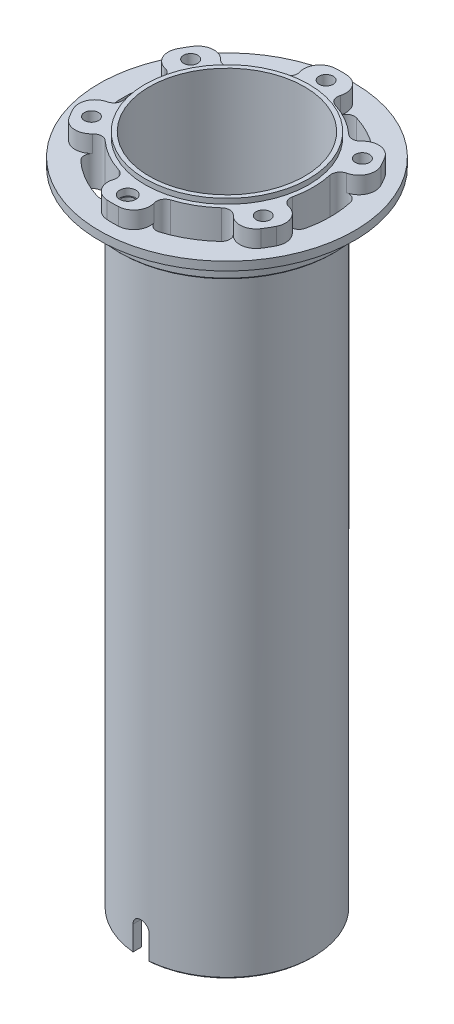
ISO-10303-21;
HEADER;
FILE_DESCRIPTION(('STEP AP214'),'2;1');
FILE_NAME('part.step','',(''),(''),'','','');
FILE_SCHEMA(('AUTOMOTIVE_DESIGN { 1 0 10303 214 1 1 1 1 }'));
ENDSEC;
DATA;
#1=APPLICATION_CONTEXT('core data for automotive mechanical design processes');
#2=APPLICATION_PROTOCOL_DEFINITION('international standard','automotive_design',2000,#1);
#3=PRODUCT_CONTEXT('',#1,'mechanical');
#4=PRODUCT('Part','Part','',(#3));
#5=PRODUCT_RELATED_PRODUCT_CATEGORY('part','',(#4));
#6=PRODUCT_DEFINITION_FORMATION('','',#4);
#7=PRODUCT_DEFINITION_CONTEXT('part definition',#1,'design');
#8=PRODUCT_DEFINITION('design','',#6,#7);
#9=PRODUCT_DEFINITION_SHAPE('','',#8);
#10=(LENGTH_UNIT() NAMED_UNIT(*) SI_UNIT(.MILLI.,.METRE.));
#11=(NAMED_UNIT(*) PLANE_ANGLE_UNIT() SI_UNIT($,.RADIAN.));
#12=(NAMED_UNIT(*) SI_UNIT($,.STERADIAN.) SOLID_ANGLE_UNIT());
#13=UNCERTAINTY_MEASURE_WITH_UNIT(LENGTH_MEASURE(1.E-05),#10,'distance_accuracy_value','');
#14=(GEOMETRIC_REPRESENTATION_CONTEXT(3) GLOBAL_UNCERTAINTY_ASSIGNED_CONTEXT((#13)) GLOBAL_UNIT_ASSIGNED_CONTEXT((#10,
#11,#12)) REPRESENTATION_CONTEXT('',''));
#15=CARTESIAN_POINT('',(0.,0.,0.));
#16=DIRECTION('',(0.,0.,1.));
#17=DIRECTION('',(1.,0.,0.));
#18=AXIS2_PLACEMENT_3D('',#15,#16,#17);
#19=CARTESIAN_POINT('',(0.,0.,0.));
#20=DIRECTION('',(0.,-1.,0.));
#21=DIRECTION('',(0.,0.,-1.));
#22=AXIS2_PLACEMENT_3D('',#19,#20,#21);
#23=CYLINDRICAL_SURFACE('',#22,22.86);
#24=CARTESIAN_POINT('',(0.,1.524,0.));
#25=DIRECTION('',(0.,-1.,0.));
#26=DIRECTION('',(0.,0.,-1.));
#27=AXIS2_PLACEMENT_3D('',#24,#25,#26);
#28=CIRCLE('',#27,22.86);
#29=CARTESIAN_POINT('',(0.,1.524,-22.86));
#30=VERTEX_POINT('',#29);
#31=EDGE_CURVE('E900',#30,#30,#28,.T.);
#32=ORIENTED_EDGE('',*,*,#31,.F.);
#33=EDGE_LOOP('',(#32));
#34=FACE_BOUND('',#33,.T.);
#35=DIRECTION('',(0.,-1.,0.));
#36=VECTOR('',#35,1.);
#37=CARTESIAN_POINT('',(-2.38125,0.,22.7356382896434));
#38=LINE('',#37,#36);
#39=CARTESIAN_POINT('',(-2.38125,-196.342,22.7356382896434));
#40=VERTEX_POINT('',#39);
#41=CARTESIAN_POINT('',(-2.38125,-189.23,22.7356382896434));
#42=VERTEX_POINT('',#41);
#43=EDGE_CURVE('E493',#40,#42,#38,.F.);
#44=ORIENTED_EDGE('',*,*,#43,.F.);
#45=CARTESIAN_POINT('',(0.,-193.96075,0.));
#46=DIRECTION('',(0.707106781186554,-0.707106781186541,0.));
#47=DIRECTION('',(-0.707106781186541,-0.707106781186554,0.));
#48=AXIS2_PLACEMENT_3D('',#45,#46,#47);
#49=ELLIPSE('',#48,32.3289220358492,22.86);
#50=CARTESIAN_POINT('',(-2.88925,-196.85,22.6766804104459));
#51=VERTEX_POINT('',#50);
#52=EDGE_CURVE('E1648',#40,#51,#49,.T.);
#53=ORIENTED_EDGE('',*,*,#52,.T.);
#54=CARTESIAN_POINT('',(0.,-196.85,0.));
#55=DIRECTION('',(0.,-1.,0.));
#56=DIRECTION('',(0.,0.,-1.));
#57=AXIS2_PLACEMENT_3D('',#54,#55,#56);
#58=CIRCLE('',#57,22.86);
#59=CARTESIAN_POINT('',(2.88925,-196.85,22.6766804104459));
#60=VERTEX_POINT('',#59);
#61=EDGE_CURVE('E905',#51,#60,#58,.T.);
#62=ORIENTED_EDGE('',*,*,#61,.T.);
#63=CARTESIAN_POINT('',(0.,-193.96075,0.));
#64=DIRECTION('',(-0.707106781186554,-0.707106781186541,0.));
#65=DIRECTION('',(0.707106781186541,-0.707106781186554,0.));
#66=AXIS2_PLACEMENT_3D('',#63,#64,#65);
#67=ELLIPSE('',#66,32.3289220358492,22.86);
#68=CARTESIAN_POINT('',(2.38125,-196.342,22.7356382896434));
#69=VERTEX_POINT('',#68);
#70=EDGE_CURVE('E1643',#60,#69,#67,.T.);
#71=ORIENTED_EDGE('',*,*,#70,.T.);
#72=DIRECTION('',(0.,-1.,0.));
#73=VECTOR('',#72,1.);
#74=CARTESIAN_POINT('',(2.38125,0.,22.7356382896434));
#75=LINE('',#74,#73);
#76=CARTESIAN_POINT('',(2.38125,-189.23,22.7356382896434));
#77=VERTEX_POINT('',#76);
#78=EDGE_CURVE('E1655',#77,#69,#75,.T.);
#79=ORIENTED_EDGE('',*,*,#78,.F.);
#80=CARTESIAN_POINT('',(-2.38124999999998,-189.23,22.7356382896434));
#81=CARTESIAN_POINT('',(-2.38125662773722,-189.163218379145,22.7356353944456));
#82=CARTESIAN_POINT('',(-2.37844072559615,-189.096440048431,22.7359324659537));
#83=CARTESIAN_POINT('',(-2.3672151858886,-188.963364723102,22.7371051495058));
#84=CARTESIAN_POINT('',(-2.35880592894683,-188.897067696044,22.737980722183));
#85=CARTESIAN_POINT('',(-2.33645533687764,-188.76548142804,22.7402879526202));
#86=CARTESIAN_POINT('',(-2.32251912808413,-188.700191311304,22.7417190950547));
#87=CARTESIAN_POINT('',(-2.28923048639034,-188.571039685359,22.7450939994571));
#88=CARTESIAN_POINT('',(-2.26987809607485,-188.507178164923,22.7470377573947));
#89=CARTESIAN_POINT('',(-2.20386311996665,-188.318365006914,22.753561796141));
#90=CARTESIAN_POINT('',(-2.14923098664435,-188.196116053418,22.7588361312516));
#91=CARTESIAN_POINT('',(-2.02036325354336,-187.962603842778,22.7706365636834));
#92=CARTESIAN_POINT('',(-1.946129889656,-187.851339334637,22.7771625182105));
#93=CARTESIAN_POINT('',(-1.77984097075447,-187.642426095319,22.7907597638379));
#94=CARTESIAN_POINT('',(-1.687725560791,-187.54482504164,22.7978328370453));
#95=CARTESIAN_POINT('',(-1.4884095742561,-187.366432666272,22.8117118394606));
#96=CARTESIAN_POINT('',(-1.38120670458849,-187.285643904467,22.8185177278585));
#97=CARTESIAN_POINT('',(-1.15446571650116,-187.143007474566,22.8311127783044));
#98=CARTESIAN_POINT('',(-1.03490031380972,-187.081202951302,22.8368996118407));
#99=CARTESIAN_POINT('',(-0.787025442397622,-186.97857060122,22.8467844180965));
#100=CARTESIAN_POINT('',(-0.658716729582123,-186.937740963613,22.8508825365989));
#101=CARTESIAN_POINT('',(-0.397485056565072,-186.878355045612,22.856915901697));
#102=CARTESIAN_POINT('',(-0.26458054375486,-186.859718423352,22.858858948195));
#103=CARTESIAN_POINT('',(0.00248637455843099,-186.844998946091,22.860389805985));
#104=CARTESIAN_POINT('',(0.136648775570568,-186.8489160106,22.8599776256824));
#105=CARTESIAN_POINT('',(0.401870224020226,-186.879128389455,22.856850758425));
#106=CARTESIAN_POINT('',(0.532939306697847,-186.905336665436,22.854145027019));
#107=CARTESIAN_POINT('',(0.788807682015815,-186.979251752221,22.8467453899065));
#108=CARTESIAN_POINT('',(0.913606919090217,-187.026958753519,22.8420514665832));
#109=CARTESIAN_POINT('',(1.15366964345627,-187.142613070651,22.8311876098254));
#110=CARTESIAN_POINT('',(1.26891431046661,-187.210599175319,22.8250148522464));
#111=CARTESIAN_POINT('',(1.48638541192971,-187.364850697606,22.8118860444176));
#112=CARTESIAN_POINT('',(1.5886120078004,-187.451115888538,22.8049300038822));
#113=CARTESIAN_POINT('',(1.77764768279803,-187.639952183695,22.7909765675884));
#114=CARTESIAN_POINT('',(1.8643833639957,-187.742596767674,22.7839791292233));
#115=CARTESIAN_POINT('',(2.01943141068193,-187.961067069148,22.7707613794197));
#116=CARTESIAN_POINT('',(2.0877381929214,-188.076896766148,22.764541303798));
#117=CARTESIAN_POINT('',(2.20398782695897,-188.318522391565,22.7535813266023));
#118=CARTESIAN_POINT('',(2.25191371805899,-188.444326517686,22.7488426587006));
#119=CARTESIAN_POINT('',(2.32586934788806,-188.702163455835,22.7414013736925));
#120=CARTESIAN_POINT('',(2.35193218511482,-188.834186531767,22.7386956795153));
#121=CARTESIAN_POINT('',(2.37156241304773,-189.010948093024,22.7366510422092));
#122=CARTESIAN_POINT('',(2.37519704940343,-189.054717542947,22.7362715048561));
#123=CARTESIAN_POINT('',(2.38003756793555,-189.142318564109,22.7357654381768));
#124=CARTESIAN_POINT('',(2.38124750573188,-189.186149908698,22.7356384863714));
#125=CARTESIAN_POINT('',(2.38125000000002,-189.23,22.7356382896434));
#126=B_SPLINE_CURVE_WITH_KNOTS('',3,(#80,#81,#82,#83,#84,#85,#86,#87,#88,#89,#90,#91,#92,#93,
#94,#95,#96,#97,#98,#99,#100,#101,#102,#103,#104,#105,#106,#107,#108,#109,#110,#111,#112,#113,
#114,#115,#116,#117,#118,#119,#120,#121,#122,#123,#124,#125),.UNSPECIFIED.,.F.,.F.,(4,2,2,2,2,2,
2,2,2,2,2,2,2,2,2,2,2,2,2,2,2,2,4),(0.,0.200278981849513,0.400544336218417,0.600624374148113,
0.800702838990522,1.20065322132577,1.60055800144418,2.00182517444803,2.40315340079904,
2.80538707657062,3.20758602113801,3.60832447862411,4.00906150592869,4.40824095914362,
4.80742394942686,5.20737542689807,5.60732194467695,6.00911589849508,6.41103144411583,
6.81328080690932,7.21492009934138,7.34663653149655,7.47813246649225),.UNSPECIFIED.);
#127=EDGE_CURVE('E455',#42,#77,#126,.T.);
#128=ORIENTED_EDGE('',*,*,#127,.F.);
#129=EDGE_LOOP('',(#44,#53,#62,#71,#79,#128));
#130=FACE_BOUND('',#129,.T.);
#131=ADVANCED_FACE('F39',(#34,#130),#23,.F.);
#132=CARTESIAN_POINT('',(-22.86,-196.85,0.));
#133=DIRECTION('',(0.,1.,0.));
#134=DIRECTION('',(0.,0.,1.));
#135=AXIS2_PLACEMENT_3D('',#132,#133,#134);
#136=PLANE('',#135);
#137=ORIENTED_EDGE('',*,*,#61,.F.);
#138=DIRECTION('',(0.,0.,1.));
#139=VECTOR('',#138,1.);
#140=CARTESIAN_POINT('',(-2.88925,-196.85,25.2881325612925));
#141=LINE('',#140,#139);
#142=CARTESIAN_POINT('',(-2.88925,-196.85,24.7237517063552));
#143=VERTEX_POINT('',#142);
#144=EDGE_CURVE('E1645',#51,#143,#141,.T.);
#145=ORIENTED_EDGE('',*,*,#144,.T.);
#146=CARTESIAN_POINT('',(0.,-196.85,0.));
#147=DIRECTION('',(0.,1.,0.));
#148=DIRECTION('',(0.,0.,1.));
#149=AXIS2_PLACEMENT_3D('',#146,#147,#148);
#150=CIRCLE('',#149,24.892);
#151=CARTESIAN_POINT('',(2.88925,-196.85,24.7237517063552));
#152=VERTEX_POINT('',#151);
#153=EDGE_CURVE('E68',#143,#152,#150,.F.);
#154=ORIENTED_EDGE('',*,*,#153,.T.);
#155=DIRECTION('',(0.,0.,-1.));
#156=VECTOR('',#155,1.);
#157=CARTESIAN_POINT('',(2.88925,-196.85,22.7356382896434));
#158=LINE('',#157,#156);
#159=EDGE_CURVE('E1642',#152,#60,#158,.T.);
#160=ORIENTED_EDGE('',*,*,#159,.T.);
#161=EDGE_LOOP('',(#137,#145,#154,#160));
#162=FACE_BOUND('',#161,.T.);
#163=ADVANCED_FACE('F500',(#162),#136,.F.);
#164=CARTESIAN_POINT('',(0.,0.,0.));
#165=DIRECTION('',(0.,-1.,0.));
#166=DIRECTION('',(0.,0.,-1.));
#167=AXIS2_PLACEMENT_3D('',#164,#165,#166);
#168=CYLINDRICAL_SURFACE('',#167,25.4);
#169=CARTESIAN_POINT('',(0.,-14.732,0.));
#170=DIRECTION('',(0.,1.,0.));
#171=DIRECTION('',(0.,0.,1.));
#172=AXIS2_PLACEMENT_3D('',#169,#170,#171);
#173=CIRCLE('',#172,25.4);
#174=CARTESIAN_POINT('',(17.1599912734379,-14.732,-18.726844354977));
#175=VERTEX_POINT('',#174);
#176=CARTESIAN_POINT('',(24.7979185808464,-14.732,-5.49756619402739));
#177=VERTEX_POINT('',#176);
#178=EDGE_CURVE('E869',#175,#177,#173,.F.);
#179=ORIENTED_EDGE('',*,*,#178,.T.);
#180=DIRECTION('',(0.,1.,0.));
#181=VECTOR('',#180,1.);
#182=CARTESIAN_POINT('',(24.7979185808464,-19.05,-5.49756619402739));
#183=LINE('',#182,#181);
#184=CARTESIAN_POINT('',(24.7979185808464,0.,-5.49756619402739));
#185=VERTEX_POINT('',#184);
#186=EDGE_CURVE('E1179',#177,#185,#183,.T.);
#187=ORIENTED_EDGE('',*,*,#186,.T.);
#188=CARTESIAN_POINT('',(0.,0.,0.));
#189=DIRECTION('',(0.,-1.,0.));
#190=DIRECTION('',(0.866025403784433,0.,0.50000000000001));
#191=AXIS2_PLACEMENT_3D('',#188,#189,#190);
#192=CIRCLE('',#191,25.4);
#193=CARTESIAN_POINT('',(24.7979185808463,0.,5.49756619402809));
#194=VERTEX_POINT('',#193);
#195=EDGE_CURVE('E1177',#185,#194,#192,.T.);
#196=ORIENTED_EDGE('',*,*,#195,.T.);
#197=DIRECTION('',(0.,1.,0.));
#198=VECTOR('',#197,1.);
#199=CARTESIAN_POINT('',(24.7979185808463,-19.05,5.49756619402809));
#200=LINE('',#199,#198);
#201=CARTESIAN_POINT('',(24.7979185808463,-14.732,5.49756619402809));
#202=VERTEX_POINT('',#201);
#203=EDGE_CURVE('E1172',#202,#194,#200,.T.);
#204=ORIENTED_EDGE('',*,*,#203,.F.);
#205=CARTESIAN_POINT('',(17.1599912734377,-14.732,18.7268443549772));
#206=VERTEX_POINT('',#205);
#207=EDGE_CURVE('E861',#202,#206,#173,.F.);
#208=ORIENTED_EDGE('',*,*,#207,.T.);
#209=DIRECTION('',(0.,1.,0.));
#210=VECTOR('',#209,1.);
#211=CARTESIAN_POINT('',(17.1599912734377,-19.05,18.7268443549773));
#212=LINE('',#211,#210);
#213=CARTESIAN_POINT('',(17.1599912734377,0.,18.7268443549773));
#214=VERTEX_POINT('',#213);
#215=EDGE_CURVE('E949',#206,#214,#212,.T.);
#216=ORIENTED_EDGE('',*,*,#215,.T.);
#217=CARTESIAN_POINT('',(0.,0.,0.));
#218=DIRECTION('',(0.,-1.,0.));
#219=DIRECTION('',(0.,0.,1.));
#220=AXIS2_PLACEMENT_3D('',#217,#218,#219);
#221=CIRCLE('',#220,25.4);
#222=CARTESIAN_POINT('',(7.63792730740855,0.,24.224410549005));
#223=VERTEX_POINT('',#222);
#224=EDGE_CURVE('E958',#214,#223,#221,.T.);
#225=ORIENTED_EDGE('',*,*,#224,.T.);
#226=DIRECTION('',(0.,1.,0.));
#227=VECTOR('',#226,1.);
#228=CARTESIAN_POINT('',(7.63792730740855,-19.05,24.224410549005));
#229=LINE('',#228,#227);
#230=CARTESIAN_POINT('',(7.63792730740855,-14.732,24.224410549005));
#231=VERTEX_POINT('',#230);
#232=EDGE_CURVE('E952',#231,#223,#229,.T.);
#233=ORIENTED_EDGE('',*,*,#232,.F.);
#234=CARTESIAN_POINT('',(-7.63792730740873,-14.732,24.2244105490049));
#235=VERTEX_POINT('',#234);
#236=EDGE_CURVE('E853',#231,#235,#173,.F.);
#237=ORIENTED_EDGE('',*,*,#236,.T.);
#238=DIRECTION('',(0.,1.,0.));
#239=VECTOR('',#238,1.);
#240=CARTESIAN_POINT('',(-7.63792730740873,-19.05,24.2244105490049));
#241=LINE('',#240,#239);
#242=CARTESIAN_POINT('',(-7.63792730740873,0.,24.2244105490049));
#243=VERTEX_POINT('',#242);
#244=EDGE_CURVE('E1054',#235,#243,#241,.T.);
#245=ORIENTED_EDGE('',*,*,#244,.T.);
#246=CARTESIAN_POINT('',(0.,0.,0.));
#247=DIRECTION('',(0.,-1.,0.));
#248=DIRECTION('',(-0.86602540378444,0.,0.499999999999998));
#249=AXIS2_PLACEMENT_3D('',#246,#247,#248);
#250=CIRCLE('',#249,25.4);
#251=CARTESIAN_POINT('',(-17.1599912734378,0.,18.7268443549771));
#252=VERTEX_POINT('',#251);
#253=EDGE_CURVE('E1063',#243,#252,#250,.T.);
#254=ORIENTED_EDGE('',*,*,#253,.T.);
#255=DIRECTION('',(0.,1.,0.));
#256=VECTOR('',#255,1.);
#257=CARTESIAN_POINT('',(-17.1599912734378,-19.05,18.7268443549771));
#258=LINE('',#257,#256);
#259=CARTESIAN_POINT('',(-17.1599912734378,-14.732,18.7268443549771));
#260=VERTEX_POINT('',#259);
#261=EDGE_CURVE('E1057',#260,#252,#258,.T.);
#262=ORIENTED_EDGE('',*,*,#261,.F.);
#263=CARTESIAN_POINT('',(-24.7979185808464,-14.732,5.49756619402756));
#264=VERTEX_POINT('',#263);
#265=EDGE_CURVE('E860',#260,#264,#173,.F.);
#266=ORIENTED_EDGE('',*,*,#265,.T.);
#267=DIRECTION('',(0.,1.,0.));
#268=VECTOR('',#267,1.);
#269=CARTESIAN_POINT('',(-24.7979185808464,-19.05,5.49756619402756));
#270=LINE('',#269,#268);
#271=CARTESIAN_POINT('',(-24.7979185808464,0.,5.49756619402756));
#272=VERTEX_POINT('',#271);
#273=EDGE_CURVE('E1082',#264,#272,#270,.T.);
#274=ORIENTED_EDGE('',*,*,#273,.T.);
#275=CARTESIAN_POINT('',(0.,0.,0.));
#276=DIRECTION('',(0.,-1.,0.));
#277=DIRECTION('',(-0.866025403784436,0.,-0.500000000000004));
#278=AXIS2_PLACEMENT_3D('',#275,#276,#277);
#279=CIRCLE('',#278,25.4);
#280=CARTESIAN_POINT('',(-24.7979185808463,0.,-5.49756619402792));
#281=VERTEX_POINT('',#280);
#282=EDGE_CURVE('E1094',#272,#281,#279,.T.);
#283=ORIENTED_EDGE('',*,*,#282,.T.);
#284=DIRECTION('',(0.,1.,0.));
#285=VECTOR('',#284,1.);
#286=CARTESIAN_POINT('',(-24.7979185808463,-19.05,-5.49756619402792));
#287=LINE('',#286,#285);
#288=CARTESIAN_POINT('',(-24.7979185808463,-14.732,-5.49756619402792));
#289=VERTEX_POINT('',#288);
#290=EDGE_CURVE('E1078',#289,#281,#287,.T.);
#291=ORIENTED_EDGE('',*,*,#290,.F.);
#292=CARTESIAN_POINT('',(-17.1599912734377,-14.732,-18.7268443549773));
#293=VERTEX_POINT('',#292);
#294=EDGE_CURVE('E867',#289,#293,#173,.F.);
#295=ORIENTED_EDGE('',*,*,#294,.T.);
#296=DIRECTION('',(0.,1.,0.));
#297=VECTOR('',#296,1.);
#298=CARTESIAN_POINT('',(-17.1599912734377,-19.05,-18.7268443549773));
#299=LINE('',#298,#297);
#300=CARTESIAN_POINT('',(-17.1599912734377,0.,-18.7268443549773));
#301=VERTEX_POINT('',#300);
#302=EDGE_CURVE('E1115',#293,#301,#299,.T.);
#303=ORIENTED_EDGE('',*,*,#302,.T.);
#304=CARTESIAN_POINT('',(0.,0.,0.));
#305=DIRECTION('',(0.,-1.,0.));
#306=DIRECTION('',(0.,0.,-1.));
#307=AXIS2_PLACEMENT_3D('',#304,#305,#306);
#308=CIRCLE('',#307,25.4);
#309=CARTESIAN_POINT('',(-7.63792730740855,0.,-24.224410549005));
#310=VERTEX_POINT('',#309);
#311=EDGE_CURVE('E1127',#301,#310,#308,.T.);
#312=ORIENTED_EDGE('',*,*,#311,.T.);
#313=DIRECTION('',(0.,1.,0.));
#314=VECTOR('',#313,1.);
#315=CARTESIAN_POINT('',(-7.63792730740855,-19.05,-24.224410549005));
#316=LINE('',#315,#314);
#317=CARTESIAN_POINT('',(-7.63792730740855,-14.732,-24.224410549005));
#318=VERTEX_POINT('',#317);
#319=EDGE_CURVE('E1111',#318,#310,#316,.T.);
#320=ORIENTED_EDGE('',*,*,#319,.F.);
#321=CARTESIAN_POINT('',(7.6379273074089,-14.732,-24.2244105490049));
#322=VERTEX_POINT('',#321);
#323=EDGE_CURVE('E876',#318,#322,#173,.F.);
#324=ORIENTED_EDGE('',*,*,#323,.T.);
#325=DIRECTION('',(0.,1.,0.));
#326=VECTOR('',#325,1.);
#327=CARTESIAN_POINT('',(7.6379273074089,-19.05,-24.2244105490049));
#328=LINE('',#327,#326);
#329=CARTESIAN_POINT('',(7.6379273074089,0.,-24.2244105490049));
#330=VERTEX_POINT('',#329);
#331=EDGE_CURVE('E1148',#322,#330,#328,.T.);
#332=ORIENTED_EDGE('',*,*,#331,.T.);
#333=CARTESIAN_POINT('',(0.,0.,0.));
#334=DIRECTION('',(0.,-1.,0.));
#335=DIRECTION('',(0.866025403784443,0.,-0.499999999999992));
#336=AXIS2_PLACEMENT_3D('',#333,#334,#335);
#337=CIRCLE('',#336,25.4);
#338=CARTESIAN_POINT('',(17.1599912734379,0.,-18.726844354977));
#339=VERTEX_POINT('',#338);
#340=EDGE_CURVE('E1160',#330,#339,#337,.T.);
#341=ORIENTED_EDGE('',*,*,#340,.T.);
#342=DIRECTION('',(0.,1.,0.));
#343=VECTOR('',#342,1.);
#344=CARTESIAN_POINT('',(17.1599912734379,-19.05,-18.726844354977));
#345=LINE('',#344,#343);
#346=EDGE_CURVE('E1144',#175,#339,#345,.T.);
#347=ORIENTED_EDGE('',*,*,#346,.F.);
#348=EDGE_LOOP('',(#179,#187,#196,#204,#208,#216,#225,#233,#237,#245,#254,#262,#266,#274,#283,
#291,#295,#303,#312,#320,#324,#332,#341,#347));
#349=FACE_BOUND('',#348,.T.);
#350=DIRECTION('',(0.,-1.,0.));
#351=VECTOR('',#350,1.);
#352=CARTESIAN_POINT('',(2.38125,0.,25.2881325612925));
#353=LINE('',#352,#351);
#354=CARTESIAN_POINT('',(2.38125,-196.342,25.2881325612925));
#355=VERTEX_POINT('',#354);
#356=CARTESIAN_POINT('',(2.38125,-189.23,25.2881325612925));
#357=VERTEX_POINT('',#356);
#358=EDGE_CURVE('E439',#355,#357,#353,.F.);
#359=ORIENTED_EDGE('',*,*,#358,.F.);
#360=CARTESIAN_POINT('',(0.,-196.342,0.));
#361=DIRECTION('',(0.,1.,0.));
#362=DIRECTION('',(0.,0.,1.));
#363=AXIS2_PLACEMENT_3D('',#360,#361,#362);
#364=CIRCLE('',#363,25.4);
#365=CARTESIAN_POINT('',(-2.38125,-196.342,25.2881325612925));
#366=VERTEX_POINT('',#365);
#367=EDGE_CURVE('E1625',#355,#366,#364,.T.);
#368=ORIENTED_EDGE('',*,*,#367,.T.);
#369=DIRECTION('',(0.,-1.,0.));
#370=VECTOR('',#369,1.);
#371=CARTESIAN_POINT('',(-2.38125,0.,25.2881325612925));
#372=LINE('',#371,#370);
#373=CARTESIAN_POINT('',(-2.38125,-189.23,25.2881325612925));
#374=VERTEX_POINT('',#373);
#375=EDGE_CURVE('E461',#374,#366,#372,.T.);
#376=ORIENTED_EDGE('',*,*,#375,.F.);
#377=CARTESIAN_POINT('',(2.38125000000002,-189.23,25.2881325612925));
#378=CARTESIAN_POINT('',(2.38125658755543,-189.163181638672,25.2881299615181));
#379=CARTESIAN_POINT('',(2.37843763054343,-189.096366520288,25.2883973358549));
#380=CARTESIAN_POINT('',(2.36719963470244,-188.963217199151,25.2894528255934));
#381=CARTESIAN_POINT('',(2.35878095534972,-188.896882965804,25.2902409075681));
#382=CARTESIAN_POINT('',(2.33640439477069,-188.765219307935,25.2923176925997));
#383=CARTESIAN_POINT('',(2.32245141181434,-188.699889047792,25.2936059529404));
#384=CARTESIAN_POINT('',(2.28912170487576,-188.570657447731,25.2966440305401));
#385=CARTESIAN_POINT('',(2.269745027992,-188.506756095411,25.2983938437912));
#386=CARTESIAN_POINT('',(2.20364433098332,-188.31782234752,25.3042672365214));
#387=CARTESIAN_POINT('',(2.14893831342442,-188.195493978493,25.3090158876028));
#388=CARTESIAN_POINT('',(2.01989022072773,-187.961839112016,25.3196407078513));
#389=CARTESIAN_POINT('',(1.94555069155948,-187.850511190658,25.3255167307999));
#390=CARTESIAN_POINT('',(1.77907591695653,-187.641566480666,25.3377555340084));
#391=CARTESIAN_POINT('',(1.68689207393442,-187.543988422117,25.3441196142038));
#392=CARTESIAN_POINT('',(1.48744292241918,-187.36565897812,25.3566061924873));
#393=CARTESIAN_POINT('',(1.38017532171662,-187.284910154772,25.3627286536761));
#394=CARTESIAN_POINT('',(1.15336925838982,-187.142403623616,25.3740543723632));
#395=CARTESIAN_POINT('',(1.03380887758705,-187.080680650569,25.3792559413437));
#396=CARTESIAN_POINT('',(0.785971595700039,-186.978205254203,25.3881390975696));
#397=CARTESIAN_POINT('',(0.657695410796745,-186.937451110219,25.3918208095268));
#398=CARTESIAN_POINT('',(0.396461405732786,-186.87818027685,25.397240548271));
#399=CARTESIAN_POINT('',(0.263518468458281,-186.859598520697,25.398984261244));
#400=CARTESIAN_POINT('',(-0.00361310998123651,-186.84499871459,25.4003508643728));
#401=CARTESIAN_POINT('',(-0.137801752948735,-186.84898069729,25.3999737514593));
#402=CARTESIAN_POINT('',(-0.403166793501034,-186.879343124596,25.3971457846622));
#403=CARTESIAN_POINT('',(-0.534351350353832,-186.905652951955,25.394701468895));
#404=CARTESIAN_POINT('',(-0.790433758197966,-186.979814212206,25.3880214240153));
#405=CARTESIAN_POINT('',(-0.91533156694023,-187.027665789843,25.3837856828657));
#406=CARTESIAN_POINT('',(-1.15552155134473,-187.143631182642,25.3739877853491));
#407=CARTESIAN_POINT('',(-1.27079828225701,-187.2117768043,25.3684235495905));
#408=CARTESIAN_POINT('',(-1.48829941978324,-187.366369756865,25.3565937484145));
#409=CARTESIAN_POINT('',(-1.59052407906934,-187.452816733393,25.350328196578));
#410=CARTESIAN_POINT('',(-1.77942515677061,-187.641942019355,25.3377714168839));
#411=CARTESIAN_POINT('',(-1.86604237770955,-187.744679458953,25.3314801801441));
#412=CARTESIAN_POINT('',(-2.0208370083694,-187.963307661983,25.3196024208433));
#413=CARTESIAN_POINT('',(-2.08900878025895,-188.079202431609,25.3140161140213));
#414=CARTESIAN_POINT('',(-2.20497404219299,-188.320914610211,25.3041793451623));
#415=CARTESIAN_POINT('',(-2.25275183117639,-188.446739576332,25.2999299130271));
#416=CARTESIAN_POINT('',(-2.32641429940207,-188.704580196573,25.2932636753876));
#417=CARTESIAN_POINT('',(-2.35233213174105,-188.836586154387,25.2908440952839));
#418=CARTESIAN_POINT('',(-2.37173686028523,-189.01292544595,25.2890267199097));
#419=CARTESIAN_POINT('',(-2.37530607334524,-189.056301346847,25.2886916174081));
#420=CARTESIAN_POINT('',(-2.38005941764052,-189.143112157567,25.2882448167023));
#421=CARTESIAN_POINT('',(-2.38124752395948,-189.186546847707,25.2881327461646));
#422=CARTESIAN_POINT('',(-2.38124999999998,-189.23,25.2881325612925));
#423=B_SPLINE_CURVE_WITH_KNOTS('',3,(#377,#378,#379,#380,#381,#382,#383,#384,#385,#386,#387,
#388,#389,#390,#391,#392,#393,#394,#395,#396,#397,#398,#399,#400,#401,#402,#403,#404,#405,#406,
#407,#408,#409,#410,#411,#412,#413,#414,#415,#416,#417,#418,#419,#420,#421,#422),.UNSPECIFIED.,
.F.,.F.,(4,2,2,2,2,2,2,2,2,2,2,2,2,2,2,2,2,2,2,2,2,2,4),(0.,0.200389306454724,0.400765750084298,
0.600965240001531,0.801162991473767,1.20135927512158,1.60150368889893,2.00275359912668,
2.40406455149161,2.80610388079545,3.20811021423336,3.6089339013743,4.00975816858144,
4.40931943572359,4.80888338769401,5.20907689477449,5.60926265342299,6.01093571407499,
6.41273140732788,6.81483588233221,7.21632941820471,7.34685367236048,7.47715984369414),.UNSPECIFIED.);
#424=EDGE_CURVE('E447',#357,#374,#423,.T.);
#425=ORIENTED_EDGE('',*,*,#424,.F.);
#426=EDGE_LOOP('',(#359,#368,#376,#425));
#427=FACE_BOUND('',#426,.T.);
#428=ADVANCED_FACE('F459',(#349,#427),#168,.T.);
#429=CARTESIAN_POINT('',(-24.12365,0.,0.));
#430=DIRECTION('',(0.,-1.,0.));
#431=DIRECTION('',(0.,0.,-1.));
#432=AXIS2_PLACEMENT_3D('',#429,#430,#431);
#433=PLANE('',#432);
#434=CARTESIAN_POINT('',(-2.02962646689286E-13,0.,29.21));
#435=DIRECTION('',(0.,1.,0.));
#436=DIRECTION('',(0.,0.,1.));
#437=AXIS2_PLACEMENT_3D('',#434,#435,#436);
#438=CIRCLE('',#437,2.38125);
#439=CARTESIAN_POINT('',(-2.02962646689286E-13,0.,31.59125));
#440=VERTEX_POINT('',#439);
#441=EDGE_CURVE('E492',#440,#440,#438,.T.);
#442=ORIENTED_EDGE('',*,*,#441,.F.);
#443=EDGE_LOOP('',(#442));
#444=FACE_BOUND('',#443,.T.);
#445=CARTESIAN_POINT('',(25.2966020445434,0.,14.6050000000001));
#446=DIRECTION('',(0.,1.,0.));
#447=DIRECTION('',(0.,0.,1.));
#448=AXIS2_PLACEMENT_3D('',#445,#446,#447);
#449=CIRCLE('',#448,2.0828);
#450=CARTESIAN_POINT('',(25.2966020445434,0.,16.6878000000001));
#451=VERTEX_POINT('',#450);
#452=EDGE_CURVE('E939',#451,#451,#449,.T.);
#453=ORIENTED_EDGE('',*,*,#452,.F.);
#454=EDGE_LOOP('',(#453));
#455=FACE_BOUND('',#454,.T.);
#456=CARTESIAN_POINT('',(0.,0.,0.));
#457=DIRECTION('',(0.,-1.,0.));
#458=DIRECTION('',(0.,0.,-1.));
#459=AXIS2_PLACEMENT_3D('',#456,#457,#458);
#460=CIRCLE('',#459,24.12365);
#461=CARTESIAN_POINT('',(0.,0.,-24.12365));
#462=VERTEX_POINT('',#461);
#463=EDGE_CURVE('E888',#462,#462,#460,.T.);
#464=ORIENTED_EDGE('',*,*,#463,.T.);
#465=EDGE_LOOP('',(#464));
#466=FACE_BOUND('',#465,.T.);
#467=CARTESIAN_POINT('',(-25.2966020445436,0.,14.6049999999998));
#468=DIRECTION('',(0.,1.,0.));
#469=DIRECTION('',(0.,0.,1.));
#470=AXIS2_PLACEMENT_3D('',#467,#468,#469);
#471=CIRCLE('',#470,2.0828);
#472=CARTESIAN_POINT('',(-25.2966020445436,0.,16.6877999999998));
#473=VERTEX_POINT('',#472);
#474=EDGE_CURVE('E1006',#473,#473,#471,.T.);
#475=ORIENTED_EDGE('',*,*,#474,.F.);
#476=EDGE_LOOP('',(#475));
#477=FACE_BOUND('',#476,.T.);
#478=CARTESIAN_POINT('',(-25.2966020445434,0.,-14.6050000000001));
#479=DIRECTION('',(0.,1.,0.));
#480=DIRECTION('',(0.,0.,1.));
#481=AXIS2_PLACEMENT_3D('',#478,#479,#480);
#482=CIRCLE('',#481,2.0828);
#483=CARTESIAN_POINT('',(-25.2966020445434,0.,-12.5222000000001));
#484=VERTEX_POINT('',#483);
#485=EDGE_CURVE('E1018',#484,#484,#482,.T.);
#486=ORIENTED_EDGE('',*,*,#485,.F.);
#487=EDGE_LOOP('',(#486));
#488=FACE_BOUND('',#487,.T.);
#489=CARTESIAN_POINT('',(4.05925293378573E-13,0.,-29.21));
#490=DIRECTION('',(0.,1.,0.));
#491=DIRECTION('',(0.,0.,1.));
#492=AXIS2_PLACEMENT_3D('',#489,#490,#491);
#493=CIRCLE('',#492,2.0828);
#494=CARTESIAN_POINT('',(4.05925293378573E-13,0.,-27.1272));
#495=VERTEX_POINT('',#494);
#496=EDGE_CURVE('E1030',#495,#495,#493,.T.);
#497=ORIENTED_EDGE('',*,*,#496,.F.);
#498=EDGE_LOOP('',(#497));
#499=FACE_BOUND('',#498,.T.);
#500=CARTESIAN_POINT('',(25.2966020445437,0.,-14.6049999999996));
#501=DIRECTION('',(0.,1.,0.));
#502=DIRECTION('',(0.,0.,1.));
#503=AXIS2_PLACEMENT_3D('',#500,#501,#502);
#504=CIRCLE('',#503,2.0828);
#505=CARTESIAN_POINT('',(25.2966020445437,0.,-12.5221999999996));
#506=VERTEX_POINT('',#505);
#507=EDGE_CURVE('E1042',#506,#506,#504,.T.);
#508=ORIENTED_EDGE('',*,*,#507,.F.);
#509=EDGE_LOOP('',(#508));
#510=FACE_BOUND('',#509,.T.);
#511=CARTESIAN_POINT('',(0.,0.,0.));
#512=DIRECTION('',(0.,-1.,0.));
#513=DIRECTION('',(0.,0.,-1.));
#514=AXIS2_PLACEMENT_3D('',#511,#512,#513);
#515=CIRCLE('',#514,33.655);
#516=CARTESIAN_POINT('',(29.9416920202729,0.,15.3673063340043));
#517=VERTEX_POINT('',#516);
#518=CARTESIAN_POINT('',(28.2793236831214,0.,18.2466127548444));
#519=VERTEX_POINT('',#518);
#520=EDGE_CURVE('E879',#517,#519,#515,.T.);
#521=ORIENTED_EDGE('',*,*,#520,.F.);
#522=CARTESIAN_POINT('',(25.6947489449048,0.,13.1876006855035));
#523=DIRECTION('',(0.,-1.,0.));
#524=DIRECTION('',(-0.866025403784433,0.,-0.50000000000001));
#525=AXIS2_PLACEMENT_3D('',#522,#523,#524);
#526=CIRCLE('',#525,4.7736403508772);
#527=CARTESIAN_POINT('',(26.7279538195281,0.,8.52711467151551));
#528=VERTEX_POINT('',#527);
#529=EDGE_CURVE('E1308',#528,#517,#526,.T.);
#530=ORIENTED_EDGE('',*,*,#529,.F.);
#531=CARTESIAN_POINT('',(27.2777104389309,0.,6.0473228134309));
#532=DIRECTION('',(0.,1.,0.));
#533=DIRECTION('',(0.866025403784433,0.,0.50000000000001));
#534=AXIS2_PLACEMENT_3D('',#531,#532,#533);
#535=CIRCLE('',#534,2.54);
#536=EDGE_CURVE('E1184',#194,#528,#535,.T.);
#537=ORIENTED_EDGE('',*,*,#536,.F.);
#538=ORIENTED_EDGE('',*,*,#195,.F.);
#539=CARTESIAN_POINT('',(27.2777104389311,0.,-6.04732281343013));
#540=DIRECTION('',(0.,1.,0.));
#541=DIRECTION('',(0.866025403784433,0.,0.50000000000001));
#542=AXIS2_PLACEMENT_3D('',#539,#540,#541);
#543=CIRCLE('',#542,2.54);
#544=CARTESIAN_POINT('',(26.7279538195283,0.,-8.52711467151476));
#545=VERTEX_POINT('',#544);
#546=EDGE_CURVE('E1187',#545,#185,#543,.T.);
#547=ORIENTED_EDGE('',*,*,#546,.F.);
#548=CARTESIAN_POINT('',(25.6947489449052,0.,-13.1876006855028));
#549=DIRECTION('',(0.,-1.,0.));
#550=DIRECTION('',(0.866025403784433,0.,0.50000000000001));
#551=AXIS2_PLACEMENT_3D('',#548,#549,#550);
#552=CIRCLE('',#551,4.77364035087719);
#553=CARTESIAN_POINT('',(29.9416920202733,0.,-15.3673063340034));
#554=VERTEX_POINT('',#553);
#555=EDGE_CURVE('E1307',#554,#545,#552,.T.);
#556=ORIENTED_EDGE('',*,*,#555,.F.);
#557=CARTESIAN_POINT('',(28.2793236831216,0.,-18.246612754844));
#558=VERTEX_POINT('',#557);
#559=EDGE_CURVE('E887',#558,#554,#515,.T.);
#560=ORIENTED_EDGE('',*,*,#559,.F.);
#561=CARTESIAN_POINT('',(24.2681716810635,0.,-15.6585049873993));
#562=DIRECTION('',(0.,-1.,0.));
#563=DIRECTION('',(-0.866025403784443,0.,0.499999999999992));
#564=AXIS2_PLACEMENT_3D('',#561,#562,#563);
#565=CIRCLE('',#564,4.7736403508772);
#566=CARTESIAN_POINT('',(20.7486748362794,0.,-18.8835296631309));
#567=VERTEX_POINT('',#566);
#568=EDGE_CURVE('E1283',#567,#558,#565,.T.);
#569=ORIENTED_EDGE('',*,*,#568,.F.);
#570=CARTESIAN_POINT('',(18.8759904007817,0.,-20.5995287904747));
#571=DIRECTION('',(0.,1.,0.));
#572=DIRECTION('',(0.866025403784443,0.,-0.499999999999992));
#573=AXIS2_PLACEMENT_3D('',#570,#571,#572);
#574=CIRCLE('',#573,2.54);
#575=EDGE_CURVE('E1151',#339,#567,#574,.T.);
#576=ORIENTED_EDGE('',*,*,#575,.F.);
#577=ORIENTED_EDGE('',*,*,#340,.F.);
#578=CARTESIAN_POINT('',(8.40172003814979,0.,-26.6468516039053));
#579=DIRECTION('',(0.,1.,0.));
#580=DIRECTION('',(0.866025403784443,0.,-0.499999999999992));
#581=AXIS2_PLACEMENT_3D('',#578,#579,#580);
#582=CIRCLE('',#581,2.54);
#583=CARTESIAN_POINT('',(5.9792789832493,0.,-27.4106443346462));
#584=VERTEX_POINT('',#583);
#585=EDGE_CURVE('E1164',#584,#330,#582,.T.);
#586=ORIENTED_EDGE('',*,*,#585,.F.);
#587=CARTESIAN_POINT('',(1.42657726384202,0.,-28.8461056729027));
#588=DIRECTION('',(0.,-1.,0.));
#589=DIRECTION('',(0.866025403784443,0.,-0.499999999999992));
#590=AXIS2_PLACEMENT_3D('',#587,#588,#589);
#591=CIRCLE('',#590,4.77364035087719);
#592=CARTESIAN_POINT('',(1.66236833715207,0.,-33.6139190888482));
#593=VERTEX_POINT('',#592);
#594=EDGE_CURVE('E1282',#593,#584,#591,.T.);
#595=ORIENTED_EDGE('',*,*,#594,.F.);
#596=CARTESIAN_POINT('',(-1.6623683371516,0.,-33.6139190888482));
#597=VERTEX_POINT('',#596);
#598=EDGE_CURVE('E894',#597,#593,#515,.T.);
#599=ORIENTED_EDGE('',*,*,#598,.F.);
#600=CARTESIAN_POINT('',(-1.42657726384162,0.,-28.8461056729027));
#601=DIRECTION('',(0.,-1.,0.));
#602=DIRECTION('',(0.,0.,1.));
#603=AXIS2_PLACEMENT_3D('',#600,#601,#602);
#604=CIRCLE('',#603,4.7736403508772);
#605=CARTESIAN_POINT('',(-5.97927898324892,0.,-27.4106443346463));
#606=VERTEX_POINT('',#605);
#607=EDGE_CURVE('E1259',#606,#597,#604,.T.);
#608=ORIENTED_EDGE('',*,*,#607,.F.);
#609=CARTESIAN_POINT('',(-8.40172003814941,0.,-26.6468516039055));
#610=DIRECTION('',(0.,1.,0.));
#611=DIRECTION('',(0.,0.,-1.));
#612=AXIS2_PLACEMENT_3D('',#609,#610,#611);
#613=CIRCLE('',#612,2.54);
#614=EDGE_CURVE('E1118',#310,#606,#613,.T.);
#615=ORIENTED_EDGE('',*,*,#614,.F.);
#616=ORIENTED_EDGE('',*,*,#311,.F.);
#617=CARTESIAN_POINT('',(-18.8759904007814,0.,-20.599528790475));
#618=DIRECTION('',(0.,1.,0.));
#619=DIRECTION('',(0.,0.,-1.));
#620=AXIS2_PLACEMENT_3D('',#617,#618,#619);
#621=CIRCLE('',#620,2.54);
#622=CARTESIAN_POINT('',(-20.7486748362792,0.,-18.8835296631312));
#623=VERTEX_POINT('',#622);
#624=EDGE_CURVE('E1131',#623,#301,#621,.T.);
#625=ORIENTED_EDGE('',*,*,#624,.F.);
#626=CARTESIAN_POINT('',(-24.2681716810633,0.,-15.6585049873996));
#627=DIRECTION('',(0.,-1.,0.));
#628=DIRECTION('',(0.,0.,-1.));
#629=AXIS2_PLACEMENT_3D('',#626,#627,#628);
#630=CIRCLE('',#629,4.77364035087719);
#631=CARTESIAN_POINT('',(-28.2793236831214,0.,-18.2466127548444));
#632=VERTEX_POINT('',#631);
#633=EDGE_CURVE('E1258',#632,#623,#630,.T.);
#634=ORIENTED_EDGE('',*,*,#633,.F.);
#635=CARTESIAN_POINT('',(-29.941692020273,0.,-15.3673063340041));
#636=VERTEX_POINT('',#635);
#637=EDGE_CURVE('E885',#636,#632,#515,.T.);
#638=ORIENTED_EDGE('',*,*,#637,.F.);
#639=CARTESIAN_POINT('',(-25.6947489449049,0.,-13.1876006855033));
#640=DIRECTION('',(0.,-1.,0.));
#641=DIRECTION('',(0.866025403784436,0.,0.500000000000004));
#642=AXIS2_PLACEMENT_3D('',#639,#640,#641);
#643=CIRCLE('',#642,4.7736403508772);
#644=CARTESIAN_POINT('',(-26.7279538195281,0.,-8.52711467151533));
#645=VERTEX_POINT('',#644);
#646=EDGE_CURVE('E1235',#645,#636,#643,.T.);
#647=ORIENTED_EDGE('',*,*,#646,.F.);
#648=CARTESIAN_POINT('',(-27.2777104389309,0.,-6.0473228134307));
#649=DIRECTION('',(0.,1.,0.));
#650=DIRECTION('',(-0.866025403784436,0.,-0.500000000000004));
#651=AXIS2_PLACEMENT_3D('',#648,#649,#650);
#652=CIRCLE('',#651,2.54);
#653=EDGE_CURVE('E1085',#281,#645,#652,.T.);
#654=ORIENTED_EDGE('',*,*,#653,.F.);
#655=ORIENTED_EDGE('',*,*,#282,.F.);
#656=CARTESIAN_POINT('',(-27.277710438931,0.,6.04732281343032));
#657=DIRECTION('',(0.,1.,0.));
#658=DIRECTION('',(-0.866025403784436,0.,-0.500000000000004));
#659=AXIS2_PLACEMENT_3D('',#656,#657,#658);
#660=CIRCLE('',#659,2.54);
#661=CARTESIAN_POINT('',(-26.7279538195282,0.,8.52711467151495));
#662=VERTEX_POINT('',#661);
#663=EDGE_CURVE('E1098',#662,#272,#660,.T.);
#664=ORIENTED_EDGE('',*,*,#663,.F.);
#665=CARTESIAN_POINT('',(-25.6947489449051,0.,13.187600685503));
#666=DIRECTION('',(0.,-1.,0.));
#667=DIRECTION('',(-0.866025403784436,0.,-0.500000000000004));
#668=AXIS2_PLACEMENT_3D('',#665,#666,#667);
#669=CIRCLE('',#668,4.77364035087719);
#670=CARTESIAN_POINT('',(-29.9416920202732,0.,15.3673063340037));
#671=VERTEX_POINT('',#670);
#672=EDGE_CURVE('E1234',#671,#662,#669,.T.);
#673=ORIENTED_EDGE('',*,*,#672,.F.);
#674=CARTESIAN_POINT('',(-28.2793236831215,0.,18.2466127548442));
#675=VERTEX_POINT('',#674);
#676=EDGE_CURVE('E878',#675,#671,#515,.T.);
#677=ORIENTED_EDGE('',*,*,#676,.F.);
#678=CARTESIAN_POINT('',(-24.2681716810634,0.,15.6585049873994));
#679=DIRECTION('',(0.,-1.,0.));
#680=DIRECTION('',(0.86602540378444,0.,-0.499999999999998));
#681=AXIS2_PLACEMENT_3D('',#678,#679,#680);
#682=CIRCLE('',#681,4.7736403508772);
#683=CARTESIAN_POINT('',(-20.7486748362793,0.,18.8835296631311));
#684=VERTEX_POINT('',#683);
#685=EDGE_CURVE('E1211',#684,#675,#682,.T.);
#686=ORIENTED_EDGE('',*,*,#685,.F.);
#687=CARTESIAN_POINT('',(-18.8759904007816,0.,20.5995287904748));
#688=DIRECTION('',(0.,1.,0.));
#689=DIRECTION('',(-0.86602540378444,0.,0.499999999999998));
#690=AXIS2_PLACEMENT_3D('',#687,#688,#689);
#691=CIRCLE('',#690,2.54);
#692=EDGE_CURVE('E1055',#252,#684,#691,.T.);
#693=ORIENTED_EDGE('',*,*,#692,.F.);
#694=ORIENTED_EDGE('',*,*,#253,.F.);
#695=CARTESIAN_POINT('',(-8.4017200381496,0.,26.6468516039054));
#696=DIRECTION('',(0.,1.,0.));
#697=DIRECTION('',(-0.86602540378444,0.,0.499999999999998));
#698=AXIS2_PLACEMENT_3D('',#695,#696,#697);
#699=CIRCLE('',#698,2.54);
#700=CARTESIAN_POINT('',(-5.97927898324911,0.,27.4106443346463));
#701=VERTEX_POINT('',#700);
#702=EDGE_CURVE('E1065',#701,#243,#699,.T.);
#703=ORIENTED_EDGE('',*,*,#702,.F.);
#704=CARTESIAN_POINT('',(-1.42657726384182,0.,28.8461056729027));
#705=DIRECTION('',(0.,-1.,0.));
#706=DIRECTION('',(-0.86602540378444,0.,0.499999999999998));
#707=AXIS2_PLACEMENT_3D('',#704,#705,#706);
#708=CIRCLE('',#707,4.77364035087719);
#709=CARTESIAN_POINT('',(-1.66236833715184,0.,33.6139190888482));
#710=VERTEX_POINT('',#709);
#711=EDGE_CURVE('E1210',#710,#701,#708,.T.);
#712=ORIENTED_EDGE('',*,*,#711,.F.);
#713=CARTESIAN_POINT('',(1.6623683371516,0.,33.6139190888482));
#714=VERTEX_POINT('',#713);
#715=EDGE_CURVE('E870',#714,#710,#515,.T.);
#716=ORIENTED_EDGE('',*,*,#715,.F.);
#717=CARTESIAN_POINT('',(1.42657726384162,0.,28.8461056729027));
#718=DIRECTION('',(0.,-1.,0.));
#719=DIRECTION('',(0.,0.,-1.));
#720=AXIS2_PLACEMENT_3D('',#717,#718,#719);
#721=CIRCLE('',#720,4.7736403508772);
#722=CARTESIAN_POINT('',(5.97927898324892,0.,27.4106443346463));
#723=VERTEX_POINT('',#722);
#724=EDGE_CURVE('E985',#723,#714,#721,.T.);
#725=ORIENTED_EDGE('',*,*,#724,.F.);
#726=CARTESIAN_POINT('',(8.40172003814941,0.,26.6468516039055));
#727=DIRECTION('',(0.,1.,0.));
#728=DIRECTION('',(0.,0.,1.));
#729=AXIS2_PLACEMENT_3D('',#726,#727,#728);
#730=CIRCLE('',#729,2.54);
#731=EDGE_CURVE('E950',#223,#723,#730,.T.);
#732=ORIENTED_EDGE('',*,*,#731,.F.);
#733=ORIENTED_EDGE('',*,*,#224,.F.);
#734=CARTESIAN_POINT('',(18.8759904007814,0.,20.599528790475));
#735=DIRECTION('',(0.,1.,0.));
#736=DIRECTION('',(0.,0.,1.));
#737=AXIS2_PLACEMENT_3D('',#734,#735,#736);
#738=CIRCLE('',#737,2.54);
#739=CARTESIAN_POINT('',(20.7486748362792,0.,18.8835296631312));
#740=VERTEX_POINT('',#739);
#741=EDGE_CURVE('E961',#740,#214,#738,.T.);
#742=ORIENTED_EDGE('',*,*,#741,.F.);
#743=CARTESIAN_POINT('',(24.2681716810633,0.,15.6585049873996));
#744=DIRECTION('',(0.,-1.,0.));
#745=DIRECTION('',(0.,0.,1.));
#746=AXIS2_PLACEMENT_3D('',#743,#744,#745);
#747=CIRCLE('',#746,4.77364035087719);
#748=EDGE_CURVE('E984',#519,#740,#747,.T.);
#749=ORIENTED_EDGE('',*,*,#748,.F.);
#750=EDGE_LOOP('',(#521,#530,#537,#538,#547,#556,#560,#569,#576,#577,#586,#595,#599,#608,#615,
#616,#625,#634,#638,#647,#654,#655,#664,#673,#677,#686,#693,#694,#703,#712,#716,#725,#732,#733,
#742,#749));
#751=FACE_BOUND('',#750,.T.);
#752=ADVANCED_FACE('F512',(#444,#455,#466,#477,#488,#499,#510,#751),#433,.F.);
#753=CARTESIAN_POINT('',(0.,0.,0.));
#754=DIRECTION('',(0.,-1.,0.));
#755=DIRECTION('',(0.,0.,-1.));
#756=AXIS2_PLACEMENT_3D('',#753,#754,#755);
#757=CYLINDRICAL_SURFACE('',#756,33.655);
#758=DIRECTION('',(0.,1.,0.));
#759=VECTOR('',#758,1.);
#760=CARTESIAN_POINT('',(29.9416920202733,-36.5055611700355,-15.3673063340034));
#761=LINE('',#760,#759);
#762=CARTESIAN_POINT('',(29.9416920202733,-5.,-15.3673063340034));
#763=VERTEX_POINT('',#762);
#764=EDGE_CURVE('E1297',#763,#554,#761,.T.);
#765=ORIENTED_EDGE('',*,*,#764,.F.);
#766=CARTESIAN_POINT('',(0.,-5.,0.));
#767=DIRECTION('',(0.,-1.,0.));
#768=DIRECTION('',(0.,0.,-1.));
#769=AXIS2_PLACEMENT_3D('',#766,#767,#768);
#770=CIRCLE('',#769,33.655);
#771=CARTESIAN_POINT('',(28.2793236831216,-5.,-18.246612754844));
#772=VERTEX_POINT('',#771);
#773=EDGE_CURVE('E1407',#772,#763,#770,.T.);
#774=ORIENTED_EDGE('',*,*,#773,.F.);
#775=DIRECTION('',(0.,1.,0.));
#776=VECTOR('',#775,1.);
#777=CARTESIAN_POINT('',(28.2793236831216,-35.7346126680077,-18.246612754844));
#778=LINE('',#777,#776);
#779=EDGE_CURVE('E1270',#772,#558,#778,.T.);
#780=ORIENTED_EDGE('',*,*,#779,.T.);
#781=ORIENTED_EDGE('',*,*,#559,.T.);
#782=EDGE_LOOP('',(#765,#774,#780,#781));
#783=FACE_BOUND('',#782,.T.);
#784=ADVANCED_FACE('F515',(#783),#757,.T.);
#785=DIRECTION('',(0.,1.,0.));
#786=VECTOR('',#785,1.);
#787=CARTESIAN_POINT('',(1.66236833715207,-35.7346126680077,-33.6139190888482));
#788=LINE('',#787,#786);
#789=CARTESIAN_POINT('',(1.66236833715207,-5.,-33.6139190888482));
#790=VERTEX_POINT('',#789);
#791=EDGE_CURVE('E1273',#790,#593,#788,.T.);
#792=ORIENTED_EDGE('',*,*,#791,.F.);
#793=CARTESIAN_POINT('',(-1.6623683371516,-5.,-33.6139190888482));
#794=VERTEX_POINT('',#793);
#795=EDGE_CURVE('E1404',#794,#790,#770,.T.);
#796=ORIENTED_EDGE('',*,*,#795,.F.);
#797=DIRECTION('',(0.,1.,0.));
#798=VECTOR('',#797,1.);
#799=CARTESIAN_POINT('',(-1.6623683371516,-35.7346126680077,-33.6139190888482));
#800=LINE('',#799,#798);
#801=EDGE_CURVE('E1246',#794,#597,#800,.T.);
#802=ORIENTED_EDGE('',*,*,#801,.T.);
#803=ORIENTED_EDGE('',*,*,#598,.T.);
#804=EDGE_LOOP('',(#792,#796,#802,#803));
#805=FACE_BOUND('',#804,.T.);
#806=ADVANCED_FACE('F1873',(#805),#757,.T.);
#807=DIRECTION('',(0.,1.,0.));
#808=VECTOR('',#807,1.);
#809=CARTESIAN_POINT('',(-28.2793236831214,-35.7346126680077,-18.2466127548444));
#810=LINE('',#809,#808);
#811=CARTESIAN_POINT('',(-28.2793236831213,-5.,-18.2466127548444));
#812=VERTEX_POINT('',#811);
#813=EDGE_CURVE('E1249',#812,#632,#810,.T.);
#814=ORIENTED_EDGE('',*,*,#813,.F.);
#815=CARTESIAN_POINT('',(-29.941692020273,-5.,-15.3673063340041));
#816=VERTEX_POINT('',#815);
#817=EDGE_CURVE('E1402',#816,#812,#770,.T.);
#818=ORIENTED_EDGE('',*,*,#817,.F.);
#819=DIRECTION('',(0.,1.,0.));
#820=VECTOR('',#819,1.);
#821=CARTESIAN_POINT('',(-29.941692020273,-36.5055611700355,-15.3673063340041));
#822=LINE('',#821,#820);
#823=EDGE_CURVE('E1222',#816,#636,#822,.T.);
#824=ORIENTED_EDGE('',*,*,#823,.T.);
#825=ORIENTED_EDGE('',*,*,#637,.T.);
#826=EDGE_LOOP('',(#814,#818,#824,#825));
#827=FACE_BOUND('',#826,.T.);
#828=ADVANCED_FACE('F1866',(#827),#757,.T.);
#829=DIRECTION('',(0.,1.,0.));
#830=VECTOR('',#829,1.);
#831=CARTESIAN_POINT('',(-29.9416920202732,-36.5055611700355,15.3673063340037));
#832=LINE('',#831,#830);
#833=CARTESIAN_POINT('',(-29.9416920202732,-5.,15.3673063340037));
#834=VERTEX_POINT('',#833);
#835=EDGE_CURVE('E1225',#834,#671,#832,.T.);
#836=ORIENTED_EDGE('',*,*,#835,.F.);
#837=CARTESIAN_POINT('',(-28.2793236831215,-5.,18.2466127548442));
#838=VERTEX_POINT('',#837);
#839=EDGE_CURVE('E928',#838,#834,#770,.T.);
#840=ORIENTED_EDGE('',*,*,#839,.F.);
#841=DIRECTION('',(0.,1.,0.));
#842=VECTOR('',#841,1.);
#843=CARTESIAN_POINT('',(-28.2793236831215,-35.7346126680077,18.2466127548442));
#844=LINE('',#843,#842);
#845=EDGE_CURVE('E1198',#838,#675,#844,.T.);
#846=ORIENTED_EDGE('',*,*,#845,.T.);
#847=ORIENTED_EDGE('',*,*,#676,.T.);
#848=EDGE_LOOP('',(#836,#840,#846,#847));
#849=FACE_BOUND('',#848,.T.);
#850=ADVANCED_FACE('F1399',(#849),#757,.T.);
#851=DIRECTION('',(0.,1.,0.));
#852=VECTOR('',#851,1.);
#853=CARTESIAN_POINT('',(-1.66236833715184,-35.7346126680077,33.6139190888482));
#854=LINE('',#853,#852);
#855=CARTESIAN_POINT('',(-1.66236833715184,-5.,33.6139190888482));
#856=VERTEX_POINT('',#855);
#857=EDGE_CURVE('E1201',#856,#710,#854,.T.);
#858=ORIENTED_EDGE('',*,*,#857,.F.);
#859=CARTESIAN_POINT('',(1.6623683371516,-5.,33.6139190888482));
#860=VERTEX_POINT('',#859);
#861=EDGE_CURVE('E925',#860,#856,#770,.T.);
#862=ORIENTED_EDGE('',*,*,#861,.F.);
#863=DIRECTION('',(0.,1.,0.));
#864=VECTOR('',#863,1.);
#865=CARTESIAN_POINT('',(1.6623683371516,-35.7346126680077,33.6139190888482));
#866=LINE('',#865,#864);
#867=EDGE_CURVE('E972',#860,#714,#866,.T.);
#868=ORIENTED_EDGE('',*,*,#867,.T.);
#869=ORIENTED_EDGE('',*,*,#715,.T.);
#870=EDGE_LOOP('',(#858,#862,#868,#869));
#871=FACE_BOUND('',#870,.T.);
#872=ADVANCED_FACE('F521',(#871),#757,.T.);
#873=CARTESIAN_POINT('',(0.,-14.732,0.));
#874=DIRECTION('',(0.,1.,0.));
#875=DIRECTION('',(0.,0.,1.));
#876=AXIS2_PLACEMENT_3D('',#873,#874,#875);
#877=TOROIDAL_SURFACE('',#876,26.162,0.762);
#878=ORIENTED_EDGE('',*,*,#207,.F.);
#879=CARTESIAN_POINT('',(24.7979185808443,-14.732,5.49756619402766));
#880=CARTESIAN_POINT('',(24.7973173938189,-14.7304043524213,5.50027804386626));
#881=CARTESIAN_POINT('',(24.7967206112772,-14.7288086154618,5.50299100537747));
#882=CARTESIAN_POINT('',(24.7625940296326,-14.6368745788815,5.65934807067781));
#883=CARTESIAN_POINT('',(24.7431888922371,-14.5463247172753,5.8165316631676));
#884=CARTESIAN_POINT('',(24.7364676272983,-14.4164304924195,6.05594544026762));
#885=CARTESIAN_POINT('',(24.7379736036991,-14.3740735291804,6.13645536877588));
#886=CARTESIAN_POINT('',(24.7488608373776,-14.2925481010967,6.29853060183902));
#887=CARTESIAN_POINT('',(24.7582349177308,-14.253376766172,6.38009487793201));
#888=CARTESIAN_POINT('',(24.7864988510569,-14.1766507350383,6.55089068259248));
#889=CARTESIAN_POINT('',(24.8061222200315,-14.139508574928,6.64019048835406));
#890=CARTESIAN_POINT('',(24.8559619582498,-14.0735253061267,6.81888031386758));
#891=CARTESIAN_POINT('',(24.8861592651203,-14.0446694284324,6.90826988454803));
#892=CARTESIAN_POINT('',(24.9493520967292,-14.0044863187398,7.06503207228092));
#893=CARTESIAN_POINT('',(24.9800481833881,-13.9906395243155,7.13267236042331));
#894=CARTESIAN_POINT('',(25.0479261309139,-13.9726091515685,7.26601921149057));
#895=CARTESIAN_POINT('',(25.0850981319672,-13.9684110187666,7.33172853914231));
#896=CARTESIAN_POINT('',(25.154212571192,-13.9721066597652,7.44209526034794));
#897=CARTESIAN_POINT('',(25.1848635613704,-13.9770459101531,7.4876526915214));
#898=CARTESIAN_POINT('',(25.248248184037,-13.9949426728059,7.57565719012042));
#899=CARTESIAN_POINT('',(25.280979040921,-14.0078896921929,7.61810824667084));
#900=CARTESIAN_POINT('',(25.3416948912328,-14.0399836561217,7.69211968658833));
#901=CARTESIAN_POINT('',(25.3695911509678,-14.0577889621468,7.72433096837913));
#902=CARTESIAN_POINT('',(25.4245763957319,-14.1000376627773,7.78489711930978));
#903=CARTESIAN_POINT('',(25.4516656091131,-14.1244791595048,7.81325308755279));
#904=CARTESIAN_POINT('',(25.503697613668,-14.1799909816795,7.86552213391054));
#905=CARTESIAN_POINT('',(25.528628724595,-14.2110945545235,7.88941175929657));
#906=CARTESIAN_POINT('',(25.5746249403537,-14.2791735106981,7.93202089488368));
#907=CARTESIAN_POINT('',(25.5956907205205,-14.3161478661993,7.95074130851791));
#908=CARTESIAN_POINT('',(25.6308161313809,-14.3910563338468,7.98118671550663));
#909=CARTESIAN_POINT('',(25.6453496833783,-14.4285696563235,7.99340555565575));
#910=CARTESIAN_POINT('',(25.6693064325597,-14.5063281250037,8.01325282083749));
#911=CARTESIAN_POINT('',(25.6787345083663,-14.5465706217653,8.02088562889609));
#912=CARTESIAN_POINT('',(25.6892069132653,-14.6113292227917,8.02931166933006));
#913=CARTESIAN_POINT('',(25.692108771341,-14.6353718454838,8.03163060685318));
#914=CARTESIAN_POINT('',(25.6959790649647,-14.683672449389,8.03471508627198));
#915=CARTESIAN_POINT('',(25.6969505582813,-14.7079300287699,8.03548308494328));
#916=CARTESIAN_POINT('',(25.6969419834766,-14.7322,8.03548052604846));
#917=B_SPLINE_CURVE_WITH_KNOTS('',3,(#879,#880,#881,#882,#883,#884,#885,#886,#887,#888,#889,
#890,#891,#892,#893,#894,#895,#896,#897,#898,#899,#900,#901,#902,#903,#904,#905,#906,#907,#908,
#909,#910,#911,#912,#913,#914,#915,#916),.UNSPECIFIED.,.F.,.F.,(4,2,2,2,2,2,2,2,2,2,2,2,2,2,2,2,
2,2,4),(0.,0.00961060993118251,0.553666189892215,0.826350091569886,1.0987855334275,
1.39411703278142,1.68891883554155,1.91489088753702,2.14052184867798,2.30532997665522,
2.46992260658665,2.60789131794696,2.74582061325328,2.88445499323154,3.02306512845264,
3.14857830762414,3.27397133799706,3.34683983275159,3.41959280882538),.UNSPECIFIED.);
#918=CARTESIAN_POINT('',(25.104676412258,-13.97,7.36243616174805));
#919=VERTEX_POINT('',#918);
#920=EDGE_CURVE('E622',#202,#919,#917,.T.);
#921=ORIENTED_EDGE('',*,*,#920,.T.);
#922=CARTESIAN_POINT('',(0.,-13.97,0.));
#923=DIRECTION('',(0.,1.,0.));
#924=DIRECTION('',(0.,0.,1.));
#925=AXIS2_PLACEMENT_3D('',#922,#923,#924);
#926=CIRCLE('',#925,26.162);
#927=CARTESIAN_POINT('',(18.9283949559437,-13.97,18.0600694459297));
#928=VERTEX_POINT('',#927);
#929=EDGE_CURVE('E840',#928,#919,#926,.T.);
#930=ORIENTED_EDGE('',*,*,#929,.F.);
#931=CARTESIAN_POINT('',(19.8074012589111,-14.7322,18.2364642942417));
#932=CARTESIAN_POINT('',(19.8074373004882,-14.6920017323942,18.2365078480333));
#933=CARTESIAN_POINT('',(19.8042523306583,-14.6518159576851,18.2352235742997));
#934=CARTESIAN_POINT('',(19.7916270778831,-14.5726425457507,18.2302901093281));
#935=CARTESIAN_POINT('',(19.782195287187,-14.5336533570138,18.2266441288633));
#936=CARTESIAN_POINT('',(19.7572572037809,-14.4579158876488,18.217274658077));
#937=CARTESIAN_POINT('',(19.741748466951,-14.4211685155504,18.2115503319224));
#938=CARTESIAN_POINT('',(19.7050437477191,-14.3509467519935,18.1985601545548));
#939=CARTESIAN_POINT('',(19.6838488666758,-14.3174717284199,18.1912946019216));
#940=CARTESIAN_POINT('',(19.6361335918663,-14.2543689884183,18.1758098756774));
#941=CARTESIAN_POINT('',(19.6095708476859,-14.2247751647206,18.1675833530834));
#942=CARTESIAN_POINT('',(19.5519883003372,-14.170368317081,18.1509528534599));
#943=CARTESIAN_POINT('',(19.5209674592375,-14.1455564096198,18.1425488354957));
#944=CARTESIAN_POINT('',(19.4538066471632,-14.0999764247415,18.1258719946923));
#945=CARTESIAN_POINT('',(19.4174942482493,-14.0794542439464,18.1176240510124));
#946=CARTESIAN_POINT('',(19.3420193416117,-14.0439906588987,18.1023495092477));
#947=CARTESIAN_POINT('',(19.3028556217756,-14.0290516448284,18.0953234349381));
#948=CARTESIAN_POINT('',(19.2078828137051,-13.9999363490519,18.0806970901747));
#949=CARTESIAN_POINT('',(19.1512509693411,-13.9880629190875,18.0738366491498));
#950=CARTESIAN_POINT('',(19.0365265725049,-13.9729321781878,18.0639482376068));
#951=CARTESIAN_POINT('',(18.9784315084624,-13.9696908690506,18.060927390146));
#952=CARTESIAN_POINT('',(18.8397141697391,-13.9704842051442,18.0585122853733));
#953=CARTESIAN_POINT('',(18.7590858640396,-13.9778249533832,18.0609769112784));
#954=CARTESIAN_POINT('',(18.6000504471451,-14.0026969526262,18.0732930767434));
#955=CARTESIAN_POINT('',(18.5216476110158,-14.0202465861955,18.0831579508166));
#956=CARTESIAN_POINT('',(18.328168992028,-14.0737969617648,18.1164867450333));
#957=CARTESIAN_POINT('',(18.2152084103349,-14.1146467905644,18.1443535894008));
#958=CARTESIAN_POINT('',(17.9979717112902,-14.2067830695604,18.2133722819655));
#959=CARTESIAN_POINT('',(17.893715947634,-14.2580930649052,18.2545542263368));
#960=CARTESIAN_POINT('',(17.6769430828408,-14.3762581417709,18.3566285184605));
#961=CARTESIAN_POINT('',(17.5660919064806,-14.4442688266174,18.4196932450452));
#962=CARTESIAN_POINT('',(17.3567986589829,-14.5839436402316,18.5600458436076));
#963=CARTESIAN_POINT('',(17.2583317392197,-14.6556000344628,18.6373044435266));
#964=CARTESIAN_POINT('',(17.1640903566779,-14.7288085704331,18.7230944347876));
#965=CARTESIAN_POINT('',(17.1620392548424,-14.7304043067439,18.7249677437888));
#966=CARTESIAN_POINT('',(17.1599912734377,-14.732,18.7268443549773));
#967=B_SPLINE_CURVE_WITH_KNOTS('',3,(#931,#932,#933,#934,#935,#936,#937,#938,#939,#940,#941,
#942,#943,#944,#945,#946,#947,#948,#949,#950,#951,#952,#953,#954,#955,#956,#957,#958,#959,#960,
#961,#962,#963,#964,#965,#966),.UNSPECIFIED.,.F.,.F.,(4,2,2,2,2,2,2,2,2,2,2,2,2,2,2,2,2,4),(0.,
0.120427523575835,0.240691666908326,0.361004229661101,0.481293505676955,0.60257172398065,
0.723878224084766,0.850905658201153,0.977987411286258,1.15182514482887,1.32598490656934,
1.56763100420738,1.80971357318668,2.17759813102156,2.54632010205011,2.97849660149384,
3.4097916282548,3.41940223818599),.UNSPECIFIED.);
#968=EDGE_CURVE('E535',#928,#206,#967,.T.);
#969=ORIENTED_EDGE('',*,*,#968,.T.);
#970=EDGE_LOOP('',(#878,#921,#930,#969));
#971=FACE_BOUND('',#970,.T.);
#972=ADVANCED_FACE('F528',(#971),#877,.F.);
#973=CARTESIAN_POINT('',(25.1046764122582,-13.97,-7.36243616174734));
#974=VERTEX_POINT('',#973);
#975=CARTESIAN_POINT('',(18.928394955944,-13.97,-18.0600694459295));
#976=VERTEX_POINT('',#975);
#977=EDGE_CURVE('E848',#974,#976,#926,.T.);
#978=ORIENTED_EDGE('',*,*,#977,.F.);
#979=CARTESIAN_POINT('',(24.7979185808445,-14.732,-5.49756619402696));
#980=CARTESIAN_POINT('',(24.7973173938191,-14.7304043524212,-5.50027804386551));
#981=CARTESIAN_POINT('',(24.7967206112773,-14.7288086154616,-5.50299100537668));
#982=CARTESIAN_POINT('',(24.7625940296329,-14.6368745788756,-5.65934807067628));
#983=CARTESIAN_POINT('',(24.7431888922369,-14.5463247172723,-5.81653166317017));
#984=CARTESIAN_POINT('',(24.7364676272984,-14.4164304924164,-6.0559454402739));
#985=CARTESIAN_POINT('',(24.7379736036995,-14.3740735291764,-6.136455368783));
#986=CARTESIAN_POINT('',(24.7488608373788,-14.2925481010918,-6.29853060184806));
#987=CARTESIAN_POINT('',(24.7582349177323,-14.2533767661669,-6.38009487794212));
#988=CARTESIAN_POINT('',(24.7864988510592,-14.1766507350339,-6.55089068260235));
#989=CARTESIAN_POINT('',(24.806122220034,-14.1395085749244,-6.64019048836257));
#990=CARTESIAN_POINT('',(24.8559619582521,-14.0735253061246,-6.81888031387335));
#991=CARTESIAN_POINT('',(24.8861592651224,-14.0446694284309,-6.90826988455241));
#992=CARTESIAN_POINT('',(24.949352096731,-14.004486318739,-7.06503207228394));
#993=CARTESIAN_POINT('',(24.98004818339,-13.9906395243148,-7.13267236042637));
#994=CARTESIAN_POINT('',(25.0479261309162,-13.9726091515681,-7.26601921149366));
#995=CARTESIAN_POINT('',(25.0850981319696,-13.9684110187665,-7.33172853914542));
#996=CARTESIAN_POINT('',(25.1542125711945,-13.9721066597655,-7.44209526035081));
#997=CARTESIAN_POINT('',(25.1848635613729,-13.9770459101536,-7.48765269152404));
#998=CARTESIAN_POINT('',(25.2482481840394,-13.9949426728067,-7.57565719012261));
#999=CARTESIAN_POINT('',(25.2809790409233,-14.0078896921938,-7.61810824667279));
#1000=CARTESIAN_POINT('',(25.3416948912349,-14.0399836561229,-7.69211968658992));
#1001=CARTESIAN_POINT('',(25.3695911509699,-14.0577889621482,-7.72433096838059));
#1002=CARTESIAN_POINT('',(25.4245763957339,-14.1000376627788,-7.78489711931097));
#1003=CARTESIAN_POINT('',(25.4516656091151,-14.1244791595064,-7.81325308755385));
#1004=CARTESIAN_POINT('',(25.5036976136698,-14.1799909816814,-7.86552213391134));
#1005=CARTESIAN_POINT('',(25.5286287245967,-14.2110945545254,-7.88941175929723));
#1006=CARTESIAN_POINT('',(25.5746249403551,-14.2791735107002,-7.93202089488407));
#1007=CARTESIAN_POINT('',(25.5956907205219,-14.3161478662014,-7.95074130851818));
#1008=CARTESIAN_POINT('',(25.630816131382,-14.391056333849,-7.98118671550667));
#1009=CARTESIAN_POINT('',(25.6453496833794,-14.4285696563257,-7.99340555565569));
#1010=CARTESIAN_POINT('',(25.6693064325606,-14.506328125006,-8.01325282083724));
#1011=CARTESIAN_POINT('',(25.678734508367,-14.5465706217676,-8.02088562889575));
#1012=CARTESIAN_POINT('',(25.6892069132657,-14.6113292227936,-8.02931166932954));
#1013=CARTESIAN_POINT('',(25.6921087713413,-14.6353718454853,-8.03163060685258));
#1014=CARTESIAN_POINT('',(25.6959790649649,-14.6836724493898,-8.03471508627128));
#1015=CARTESIAN_POINT('',(25.6969505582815,-14.7079300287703,-8.03548308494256));
#1016=CARTESIAN_POINT('',(25.6969419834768,-14.7322,-8.03548052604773));
#1017=B_SPLINE_CURVE_WITH_KNOTS('',3,(#979,#980,#981,#982,#983,#984,#985,#986,#987,#988,#989,
#990,#991,#992,#993,#994,#995,#996,#997,#998,#999,#1000,#1001,#1002,#1003,#1004,#1005,#1006,
#1007,#1008,#1009,#1010,#1011,#1012,#1013,#1014,#1015,#1016),.UNSPECIFIED.,.F.,.F.,(4,2,2,2,2,2,
2,2,2,2,2,2,2,2,2,2,2,2,4),(0.,0.00961060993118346,0.5536661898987,0.826350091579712,
1.0987855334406,1.39411703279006,1.68891883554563,1.91489088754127,2.14052184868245,
2.30532997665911,2.46992260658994,2.60789131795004,2.74582061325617,2.88445499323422,
3.02306512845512,3.14857830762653,3.27397133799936,3.34683983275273,3.41959280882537),.UNSPECIFIED.);
#1018=EDGE_CURVE('E615',#974,#177,#1017,.F.);
#1019=ORIENTED_EDGE('',*,*,#1018,.T.);
#1020=ORIENTED_EDGE('',*,*,#178,.F.);
#1021=CARTESIAN_POINT('',(17.1599912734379,-14.732,-18.726844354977));
#1022=CARTESIAN_POINT('',(17.1620392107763,-14.7304043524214,-18.7249677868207));
#1023=CARTESIAN_POINT('',(17.1640903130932,-14.7288086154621,-18.7230944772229));
#1024=CARTESIAN_POINT('',(17.2824362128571,-14.6368745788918,-18.6153614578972));
#1025=CARTESIAN_POINT('',(17.4088586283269,-14.546324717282,-18.5199643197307));
#1026=CARTESIAN_POINT('',(17.6128364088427,-14.4164304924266,-18.3944366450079));
#1027=CARTESIAN_POINT('',(17.683313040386,-14.374073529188,-18.3554858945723));
#1028=CARTESIAN_POINT('',(17.8291179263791,-14.2925481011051,-18.2838768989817));
#1029=CARTESIAN_POINT('',(17.9044417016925,-14.2533767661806,-18.2512129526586));
#1030=CARTESIAN_POINT('',(18.0664871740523,-14.1766507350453,-18.1902923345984));
#1031=CARTESIAN_POINT('',(18.1536347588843,-14.1395085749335,-18.162636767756));
#1032=CARTESIAN_POINT('',(18.3333045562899,-14.0735253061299,-18.1164543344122));
#1033=CARTESIAN_POINT('',(18.4258168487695,-14.0446694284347,-18.0979111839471));
#1034=CARTESIAN_POINT('',(18.593173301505,-14.0044863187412,-18.0742566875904));
#1035=CARTESIAN_POINT('',(18.6670995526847,-13.9906395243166,-18.0670201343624));
#1036=CARTESIAN_POINT('',(18.8165202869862,-13.972609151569,-18.0591307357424));
#1037=CARTESIAN_POINT('',(18.8920122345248,-13.9684110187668,-18.058467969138));
#1038=CARTESIAN_POINT('',(19.0221498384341,-13.9721066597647,-18.0631394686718));
#1039=CARTESIAN_POINT('',(19.0769292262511,-13.9770459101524,-18.0669052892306));
#1040=CARTESIAN_POINT('',(19.1848356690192,-13.9949426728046,-18.0777957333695));
#1041=CARTESIAN_POINT('',(19.2379647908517,-14.0078896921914,-18.0849159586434));
#1042=CARTESIAN_POINT('',(19.3324185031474,-14.0399836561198,-18.1004917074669));
#1043=CARTESIAN_POINT('',(19.3742624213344,-14.0577889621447,-18.1085449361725));
#1044=CARTESIAN_POINT('',(19.4542068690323,-14.1000376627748,-18.1258804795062));
#1045=CARTESIAN_POINT('',(19.4923084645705,-14.1244791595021,-18.1351624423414));
#1046=CARTESIAN_POINT('',(19.5635907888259,-14.1799909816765,-18.1540889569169));
#1047=CARTESIAN_POINT('',(19.5967453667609,-14.2110945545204,-18.1637351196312));
#1048=CARTESIAN_POINT('',(19.6566440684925,-14.2791735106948,-18.1822644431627));
#1049=CARTESIAN_POINT('',(19.6833893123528,-14.3161478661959,-18.1911477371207));
#1050=CARTESIAN_POINT('',(19.7273185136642,-14.3910563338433,-18.2063445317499));
#1051=CARTESIAN_POINT('',(19.7451671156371,-14.4285696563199,-18.2128215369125));
#1052=CARTESIAN_POINT('',(19.7743337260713,-14.5063281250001,-18.2236450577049));
#1053=CARTESIAN_POINT('',(19.7856579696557,-14.5465706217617,-18.2279936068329));
#1054=CARTESIAN_POINT('',(19.7981913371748,-14.6113292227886,-18.2328499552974));
#1055=CARTESIAN_POINT('',(19.8016505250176,-14.6353718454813,-18.2342035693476));
#1056=CARTESIAN_POINT('',(19.8062569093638,-14.6836724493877,-18.2360131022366));
#1057=CARTESIAN_POINT('',(19.8074077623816,-14.7079300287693,-18.2364704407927));
#1058=CARTESIAN_POINT('',(19.8074012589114,-14.7322,-18.2364642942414));
#1059=B_SPLINE_CURVE_WITH_KNOTS('',3,(#1021,#1022,#1023,#1024,#1025,#1026,#1027,#1028,#1029,
#1030,#1031,#1032,#1033,#1034,#1035,#1036,#1037,#1038,#1039,#1040,#1041,#1042,#1043,#1044,#1045,
#1046,#1047,#1048,#1049,#1050,#1051,#1052,#1053,#1054,#1055,#1056,#1057,#1058),.UNSPECIFIED.,
.F.,.F.,(4,2,2,2,2,2,2,2,2,2,2,2,2,2,2,2,2,2,4),(0.,0.00961060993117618,0.553666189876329,
0.826350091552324,1.09878553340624,1.39411703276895,1.68891883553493,1.91489088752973,
2.14052184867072,2.30532997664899,2.46992260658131,2.60789131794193,2.7458206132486,
2.8844549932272,3.02306512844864,3.14857830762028,3.27397133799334,3.34683983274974,
3.41959280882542),.UNSPECIFIED.);
#1060=EDGE_CURVE('E608',#175,#976,#1059,.T.);
#1061=ORIENTED_EDGE('',*,*,#1060,.T.);
#1062=EDGE_LOOP('',(#978,#1019,#1020,#1061));
#1063=FACE_BOUND('',#1062,.T.);
#1064=ADVANCED_FACE('F1914',(#1063),#877,.F.);
#1065=CARTESIAN_POINT('',(6.17628145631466,-13.97,-25.4225056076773));
#1066=VERTEX_POINT('',#1065);
#1067=CARTESIAN_POINT('',(-6.1762814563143,-13.97,-25.4225056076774));
#1068=VERTEX_POINT('',#1067);
#1069=EDGE_CURVE('E850',#1066,#1068,#926,.T.);
#1070=ORIENTED_EDGE('',*,*,#1069,.F.);
#1071=CARTESIAN_POINT('',(5.90838636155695,-14.3495445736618,-26.1622));
#1072=CARTESIAN_POINT('',(5.91057842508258,-14.3314227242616,-26.1509256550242));
#1073=CARTESIAN_POINT('',(5.91299862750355,-14.3138222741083,-26.1388806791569));
#1074=CARTESIAN_POINT('',(5.91834002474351,-14.2797690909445,-26.113377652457));
#1075=CARTESIAN_POINT('',(5.92126101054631,-14.2633158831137,-26.09992019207));
#1076=CARTESIAN_POINT('',(5.93080760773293,-14.2159984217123,-26.0577718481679));
#1077=CARTESIAN_POINT('',(5.93824157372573,-14.1869612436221,-26.0271695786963));
#1078=CARTESIAN_POINT('',(5.9554998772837,-14.1344618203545,-25.962210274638));
#1079=CARTESIAN_POINT('',(5.96532164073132,-14.1109936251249,-25.927857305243));
#1080=CARTESIAN_POINT('',(5.98748243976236,-14.0697260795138,-25.8566307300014));
#1081=CARTESIAN_POINT('',(5.9998236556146,-14.0519316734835,-25.8197549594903));
#1082=CARTESIAN_POINT('',(6.02798911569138,-14.0207722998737,-25.7419574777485));
#1083=CARTESIAN_POINT('',(6.04400241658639,-14.0078278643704,-25.7009373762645));
#1084=CARTESIAN_POINT('',(6.07871396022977,-13.9877860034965,-25.6186266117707));
#1085=CARTESIAN_POINT('',(6.09741377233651,-13.9806920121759,-25.5773358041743));
#1086=CARTESIAN_POINT('',(6.14814851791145,-13.9692032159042,-25.4729875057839));
#1087=CARTESIAN_POINT('',(6.18188875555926,-13.9683984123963,-25.4103580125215));
#1088=CARTESIAN_POINT('',(6.25419466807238,-13.9764973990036,-25.2886205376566));
#1089=CARTESIAN_POINT('',(6.29277135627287,-13.9854237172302,-25.2295210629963));
#1090=CARTESIAN_POINT('',(6.3932715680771,-14.0167383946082,-25.0885227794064));
#1091=CARTESIAN_POINT('',(6.45752166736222,-14.0435289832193,-25.0092765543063));
#1092=CARTESIAN_POINT('',(6.5924505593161,-14.1078070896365,-24.8612878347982));
#1093=CARTESIAN_POINT('',(6.66314477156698,-14.1453207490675,-24.7925716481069));
#1094=CARTESIAN_POINT('',(6.79187367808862,-14.2174820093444,-24.6807886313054));
#1095=CARTESIAN_POINT('',(6.84886573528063,-14.2506503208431,-24.6355270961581));
#1096=CARTESIAN_POINT('',(6.96533138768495,-14.3198979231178,-24.5507649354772));
#1097=CARTESIAN_POINT('',(7.02480639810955,-14.3559788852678,-24.5112676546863));
#1098=CARTESIAN_POINT('',(7.206332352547,-14.4670782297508,-24.4012640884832));
#1099=CARTESIAN_POINT('',(7.3317094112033,-14.5450857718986,-24.3390542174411));
#1100=CARTESIAN_POINT('',(7.51636406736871,-14.658331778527,-24.2653916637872));
#1101=CARTESIAN_POINT('',(7.57285284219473,-14.692765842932,-24.245149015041));
#1102=CARTESIAN_POINT('',(7.6326301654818,-14.7288085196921,-24.2260855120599));
#1103=CARTESIAN_POINT('',(7.63527804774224,-14.7304042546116,-24.2252458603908));
#1104=CARTESIAN_POINT('',(7.6379273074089,-14.732,-24.2244105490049));
#1105=B_SPLINE_CURVE_WITH_KNOTS('',3,(#1071,#1072,#1073,#1074,#1075,#1076,#1077,#1078,#1079,
#1080,#1081,#1082,#1083,#1084,#1085,#1086,#1087,#1088,#1089,#1090,#1091,#1092,#1093,#1094,#1095,
#1096,#1097,#1098,#1099,#1100,#1101,#1102,#1103,#1104),.UNSPECIFIED.,.F.,.F.,(4,2,2,2,2,2,2,2,2,
2,2,2,2,2,2,2,4),(0.,0.0643208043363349,0.128614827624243,0.256447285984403,0.38414254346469,
0.511948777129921,0.649127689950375,0.786387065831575,0.99860863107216,1.2113225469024,
1.52601205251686,1.84147537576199,2.08109519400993,2.32085350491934,2.79940831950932,
3.0068751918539,3.01648580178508),.UNSPECIFIED.);
#1106=EDGE_CURVE('E601',#1066,#322,#1105,.T.);
#1107=ORIENTED_EDGE('',*,*,#1106,.T.);
#1108=ORIENTED_EDGE('',*,*,#323,.F.);
#1109=CARTESIAN_POINT('',(-7.63792730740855,-14.732,-24.224410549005));
#1110=CARTESIAN_POINT('',(-7.63527818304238,-14.7304043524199,-24.2252458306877));
#1111=CARTESIAN_POINT('',(-7.63263029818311,-14.7288086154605,-24.226085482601));
#1112=CARTESIAN_POINT('',(-7.48015894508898,-14.6368752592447,-24.274709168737));
#1113=CARTESIAN_POINT('',(-7.33433246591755,-14.5463260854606,-24.3364950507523));
#1114=CARTESIAN_POINT('',(-7.1236338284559,-14.4164320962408,-24.4503805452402));
#1115=CARTESIAN_POINT('',(-7.05466262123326,-14.374074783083,-24.4919399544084));
#1116=CARTESIAN_POINT('',(-6.91974390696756,-14.2925486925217,-24.5824067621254));
#1117=CARTESIAN_POINT('',(-6.85379370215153,-14.2533770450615,-24.631307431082));
#1118=CARTESIAN_POINT('',(-6.72001004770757,-14.1766498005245,-24.7411843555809));
#1119=CARTESIAN_POINT('',(-6.65248429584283,-14.1395068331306,-24.8028301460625));
#1120=CARTESIAN_POINT('',(-6.52265447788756,-14.0735239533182,-24.9353379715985));
#1121=CARTESIAN_POINT('',(-6.46034103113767,-14.0446688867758,-25.0061828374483));
#1122=CARTESIAN_POINT('',(-6.35618071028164,-14.004487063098,-25.1392863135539));
#1123=CARTESIAN_POINT('',(-6.31295229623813,-13.9906407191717,-25.1996873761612));
#1124=CARTESIAN_POINT('',(-6.23140909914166,-13.9726094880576,-25.3251444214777));
#1125=CARTESIAN_POINT('',(-6.19308740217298,-13.9684108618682,-25.3901936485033));
#1126=CARTESIAN_POINT('',(-6.13206278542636,-13.9721067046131,-25.5052346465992));
#1127=CARTESIAN_POINT('',(-6.10793442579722,-13.9770460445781,-25.5545578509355));
#1128=CARTESIAN_POINT('',(-6.06341263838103,-13.9949424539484,-25.6534525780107));
#1129=CARTESIAN_POINT('',(-6.04301438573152,-14.0078890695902,-25.70302369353));
#1130=CARTESIAN_POINT('',(-6.00926859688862,-14.0399914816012,-25.792632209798));
#1131=CARTESIAN_POINT('',(-5.99531447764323,-14.0578085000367,-25.832917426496));
#1132=CARTESIAN_POINT('',(-5.97035865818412,-14.1000606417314,-25.9108144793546));
#1133=CARTESIAN_POINT('',(-5.95935317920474,-14.1244872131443,-25.9484296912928));
#1134=CARTESIAN_POINT('',(-5.94037847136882,-14.1792109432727,-26.0186069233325));
#1135=CARTESIAN_POINT('',(-5.93234578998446,-14.2093617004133,-26.0512645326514));
#1136=CARTESIAN_POINT('',(-5.92209016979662,-14.2588157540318,-26.0961468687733));
#1137=CARTESIAN_POINT('',(-5.91896268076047,-14.2760737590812,-26.1104669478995));
#1138=CARTESIAN_POINT('',(-5.91326735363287,-14.3118750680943,-26.1375447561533));
#1139=CARTESIAN_POINT('',(-5.91069981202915,-14.3304190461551,-26.1503016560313));
#1140=CARTESIAN_POINT('',(-5.9083863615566,-14.3495445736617,-26.1622));
#1141=B_SPLINE_CURVE_WITH_KNOTS('',3,(#1109,#1110,#1111,#1112,#1113,#1114,#1115,#1116,#1117,
#1118,#1119,#1120,#1121,#1122,#1123,#1124,#1125,#1126,#1127,#1128,#1129,#1130,#1131,#1132,#1133,
#1134,#1135,#1136,#1137,#1138,#1139,#1140),.UNSPECIFIED.,.F.,.F.,(4,2,2,2,2,2,2,2,2,2,2,2,2,2,2,
4),(0.,0.00961060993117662,0.553662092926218,0.826348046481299,1.09878554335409,1.3941239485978,
1.68891884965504,1.91488134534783,2.14052185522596,2.30532958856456,2.46992261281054,
2.60796050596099,2.74582064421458,2.88054044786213,2.94838228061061,3.01625994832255),.UNSPECIFIED.);
#1142=EDGE_CURVE('E593',#318,#1068,#1141,.T.);
#1143=ORIENTED_EDGE('',*,*,#1142,.T.);
#1144=EDGE_LOOP('',(#1070,#1107,#1108,#1143));
#1145=FACE_BOUND('',#1144,.T.);
#1146=ADVANCED_FACE('F1907',(#1145),#877,.F.);
#1147=CARTESIAN_POINT('',(-18.9283949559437,-13.97,-18.0600694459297));
#1148=VERTEX_POINT('',#1147);
#1149=CARTESIAN_POINT('',(-25.1046764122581,-13.97,-7.36243616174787));
#1150=VERTEX_POINT('',#1149);
#1151=EDGE_CURVE('E858',#1148,#1150,#926,.T.);
#1152=ORIENTED_EDGE('',*,*,#1151,.F.);
#1153=CARTESIAN_POINT('',(-19.8074012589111,-14.7322,-18.2364642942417));
#1154=CARTESIAN_POINT('',(-19.8074373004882,-14.6920017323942,-18.2365078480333));
#1155=CARTESIAN_POINT('',(-19.8042523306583,-14.6518159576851,-18.2352235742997));
#1156=CARTESIAN_POINT('',(-19.7916270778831,-14.5726425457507,-18.2302901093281));
#1157=CARTESIAN_POINT('',(-19.782195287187,-14.5336533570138,-18.2266441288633));
#1158=CARTESIAN_POINT('',(-19.7572572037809,-14.4579158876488,-18.217274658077));
#1159=CARTESIAN_POINT('',(-19.741748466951,-14.4211685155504,-18.2115503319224));
#1160=CARTESIAN_POINT('',(-19.7050437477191,-14.3509467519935,-18.1985601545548));
#1161=CARTESIAN_POINT('',(-19.6838488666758,-14.3174717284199,-18.1912946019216));
#1162=CARTESIAN_POINT('',(-19.6361335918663,-14.2543689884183,-18.1758098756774));
#1163=CARTESIAN_POINT('',(-19.6095708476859,-14.2247751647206,-18.1675833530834));
#1164=CARTESIAN_POINT('',(-19.5519883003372,-14.170368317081,-18.1509528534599));
#1165=CARTESIAN_POINT('',(-19.5209674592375,-14.1455564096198,-18.1425488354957));
#1166=CARTESIAN_POINT('',(-19.4538066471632,-14.0999764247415,-18.1258719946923));
#1167=CARTESIAN_POINT('',(-19.4174942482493,-14.0794542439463,-18.1176240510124));
#1168=CARTESIAN_POINT('',(-19.3420193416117,-14.0439906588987,-18.1023495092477));
#1169=CARTESIAN_POINT('',(-19.3028556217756,-14.0290516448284,-18.0953234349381));
#1170=CARTESIAN_POINT('',(-19.2078828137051,-13.9999363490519,-18.0806970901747));
#1171=CARTESIAN_POINT('',(-19.1512509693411,-13.9880629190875,-18.0738366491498));
#1172=CARTESIAN_POINT('',(-19.036526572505,-13.9729321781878,-18.0639482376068));
#1173=CARTESIAN_POINT('',(-18.9784315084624,-13.9696908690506,-18.060927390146));
#1174=CARTESIAN_POINT('',(-18.8397141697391,-13.9704842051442,-18.0585122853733));
#1175=CARTESIAN_POINT('',(-18.7590858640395,-13.9778249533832,-18.0609769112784));
#1176=CARTESIAN_POINT('',(-18.6000504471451,-14.0026969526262,-18.0732930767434));
#1177=CARTESIAN_POINT('',(-18.5216476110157,-14.0202465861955,-18.0831579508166));
#1178=CARTESIAN_POINT('',(-18.328168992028,-14.0737969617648,-18.1164867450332));
#1179=CARTESIAN_POINT('',(-18.2152084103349,-14.1146467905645,-18.1443535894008));
#1180=CARTESIAN_POINT('',(-17.9979717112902,-14.2067830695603,-18.2133722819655));
#1181=CARTESIAN_POINT('',(-17.893715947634,-14.2580930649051,-18.2545542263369));
#1182=CARTESIAN_POINT('',(-17.6769430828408,-14.376258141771,-18.3566285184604));
#1183=CARTESIAN_POINT('',(-17.5660919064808,-14.4442688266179,-18.419693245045));
#1184=CARTESIAN_POINT('',(-17.3567986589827,-14.5839436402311,-18.5600458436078));
#1185=CARTESIAN_POINT('',(-17.2583317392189,-14.655600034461,-18.6373044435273));
#1186=CARTESIAN_POINT('',(-17.1640903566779,-14.728808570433,-18.7230944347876));
#1187=CARTESIAN_POINT('',(-17.1620392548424,-14.7304043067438,-18.7249677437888));
#1188=CARTESIAN_POINT('',(-17.1599912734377,-14.732,-18.7268443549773));
#1189=B_SPLINE_CURVE_WITH_KNOTS('',3,(#1153,#1154,#1155,#1156,#1157,#1158,#1159,#1160,#1161,
#1162,#1163,#1164,#1165,#1166,#1167,#1168,#1169,#1170,#1171,#1172,#1173,#1174,#1175,#1176,#1177,
#1178,#1179,#1180,#1181,#1182,#1183,#1184,#1185,#1186,#1187,#1188),.UNSPECIFIED.,.F.,.F.,(4,2,2,
2,2,2,2,2,2,2,2,2,2,2,2,2,2,4),(0.,0.120427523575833,0.240691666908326,0.361004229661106,
0.481293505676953,0.602571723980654,0.723878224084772,0.850905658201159,0.97798741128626,
1.15182514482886,1.32598490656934,1.56763100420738,1.80971357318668,2.17759813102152,
2.54632010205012,2.97849660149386,3.40979162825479,3.41940223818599),.UNSPECIFIED.);
#1190=EDGE_CURVE('E585',#1148,#293,#1189,.T.);
#1191=ORIENTED_EDGE('',*,*,#1190,.T.);
#1192=ORIENTED_EDGE('',*,*,#294,.F.);
#1193=CARTESIAN_POINT('',(-24.7979185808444,-14.732,-5.49756619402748));
#1194=CARTESIAN_POINT('',(-24.797317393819,-14.730404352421,-5.50027804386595));
#1195=CARTESIAN_POINT('',(-24.7967206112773,-14.7288086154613,-5.50299100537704));
#1196=CARTESIAN_POINT('',(-24.7625940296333,-14.6368745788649,-5.65934807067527));
#1197=CARTESIAN_POINT('',(-24.7431888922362,-14.5463247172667,-5.81653166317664));
#1198=CARTESIAN_POINT('',(-24.7364676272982,-14.4164304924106,-6.05594544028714));
#1199=CARTESIAN_POINT('',(-24.7379736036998,-14.3740735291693,-6.13645536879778));
#1200=CARTESIAN_POINT('',(-24.7488608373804,-14.2925481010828,-6.29853060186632));
#1201=CARTESIAN_POINT('',(-24.7582349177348,-14.2533767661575,-6.38009487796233));
#1202=CARTESIAN_POINT('',(-24.786498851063,-14.1766507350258,-6.55089068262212));
#1203=CARTESIAN_POINT('',(-24.8061222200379,-14.1395085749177,-6.64019048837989));
#1204=CARTESIAN_POINT('',(-24.8559619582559,-14.0735253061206,-6.81888031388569));
#1205=CARTESIAN_POINT('',(-24.8861592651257,-14.0446694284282,-6.9082698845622));
#1206=CARTESIAN_POINT('',(-24.9493520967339,-14.0044863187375,-7.06503207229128));
#1207=CARTESIAN_POINT('',(-24.9800481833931,-13.9906395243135,-7.13267236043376));
#1208=CARTESIAN_POINT('',(-25.0479261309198,-13.9726091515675,-7.26601921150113));
#1209=CARTESIAN_POINT('',(-25.0850981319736,-13.9684110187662,-7.33172853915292));
#1210=CARTESIAN_POINT('',(-25.1542125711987,-13.972106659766,-7.44209526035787));
#1211=CARTESIAN_POINT('',(-25.184863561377,-13.9770459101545,-7.48765269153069));
#1212=CARTESIAN_POINT('',(-25.2482481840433,-13.9949426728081,-7.57565719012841));
#1213=CARTESIAN_POINT('',(-25.280979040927,-14.0078896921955,-7.61810824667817));
#1214=CARTESIAN_POINT('',(-25.3416948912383,-14.039983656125,-7.69211968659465));
#1215=CARTESIAN_POINT('',(-25.3695911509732,-14.0577889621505,-7.72433096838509));
#1216=CARTESIAN_POINT('',(-25.424576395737,-14.1000376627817,-7.78489711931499));
#1217=CARTESIAN_POINT('',(-25.4516656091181,-14.1244791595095,-7.81325308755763));
#1218=CARTESIAN_POINT('',(-25.5036976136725,-14.1799909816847,-7.86552213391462));
#1219=CARTESIAN_POINT('',(-25.5286287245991,-14.2110945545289,-7.88941175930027));
#1220=CARTESIAN_POINT('',(-25.5746249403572,-14.2791735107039,-7.93202089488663));
#1221=CARTESIAN_POINT('',(-25.5956907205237,-14.3161478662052,-7.9507413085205));
#1222=CARTESIAN_POINT('',(-25.6308161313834,-14.3910563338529,-7.98118671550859));
#1223=CARTESIAN_POINT('',(-25.6453496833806,-14.4285696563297,-7.99340555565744));
#1224=CARTESIAN_POINT('',(-25.6693064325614,-14.5063281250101,-8.01325282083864));
#1225=CARTESIAN_POINT('',(-25.6787345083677,-14.5465706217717,-8.02088562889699));
#1226=CARTESIAN_POINT('',(-25.689206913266,-14.611329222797,-8.02931166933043));
#1227=CARTESIAN_POINT('',(-25.6921087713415,-14.6353718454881,-8.03163060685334));
#1228=CARTESIAN_POINT('',(-25.6959790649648,-14.6836724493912,-8.03471508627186));
#1229=CARTESIAN_POINT('',(-25.6969505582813,-14.707930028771,-8.0354830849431));
#1230=CARTESIAN_POINT('',(-25.6969419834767,-14.7322,-8.03548052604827));
#1231=B_SPLINE_CURVE_WITH_KNOTS('',3,(#1193,#1194,#1195,#1196,#1197,#1198,#1199,#1200,#1201,
#1202,#1203,#1204,#1205,#1206,#1207,#1208,#1209,#1210,#1211,#1212,#1213,#1214,#1215,#1216,#1217,
#1218,#1219,#1220,#1221,#1222,#1223,#1224,#1225,#1226,#1227,#1228,#1229,#1230),.UNSPECIFIED.,
.F.,.F.,(4,2,2,2,2,2,2,2,2,2,2,2,2,2,2,2,2,2,4),(0.,0.00961060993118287,0.553666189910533,
0.826350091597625,1.09878553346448,1.3941170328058,1.68891883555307,1.91489088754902,
2.1405218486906,2.30532997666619,2.46992260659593,2.60789131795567,2.74582061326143,
2.88445499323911,3.02306512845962,3.14857830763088,3.27397133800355,3.34683983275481,
3.41959280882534),.UNSPECIFIED.);
#1232=EDGE_CURVE('E577',#289,#1150,#1231,.T.);
#1233=ORIENTED_EDGE('',*,*,#1232,.T.);
#1234=EDGE_LOOP('',(#1152,#1191,#1192,#1233));
#1235=FACE_BOUND('',#1234,.T.);
#1236=ADVANCED_FACE('F1900',(#1235),#877,.F.);
#1237=CARTESIAN_POINT('',(-25.1046764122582,-13.97,7.36243616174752));
#1238=VERTEX_POINT('',#1237);
#1239=CARTESIAN_POINT('',(-18.9283949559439,-13.97,18.0600694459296));
#1240=VERTEX_POINT('',#1239);
#1241=EDGE_CURVE('E852',#1238,#1240,#926,.T.);
#1242=ORIENTED_EDGE('',*,*,#1241,.F.);
#1243=CARTESIAN_POINT('',(-24.7979185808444,-14.732,5.49756619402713));
#1244=CARTESIAN_POINT('',(-24.7973173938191,-14.7304043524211,5.50027804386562));
#1245=CARTESIAN_POINT('',(-24.7967206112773,-14.7288086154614,5.50299100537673));
#1246=CARTESIAN_POINT('',(-24.7625940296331,-14.6368745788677,5.6593480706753));
#1247=CARTESIAN_POINT('',(-24.7431888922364,-14.5463247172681,5.81653166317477));
#1248=CARTESIAN_POINT('',(-24.7364676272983,-14.4164304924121,6.05594544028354));
#1249=CARTESIAN_POINT('',(-24.7379736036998,-14.3740735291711,6.13645536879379));
#1250=CARTESIAN_POINT('',(-24.74886083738,-14.2925481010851,6.29853060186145));
#1251=CARTESIAN_POINT('',(-24.7582349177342,-14.2533767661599,6.38009487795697));
#1252=CARTESIAN_POINT('',(-24.7864988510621,-14.1766507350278,6.55089068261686));
#1253=CARTESIAN_POINT('',(-24.806122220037,-14.1395085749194,6.64019048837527));
#1254=CARTESIAN_POINT('',(-24.855961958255,-14.0735253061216,6.81888031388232));
#1255=CARTESIAN_POINT('',(-24.8861592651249,-14.0446694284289,6.90826988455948));
#1256=CARTESIAN_POINT('',(-24.9493520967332,-14.0044863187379,7.06503207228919));
#1257=CARTESIAN_POINT('',(-24.9800481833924,-13.9906395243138,7.13267236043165));
#1258=CARTESIAN_POINT('',(-25.0479261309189,-13.9726091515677,7.266019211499));
#1259=CARTESIAN_POINT('',(-25.0850981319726,-13.9684110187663,7.33172853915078));
#1260=CARTESIAN_POINT('',(-25.1542125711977,-13.9721066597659,7.44209526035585));
#1261=CARTESIAN_POINT('',(-25.184863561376,-13.9770459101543,7.48765269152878));
#1262=CARTESIAN_POINT('',(-25.2482481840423,-13.9949426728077,7.57565719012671));
#1263=CARTESIAN_POINT('',(-25.2809790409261,-14.0078896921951,7.61810824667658));
#1264=CARTESIAN_POINT('',(-25.3416948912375,-14.0399836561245,7.69211968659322));
#1265=CARTESIAN_POINT('',(-25.3695911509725,-14.0577889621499,7.72433096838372));
#1266=CARTESIAN_POINT('',(-25.4245763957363,-14.1000376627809,7.78489711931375));
#1267=CARTESIAN_POINT('',(-25.4516656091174,-14.1244791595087,7.81325308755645));
#1268=CARTESIAN_POINT('',(-25.5036976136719,-14.1799909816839,7.86552213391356));
#1269=CARTESIAN_POINT('',(-25.5286287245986,-14.211094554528,7.88941175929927));
#1270=CARTESIAN_POINT('',(-25.5746249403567,-14.279173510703,7.93202089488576));
#1271=CARTESIAN_POINT('',(-25.5956907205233,-14.3161478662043,7.95074130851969));
#1272=CARTESIAN_POINT('',(-25.6308161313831,-14.3910563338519,7.98118671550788));
#1273=CARTESIAN_POINT('',(-25.6453496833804,-14.4285696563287,7.99340555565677));
#1274=CARTESIAN_POINT('',(-25.6693064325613,-14.5063281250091,8.01325282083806));
#1275=CARTESIAN_POINT('',(-25.6787345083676,-14.5465706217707,8.02088562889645));
#1276=CARTESIAN_POINT('',(-25.689206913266,-14.6113292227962,8.02931166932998));
#1277=CARTESIAN_POINT('',(-25.6921087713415,-14.6353718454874,8.03163060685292));
#1278=CARTESIAN_POINT('',(-25.6959790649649,-14.6836724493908,8.03471508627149));
#1279=CARTESIAN_POINT('',(-25.6969505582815,-14.7079300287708,8.03548308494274));
#1280=CARTESIAN_POINT('',(-25.6969419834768,-14.7322,8.03548052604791));
#1281=B_SPLINE_CURVE_WITH_KNOTS('',3,(#1243,#1244,#1245,#1246,#1247,#1248,#1249,#1250,#1251,
#1252,#1253,#1254,#1255,#1256,#1257,#1258,#1259,#1260,#1261,#1262,#1263,#1264,#1265,#1266,#1267,
#1268,#1269,#1270,#1271,#1272,#1273,#1274,#1275,#1276,#1277,#1278,#1279,#1280),.UNSPECIFIED.,
.F.,.F.,(4,2,2,2,2,2,2,2,2,2,2,2,2,2,2,2,2,2,4),(0.,0.00961060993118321,0.553666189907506,
0.826350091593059,1.0987855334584,1.39411703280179,1.68891883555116,1.91489088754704,
2.14052184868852,2.30532997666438,2.4699226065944,2.60789131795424,2.7458206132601,
2.88445499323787,3.02306512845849,3.14857830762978,3.27397133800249,3.34683983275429,
3.41959280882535),.UNSPECIFIED.);
#1282=EDGE_CURVE('E569',#1238,#264,#1281,.F.);
#1283=ORIENTED_EDGE('',*,*,#1282,.T.);
#1284=ORIENTED_EDGE('',*,*,#265,.F.);
#1285=CARTESIAN_POINT('',(-17.1599912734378,-14.732,18.7268443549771));
#1286=CARTESIAN_POINT('',(-17.1620392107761,-14.7304043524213,18.7249677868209));
#1287=CARTESIAN_POINT('',(-17.164090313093,-14.7288086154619,18.7230944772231));
#1288=CARTESIAN_POINT('',(-17.2824362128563,-14.6368745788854,18.6153614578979));
#1289=CARTESIAN_POINT('',(-17.4088586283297,-14.5463247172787,18.5199643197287));
#1290=CARTESIAN_POINT('',(-17.6128364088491,-14.4164304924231,18.3944366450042));
#1291=CARTESIAN_POINT('',(-17.6833130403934,-14.3740735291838,18.3554858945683));
#1292=CARTESIAN_POINT('',(-17.8291179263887,-14.2925481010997,18.2838768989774));
#1293=CARTESIAN_POINT('',(-17.9044417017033,-14.253376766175,18.2512129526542));
#1294=CARTESIAN_POINT('',(-18.0664871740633,-14.1766507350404,18.1902923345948));
#1295=CARTESIAN_POINT('',(-18.1536347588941,-14.1395085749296,18.1626367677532));
#1296=CARTESIAN_POINT('',(-18.333304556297,-14.0735253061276,18.1164543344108));
#1297=CARTESIAN_POINT('',(-18.4258168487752,-14.0446694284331,18.0979111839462));
#1298=CARTESIAN_POINT('',(-18.5931733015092,-14.0044863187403,18.07425668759));
#1299=CARTESIAN_POINT('',(-18.6670995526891,-13.9906395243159,18.0670201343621));
#1300=CARTESIAN_POINT('',(-18.8165202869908,-13.9726091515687,18.0591307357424));
#1301=CARTESIAN_POINT('',(-18.8920122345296,-13.9684110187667,18.0584679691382));
#1302=CARTESIAN_POINT('',(-19.0221498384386,-13.972106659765,18.0631394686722));
#1303=CARTESIAN_POINT('',(-19.0769292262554,-13.9770459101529,18.0669052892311));
#1304=CARTESIAN_POINT('',(-19.184835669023,-13.9949426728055,18.0777957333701));
#1305=CARTESIAN_POINT('',(-19.2379647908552,-14.0078896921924,18.084915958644));
#1306=CARTESIAN_POINT('',(-19.3324185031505,-14.0399836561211,18.1004917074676));
#1307=CARTESIAN_POINT('',(-19.3742624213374,-14.0577889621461,18.1085449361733));
#1308=CARTESIAN_POINT('',(-19.454206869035,-14.1000376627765,18.125880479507));
#1309=CARTESIAN_POINT('',(-19.492308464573,-14.1244791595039,18.1351624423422));
#1310=CARTESIAN_POINT('',(-19.5635907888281,-14.1799909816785,18.1540889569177));
#1311=CARTESIAN_POINT('',(-19.5967453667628,-14.2110945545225,18.163735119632));
#1312=CARTESIAN_POINT('',(-19.6566440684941,-14.2791735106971,18.1822644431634));
#1313=CARTESIAN_POINT('',(-19.6833893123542,-14.3161478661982,18.1911477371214));
#1314=CARTESIAN_POINT('',(-19.7273185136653,-14.3910563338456,18.2063445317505));
#1315=CARTESIAN_POINT('',(-19.745167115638,-14.4285696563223,18.212821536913));
#1316=CARTESIAN_POINT('',(-19.7743337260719,-14.5063281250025,18.2236450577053));
#1317=CARTESIAN_POINT('',(-19.7856579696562,-14.5465706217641,18.2279936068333));
#1318=CARTESIAN_POINT('',(-19.798191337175,-14.6113292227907,18.2328499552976));
#1319=CARTESIAN_POINT('',(-19.8016505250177,-14.635371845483,18.2342035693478));
#1320=CARTESIAN_POINT('',(-19.8062569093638,-14.6836724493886,18.2360131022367));
#1321=CARTESIAN_POINT('',(-19.8074077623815,-14.7079300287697,18.2364704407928));
#1322=CARTESIAN_POINT('',(-19.8074012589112,-14.7322,18.2364642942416));
#1323=B_SPLINE_CURVE_WITH_KNOTS('',3,(#1285,#1286,#1287,#1288,#1289,#1290,#1291,#1292,#1293,
#1294,#1295,#1296,#1297,#1298,#1299,#1300,#1301,#1302,#1303,#1304,#1305,#1306,#1307,#1308,#1309,
#1310,#1311,#1312,#1313,#1314,#1315,#1316,#1317,#1318,#1319,#1320,#1321,#1322),.UNSPECIFIED.,
.F.,.F.,(4,2,2,2,2,2,2,2,2,2,2,2,2,2,2,2,2,2,4),(0.,0.00961060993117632,0.553666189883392,
0.826350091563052,1.09878553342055,1.39411703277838,1.68891883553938,1.91489088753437,
2.14052184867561,2.30532997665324,2.46992260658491,2.60789131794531,2.74582061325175,
2.88445499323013,3.02306512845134,3.14857830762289,3.27397133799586,3.346839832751,
3.4195928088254),.UNSPECIFIED.);
#1324=EDGE_CURVE('E561',#260,#1240,#1323,.T.);
#1325=ORIENTED_EDGE('',*,*,#1324,.T.);
#1326=EDGE_LOOP('',(#1242,#1283,#1284,#1325));
#1327=FACE_BOUND('',#1326,.T.);
#1328=ADVANCED_FACE('F519',(#1327),#877,.F.);
#1329=CARTESIAN_POINT('',(29.9416920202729,-5.,15.3673063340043));
#1330=VERTEX_POINT('',#1329);
#1331=CARTESIAN_POINT('',(28.2793236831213,-5.,18.2466127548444));
#1332=VERTEX_POINT('',#1331);
#1333=EDGE_CURVE('E929',#1330,#1332,#770,.T.);
#1334=ORIENTED_EDGE('',*,*,#1333,.F.);
#1335=DIRECTION('',(0.,1.,0.));
#1336=VECTOR('',#1335,1.);
#1337=CARTESIAN_POINT('',(29.9416920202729,-36.5055611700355,15.3673063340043));
#1338=LINE('',#1337,#1336);
#1339=EDGE_CURVE('E1295',#1330,#517,#1338,.T.);
#1340=ORIENTED_EDGE('',*,*,#1339,.T.);
#1341=ORIENTED_EDGE('',*,*,#520,.T.);
#1342=DIRECTION('',(0.,1.,0.));
#1343=VECTOR('',#1342,1.);
#1344=CARTESIAN_POINT('',(28.2793236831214,-35.7346126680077,18.2466127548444));
#1345=LINE('',#1344,#1343);
#1346=EDGE_CURVE('E974',#1332,#519,#1345,.T.);
#1347=ORIENTED_EDGE('',*,*,#1346,.F.);
#1348=EDGE_LOOP('',(#1334,#1340,#1341,#1347));
#1349=FACE_BOUND('',#1348,.T.);
#1350=ADVANCED_FACE('F510',(#1349),#757,.T.);
#1351=CARTESIAN_POINT('',(0.,0.,0.));
#1352=DIRECTION('',(0.,-1.,0.));
#1353=DIRECTION('',(0.,0.,-1.));
#1354=AXIS2_PLACEMENT_3D('',#1351,#1352,#1353);
#1355=CYLINDRICAL_SURFACE('',#1354,24.12365);
#1356=ORIENTED_EDGE('',*,*,#463,.F.);
#1357=EDGE_LOOP('',(#1356));
#1358=FACE_BOUND('',#1357,.T.);
#1359=CARTESIAN_POINT('',(0.,1.524,0.));
#1360=DIRECTION('',(0.,-1.,0.));
#1361=DIRECTION('',(0.,0.,-1.));
#1362=AXIS2_PLACEMENT_3D('',#1359,#1360,#1361);
#1363=CIRCLE('',#1362,24.12365);
#1364=CARTESIAN_POINT('',(0.,1.524,-24.12365));
#1365=VERTEX_POINT('',#1364);
#1366=EDGE_CURVE('E896',#1365,#1365,#1363,.T.);
#1367=ORIENTED_EDGE('',*,*,#1366,.T.);
#1368=EDGE_LOOP('',(#1367));
#1369=FACE_BOUND('',#1368,.T.);
#1370=ADVANCED_FACE('F506',(#1358,#1369),#1355,.T.);
#1371=CARTESIAN_POINT('',(-24.12365,1.524,0.));
#1372=DIRECTION('',(0.,-1.,0.));
#1373=DIRECTION('',(0.,0.,-1.));
#1374=AXIS2_PLACEMENT_3D('',#1371,#1372,#1373);
#1375=PLANE('',#1374);
#1376=ORIENTED_EDGE('',*,*,#1366,.F.);
#1377=EDGE_LOOP('',(#1376));
#1378=FACE_BOUND('',#1377,.T.);
#1379=ORIENTED_EDGE('',*,*,#31,.T.);
#1380=EDGE_LOOP('',(#1379));
#1381=FACE_BOUND('',#1380,.T.);
#1382=ADVANCED_FACE('F502',(#1378,#1381),#1375,.F.);
#1383=CARTESIAN_POINT('',(-31.7373,-13.97,0.));
#1384=DIRECTION('',(0.,1.,0.));
#1385=DIRECTION('',(0.,0.,1.));
#1386=AXIS2_PLACEMENT_3D('',#1383,#1384,#1385);
#1387=PLANE('',#1386);
#1388=CARTESIAN_POINT('',(0.,-13.97,0.));
#1389=DIRECTION('',(0.,1.,0.));
#1390=DIRECTION('',(0.,0.,1.));
#1391=AXIS2_PLACEMENT_3D('',#1388,#1389,#1390);
#1392=CIRCLE('',#1391,31.2293);
#1393=CARTESIAN_POINT('',(0.,-13.97,31.2293));
#1394=VERTEX_POINT('',#1393);
#1395=EDGE_CURVE('E52',#1394,#1394,#1392,.F.);
#1396=ORIENTED_EDGE('',*,*,#1395,.T.);
#1397=EDGE_LOOP('',(#1396));
#1398=FACE_BOUND('',#1397,.T.);
#1399=ORIENTED_EDGE('',*,*,#929,.T.);
#1400=CARTESIAN_POINT('',(27.2777104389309,-13.97,6.0473228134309));
#1401=DIRECTION('',(0.,1.,0.));
#1402=DIRECTION('',(0.,0.,1.));
#1403=AXIS2_PLACEMENT_3D('',#1400,#1401,#1402);
#1404=CIRCLE('',#1403,2.54);
#1405=CARTESIAN_POINT('',(29.7575022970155,-13.97,6.5970794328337));
#1406=VERTEX_POINT('',#1405);
#1407=EDGE_CURVE('E842',#919,#1406,#1404,.T.);
#1408=ORIENTED_EDGE('',*,*,#1407,.T.);
#1409=CARTESIAN_POINT('',(0.,-13.97,0.));
#1410=DIRECTION('',(0.,1.,0.));
#1411=DIRECTION('',(0.,0.,1.));
#1412=AXIS2_PLACEMENT_3D('',#1409,#1410,#1411);
#1413=CIRCLE('',#1412,30.48);
#1414=CARTESIAN_POINT('',(29.7575022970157,-13.97,-6.59707943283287));
#1415=VERTEX_POINT('',#1414);
#1416=EDGE_CURVE('E1333',#1406,#1415,#1413,.T.);
#1417=ORIENTED_EDGE('',*,*,#1416,.T.);
#1418=CARTESIAN_POINT('',(27.2777104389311,-13.97,-6.04732281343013));
#1419=DIRECTION('',(0.,1.,0.));
#1420=DIRECTION('',(0.,0.,1.));
#1421=AXIS2_PLACEMENT_3D('',#1418,#1419,#1420);
#1422=CIRCLE('',#1421,2.54);
#1423=EDGE_CURVE('E1335',#1415,#974,#1422,.T.);
#1424=ORIENTED_EDGE('',*,*,#1423,.T.);
#1425=ORIENTED_EDGE('',*,*,#977,.T.);
#1426=CARTESIAN_POINT('',(18.8759904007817,-13.97,-20.5995287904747));
#1427=DIRECTION('',(0.,1.,0.));
#1428=DIRECTION('',(0.,0.,1.));
#1429=AXIS2_PLACEMENT_3D('',#1426,#1427,#1428);
#1430=CIRCLE('',#1429,2.54);
#1431=CARTESIAN_POINT('',(20.5919895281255,-13.97,-22.4722132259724));
#1432=VERTEX_POINT('',#1431);
#1433=EDGE_CURVE('E1338',#976,#1432,#1430,.T.);
#1434=ORIENTED_EDGE('',*,*,#1433,.T.);
#1435=CARTESIAN_POINT('',(0.,-13.97,0.));
#1436=DIRECTION('',(0.,1.,0.));
#1437=DIRECTION('',(0.,0.,1.));
#1438=AXIS2_PLACEMENT_3D('',#1435,#1436,#1437);
#1439=CIRCLE('',#1438,30.48);
#1440=CARTESIAN_POINT('',(9.16551276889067,-13.97,-29.0692926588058));
#1441=VERTEX_POINT('',#1440);
#1442=EDGE_CURVE('E1341',#1432,#1441,#1439,.T.);
#1443=ORIENTED_EDGE('',*,*,#1442,.T.);
#1444=CARTESIAN_POINT('',(8.40172003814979,-13.97,-26.6468516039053));
#1445=DIRECTION('',(0.,1.,0.));
#1446=DIRECTION('',(0.,0.,1.));
#1447=AXIS2_PLACEMENT_3D('',#1444,#1445,#1446);
#1448=CIRCLE('',#1447,2.54);
#1449=EDGE_CURVE('E1344',#1441,#1066,#1448,.T.);
#1450=ORIENTED_EDGE('',*,*,#1449,.T.);
#1451=ORIENTED_EDGE('',*,*,#1069,.T.);
#1452=CARTESIAN_POINT('',(-8.40172003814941,-13.97,-26.6468516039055));
#1453=DIRECTION('',(0.,1.,0.));
#1454=DIRECTION('',(0.,0.,1.));
#1455=AXIS2_PLACEMENT_3D('',#1452,#1453,#1454);
#1456=CIRCLE('',#1455,2.54);
#1457=CARTESIAN_POINT('',(-9.16551276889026,-13.97,-29.069292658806));
#1458=VERTEX_POINT('',#1457);
#1459=EDGE_CURVE('E1347',#1068,#1458,#1456,.T.);
#1460=ORIENTED_EDGE('',*,*,#1459,.T.);
#1461=CARTESIAN_POINT('',(0.,-13.97,0.));
#1462=DIRECTION('',(0.,1.,0.));
#1463=DIRECTION('',(0.,0.,1.));
#1464=AXIS2_PLACEMENT_3D('',#1461,#1462,#1463);
#1465=CIRCLE('',#1464,30.48);
#1466=CARTESIAN_POINT('',(-20.5919895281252,-13.97,-22.4722132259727));
#1467=VERTEX_POINT('',#1466);
#1468=EDGE_CURVE('E1350',#1458,#1467,#1465,.T.);
#1469=ORIENTED_EDGE('',*,*,#1468,.T.);
#1470=CARTESIAN_POINT('',(-18.8759904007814,-13.97,-20.599528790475));
#1471=DIRECTION('',(0.,1.,0.));
#1472=DIRECTION('',(0.,0.,1.));
#1473=AXIS2_PLACEMENT_3D('',#1470,#1471,#1472);
#1474=CIRCLE('',#1473,2.54);
#1475=EDGE_CURVE('E1353',#1467,#1148,#1474,.T.);
#1476=ORIENTED_EDGE('',*,*,#1475,.T.);
#1477=ORIENTED_EDGE('',*,*,#1151,.T.);
#1478=CARTESIAN_POINT('',(-27.2777104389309,-13.97,-6.0473228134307));
#1479=DIRECTION('',(0.,1.,0.));
#1480=DIRECTION('',(0.,0.,1.));
#1481=AXIS2_PLACEMENT_3D('',#1478,#1479,#1480);
#1482=CIRCLE('',#1481,2.54);
#1483=CARTESIAN_POINT('',(-29.7575022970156,-13.97,-6.5970794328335));
#1484=VERTEX_POINT('',#1483);
#1485=EDGE_CURVE('E1356',#1150,#1484,#1482,.T.);
#1486=ORIENTED_EDGE('',*,*,#1485,.T.);
#1487=CARTESIAN_POINT('',(0.,-13.97,0.));
#1488=DIRECTION('',(0.,1.,0.));
#1489=DIRECTION('',(0.,0.,1.));
#1490=AXIS2_PLACEMENT_3D('',#1487,#1488,#1489);
#1491=CIRCLE('',#1490,30.48);
#1492=CARTESIAN_POINT('',(-29.7575022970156,-13.97,6.59707943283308));
#1493=VERTEX_POINT('',#1492);
#1494=EDGE_CURVE('E1359',#1484,#1493,#1491,.T.);
#1495=ORIENTED_EDGE('',*,*,#1494,.T.);
#1496=CARTESIAN_POINT('',(-27.277710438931,-13.97,6.04732281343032));
#1497=DIRECTION('',(0.,1.,0.));
#1498=DIRECTION('',(0.,0.,1.));
#1499=AXIS2_PLACEMENT_3D('',#1496,#1497,#1498);
#1500=CIRCLE('',#1499,2.54);
#1501=EDGE_CURVE('E1362',#1493,#1238,#1500,.T.);
#1502=ORIENTED_EDGE('',*,*,#1501,.T.);
#1503=ORIENTED_EDGE('',*,*,#1241,.T.);
#1504=CARTESIAN_POINT('',(-18.8759904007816,-13.97,20.5995287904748));
#1505=DIRECTION('',(0.,1.,0.));
#1506=DIRECTION('',(0.,0.,1.));
#1507=AXIS2_PLACEMENT_3D('',#1504,#1505,#1506);
#1508=CIRCLE('',#1507,2.54);
#1509=CARTESIAN_POINT('',(-20.5919895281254,-13.97,22.4722132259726));
#1510=VERTEX_POINT('',#1509);
#1511=EDGE_CURVE('E1045',#1240,#1510,#1508,.T.);
#1512=ORIENTED_EDGE('',*,*,#1511,.T.);
#1513=CARTESIAN_POINT('',(0.,-13.97,0.));
#1514=DIRECTION('',(0.,1.,0.));
#1515=DIRECTION('',(0.,0.,1.));
#1516=AXIS2_PLACEMENT_3D('',#1513,#1514,#1515);
#1517=CIRCLE('',#1516,30.48);
#1518=CARTESIAN_POINT('',(-9.16551276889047,-13.97,29.0692926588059));
#1519=VERTEX_POINT('',#1518);
#1520=EDGE_CURVE('E1364',#1510,#1519,#1517,.T.);
#1521=ORIENTED_EDGE('',*,*,#1520,.T.);
#1522=CARTESIAN_POINT('',(-8.4017200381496,-13.97,26.6468516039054));
#1523=DIRECTION('',(0.,1.,0.));
#1524=DIRECTION('',(0.,0.,1.));
#1525=AXIS2_PLACEMENT_3D('',#1522,#1523,#1524);
#1526=CIRCLE('',#1525,2.54);
#1527=CARTESIAN_POINT('',(-6.17628145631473,-13.97,25.4225056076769));
#1528=VERTEX_POINT('',#1527);
#1529=EDGE_CURVE('E1048',#1519,#1528,#1526,.T.);
#1530=ORIENTED_EDGE('',*,*,#1529,.T.);
#1531=CARTESIAN_POINT('',(6.1762814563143,-13.97,25.4225056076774));
#1532=VERTEX_POINT('',#1531);
#1533=EDGE_CURVE('E849',#1528,#1532,#926,.T.);
#1534=ORIENTED_EDGE('',*,*,#1533,.T.);
#1535=CARTESIAN_POINT('',(8.40172003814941,-13.97,26.6468516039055));
#1536=DIRECTION('',(0.,1.,0.));
#1537=DIRECTION('',(0.,0.,1.));
#1538=AXIS2_PLACEMENT_3D('',#1535,#1536,#1537);
#1539=CIRCLE('',#1538,2.54);
#1540=CARTESIAN_POINT('',(9.16551276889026,-13.97,29.069292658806));
#1541=VERTEX_POINT('',#1540);
#1542=EDGE_CURVE('E942',#1532,#1541,#1539,.T.);
#1543=ORIENTED_EDGE('',*,*,#1542,.T.);
#1544=CARTESIAN_POINT('',(0.,-13.97,0.));
#1545=DIRECTION('',(0.,1.,0.));
#1546=DIRECTION('',(0.,0.,1.));
#1547=AXIS2_PLACEMENT_3D('',#1544,#1545,#1546);
#1548=CIRCLE('',#1547,30.48);
#1549=CARTESIAN_POINT('',(20.5919895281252,-13.97,22.4722132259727));
#1550=VERTEX_POINT('',#1549);
#1551=EDGE_CURVE('E1370',#1541,#1550,#1548,.T.);
#1552=ORIENTED_EDGE('',*,*,#1551,.T.);
#1553=CARTESIAN_POINT('',(18.8759904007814,-13.97,20.599528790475));
#1554=DIRECTION('',(0.,1.,0.));
#1555=DIRECTION('',(0.,0.,1.));
#1556=AXIS2_PLACEMENT_3D('',#1553,#1554,#1555);
#1557=CIRCLE('',#1556,2.54);
#1558=EDGE_CURVE('E844',#1550,#928,#1557,.T.);
#1559=ORIENTED_EDGE('',*,*,#1558,.T.);
#1560=EDGE_LOOP('',(#1399,#1408,#1417,#1424,#1425,#1434,#1443,#1450,#1451,#1460,#1469,#1476,
#1477,#1486,#1495,#1502,#1503,#1512,#1521,#1530,#1534,#1543,#1552,#1559));
#1561=FACE_BOUND('',#1560,.T.);
#1562=ADVANCED_FACE('F505',(#1398,#1561),#1387,.F.);
#1563=CARTESIAN_POINT('',(0.,0.,0.));
#1564=DIRECTION('',(0.,-1.,0.));
#1565=DIRECTION('',(0.,0.,-1.));
#1566=AXIS2_PLACEMENT_3D('',#1563,#1564,#1565);
#1567=CYLINDRICAL_SURFACE('',#1566,31.7373);
#1568=CARTESIAN_POINT('',(0.,-13.462,0.));
#1569=DIRECTION('',(0.,1.,0.));
#1570=DIRECTION('',(0.,0.,1.));
#1571=AXIS2_PLACEMENT_3D('',#1568,#1569,#1570);
#1572=CIRCLE('',#1571,31.7373);
#1573=CARTESIAN_POINT('',(0.,-13.462,31.7373));
#1574=VERTEX_POINT('',#1573);
#1575=EDGE_CURVE('E11',#1574,#1574,#1572,.T.);
#1576=ORIENTED_EDGE('',*,*,#1575,.T.);
#1577=EDGE_LOOP('',(#1576));
#1578=FACE_BOUND('',#1577,.T.);
#1579=CARTESIAN_POINT('',(0.,-7.62,0.));
#1580=DIRECTION('',(0.,-1.,0.));
#1581=DIRECTION('',(0.,0.,-1.));
#1582=AXIS2_PLACEMENT_3D('',#1579,#1580,#1581);
#1583=CIRCLE('',#1582,31.7373);
#1584=CARTESIAN_POINT('',(0.,-7.62,-31.7373));
#1585=VERTEX_POINT('',#1584);
#1586=EDGE_CURVE('E908',#1585,#1585,#1583,.T.);
#1587=ORIENTED_EDGE('',*,*,#1586,.T.);
#1588=EDGE_LOOP('',(#1587));
#1589=FACE_BOUND('',#1588,.T.);
#1590=ADVANCED_FACE('F825',(#1578,#1589),#1567,.T.);
#1591=CARTESIAN_POINT('',(-31.7373,-7.62,0.));
#1592=DIRECTION('',(0.,1.,0.));
#1593=DIRECTION('',(0.,0.,1.));
#1594=AXIS2_PLACEMENT_3D('',#1591,#1592,#1593);
#1595=PLANE('',#1594);
#1596=ORIENTED_EDGE('',*,*,#1586,.F.);
#1597=EDGE_LOOP('',(#1596));
#1598=FACE_BOUND('',#1597,.T.);
#1599=CARTESIAN_POINT('',(0.,-7.62,0.));
#1600=DIRECTION('',(0.,-1.,0.));
#1601=DIRECTION('',(0.,0.,-1.));
#1602=AXIS2_PLACEMENT_3D('',#1599,#1600,#1601);
#1603=CIRCLE('',#1602,33.655);
#1604=CARTESIAN_POINT('',(0.,-7.62,-33.655));
#1605=VERTEX_POINT('',#1604);
#1606=EDGE_CURVE('E911',#1605,#1605,#1603,.T.);
#1607=ORIENTED_EDGE('',*,*,#1606,.T.);
#1608=EDGE_LOOP('',(#1607));
#1609=FACE_BOUND('',#1608,.T.);
#1610=ADVANCED_FACE('F821',(#1598,#1609),#1595,.F.);
#1611=CARTESIAN_POINT('',(0.,0.,0.));
#1612=DIRECTION('',(0.,-1.,0.));
#1613=DIRECTION('',(0.,0.,-1.));
#1614=AXIS2_PLACEMENT_3D('',#1611,#1612,#1613);
#1615=CYLINDRICAL_SURFACE('',#1614,33.655);
#1616=ORIENTED_EDGE('',*,*,#1606,.F.);
#1617=EDGE_LOOP('',(#1616));
#1618=FACE_BOUND('',#1617,.T.);
#1619=CARTESIAN_POINT('',(0.,-7.5,0.));
#1620=DIRECTION('',(0.,-1.,0.));
#1621=DIRECTION('',(0.,0.,-1.));
#1622=AXIS2_PLACEMENT_3D('',#1619,#1620,#1621);
#1623=CIRCLE('',#1622,33.655);
#1624=CARTESIAN_POINT('',(0.,-7.5,-33.655));
#1625=VERTEX_POINT('',#1624);
#1626=EDGE_CURVE('E914',#1625,#1625,#1623,.T.);
#1627=ORIENTED_EDGE('',*,*,#1626,.T.);
#1628=EDGE_LOOP('',(#1627));
#1629=FACE_BOUND('',#1628,.T.);
#1630=ADVANCED_FACE('F817',(#1618,#1629),#1615,.T.);
#1631=CARTESIAN_POINT('',(-37.592,-7.5,0.));
#1632=DIRECTION('',(0.,1.,0.));
#1633=DIRECTION('',(0.,0.,1.));
#1634=AXIS2_PLACEMENT_3D('',#1631,#1632,#1633);
#1635=PLANE('',#1634);
#1636=ORIENTED_EDGE('',*,*,#1626,.F.);
#1637=EDGE_LOOP('',(#1636));
#1638=FACE_BOUND('',#1637,.T.);
#1639=CARTESIAN_POINT('',(0.,-7.5,0.));
#1640=DIRECTION('',(0.,-1.,0.));
#1641=DIRECTION('',(0.,0.,-1.));
#1642=AXIS2_PLACEMENT_3D('',#1639,#1640,#1641);
#1643=CIRCLE('',#1642,37.592);
#1644=CARTESIAN_POINT('',(0.,-7.5,-37.592));
#1645=VERTEX_POINT('',#1644);
#1646=EDGE_CURVE('E917',#1645,#1645,#1643,.T.);
#1647=ORIENTED_EDGE('',*,*,#1646,.T.);
#1648=EDGE_LOOP('',(#1647));
#1649=FACE_BOUND('',#1648,.T.);
#1650=ADVANCED_FACE('F813',(#1638,#1649),#1635,.F.);
#1651=CARTESIAN_POINT('',(0.,0.,0.));
#1652=DIRECTION('',(0.,-1.,0.));
#1653=DIRECTION('',(0.,0.,-1.));
#1654=AXIS2_PLACEMENT_3D('',#1651,#1652,#1653);
#1655=CYLINDRICAL_SURFACE('',#1654,37.592);
#1656=ORIENTED_EDGE('',*,*,#1646,.F.);
#1657=EDGE_LOOP('',(#1656));
#1658=FACE_BOUND('',#1657,.T.);
#1659=CARTESIAN_POINT('',(0.,-5.,0.));
#1660=DIRECTION('',(0.,-1.,0.));
#1661=DIRECTION('',(0.,0.,-1.));
#1662=AXIS2_PLACEMENT_3D('',#1659,#1660,#1661);
#1663=CIRCLE('',#1662,37.592);
#1664=CARTESIAN_POINT('',(0.,-5.,-37.592));
#1665=VERTEX_POINT('',#1664);
#1666=EDGE_CURVE('E921',#1665,#1665,#1663,.T.);
#1667=ORIENTED_EDGE('',*,*,#1666,.T.);
#1668=EDGE_LOOP('',(#1667));
#1669=FACE_BOUND('',#1668,.T.);
#1670=ADVANCED_FACE('F809',(#1658,#1669),#1655,.T.);
#1671=CARTESIAN_POINT('',(-33.655,-5.,0.));
#1672=DIRECTION('',(0.,-1.,0.));
#1673=DIRECTION('',(0.,0.,-1.));
#1674=AXIS2_PLACEMENT_3D('',#1671,#1672,#1673);
#1675=PLANE('',#1674);
#1676=ORIENTED_EDGE('',*,*,#1666,.F.);
#1677=EDGE_LOOP('',(#1676));
#1678=FACE_BOUND('',#1677,.T.);
#1679=ORIENTED_EDGE('',*,*,#861,.T.);
#1680=CARTESIAN_POINT('',(-1.42657726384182,-5.,28.8461056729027));
#1681=DIRECTION('',(0.,-1.,0.));
#1682=DIRECTION('',(0.,0.,-1.));
#1683=AXIS2_PLACEMENT_3D('',#1680,#1681,#1682);
#1684=CIRCLE('',#1683,4.77364035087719);
#1685=CARTESIAN_POINT('',(-5.97927898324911,-5.,27.4106443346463));
#1686=VERTEX_POINT('',#1685);
#1687=EDGE_CURVE('E1204',#856,#1686,#1684,.T.);
#1688=ORIENTED_EDGE('',*,*,#1687,.T.);
#1689=CARTESIAN_POINT('',(-8.4017200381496,-5.,26.6468516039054));
#1690=DIRECTION('',(0.,-1.,0.));
#1691=DIRECTION('',(0.,0.,-1.));
#1692=AXIS2_PLACEMENT_3D('',#1689,#1690,#1691);
#1693=CIRCLE('',#1692,2.54);
#1694=CARTESIAN_POINT('',(-9.16551276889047,-5.,29.0692926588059));
#1695=VERTEX_POINT('',#1694);
#1696=EDGE_CURVE('E1329',#1695,#1686,#1693,.F.);
#1697=ORIENTED_EDGE('',*,*,#1696,.F.);
#1698=CARTESIAN_POINT('',(0.,-5.,0.));
#1699=DIRECTION('',(0.,-1.,0.));
#1700=DIRECTION('',(0.,0.,-1.));
#1701=AXIS2_PLACEMENT_3D('',#1698,#1699,#1700);
#1702=CIRCLE('',#1701,30.48);
#1703=CARTESIAN_POINT('',(-20.5919895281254,-5.,22.4722132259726));
#1704=VERTEX_POINT('',#1703);
#1705=EDGE_CURVE('E1192',#1704,#1695,#1702,.F.);
#1706=ORIENTED_EDGE('',*,*,#1705,.F.);
#1707=CARTESIAN_POINT('',(-18.8759904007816,-5.,20.5995287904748));
#1708=DIRECTION('',(0.,-1.,0.));
#1709=DIRECTION('',(0.,0.,-1.));
#1710=AXIS2_PLACEMENT_3D('',#1707,#1708,#1709);
#1711=CIRCLE('',#1710,2.54);
#1712=CARTESIAN_POINT('',(-20.7486748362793,-5.,18.8835296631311));
#1713=VERTEX_POINT('',#1712);
#1714=EDGE_CURVE('E1189',#1713,#1704,#1711,.F.);
#1715=ORIENTED_EDGE('',*,*,#1714,.F.);
#1716=CARTESIAN_POINT('',(-24.2681716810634,-5.,15.6585049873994));
#1717=DIRECTION('',(0.,-1.,0.));
#1718=DIRECTION('',(0.,0.,-1.));
#1719=AXIS2_PLACEMENT_3D('',#1716,#1717,#1718);
#1720=CIRCLE('',#1719,4.7736403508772);
#1721=EDGE_CURVE('E1202',#1713,#838,#1720,.T.);
#1722=ORIENTED_EDGE('',*,*,#1721,.T.);
#1723=ORIENTED_EDGE('',*,*,#839,.T.);
#1724=CARTESIAN_POINT('',(-25.6947489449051,-5.,13.187600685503));
#1725=DIRECTION('',(0.,-1.,0.));
#1726=DIRECTION('',(0.,0.,-1.));
#1727=AXIS2_PLACEMENT_3D('',#1724,#1725,#1726);
#1728=CIRCLE('',#1727,4.77364035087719);
#1729=CARTESIAN_POINT('',(-26.7279538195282,-5.,8.52711467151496));
#1730=VERTEX_POINT('',#1729);
#1731=EDGE_CURVE('E1228',#834,#1730,#1728,.T.);
#1732=ORIENTED_EDGE('',*,*,#1731,.T.);
#1733=CARTESIAN_POINT('',(-27.277710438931,-5.,6.04732281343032));
#1734=DIRECTION('',(0.,-1.,0.));
#1735=DIRECTION('',(0.,0.,-1.));
#1736=AXIS2_PLACEMENT_3D('',#1733,#1734,#1735);
#1737=CIRCLE('',#1736,2.54);
#1738=CARTESIAN_POINT('',(-29.7575022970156,-5.,6.59707943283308));
#1739=VERTEX_POINT('',#1738);
#1740=EDGE_CURVE('E1327',#1739,#1730,#1737,.F.);
#1741=ORIENTED_EDGE('',*,*,#1740,.F.);
#1742=CARTESIAN_POINT('',(0.,-5.,0.));
#1743=DIRECTION('',(0.,-1.,0.));
#1744=DIRECTION('',(0.,0.,-1.));
#1745=AXIS2_PLACEMENT_3D('',#1742,#1743,#1744);
#1746=CIRCLE('',#1745,30.48);
#1747=CARTESIAN_POINT('',(-29.7575022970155,-5.,-6.5970794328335));
#1748=VERTEX_POINT('',#1747);
#1749=EDGE_CURVE('E1217',#1748,#1739,#1746,.F.);
#1750=ORIENTED_EDGE('',*,*,#1749,.F.);
#1751=CARTESIAN_POINT('',(-27.2777104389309,-5.,-6.0473228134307));
#1752=DIRECTION('',(0.,-1.,0.));
#1753=DIRECTION('',(0.,0.,-1.));
#1754=AXIS2_PLACEMENT_3D('',#1751,#1752,#1753);
#1755=CIRCLE('',#1754,2.54);
#1756=CARTESIAN_POINT('',(-26.7279538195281,-5.,-8.52711467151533));
#1757=VERTEX_POINT('',#1756);
#1758=EDGE_CURVE('E1213',#1757,#1748,#1755,.F.);
#1759=ORIENTED_EDGE('',*,*,#1758,.F.);
#1760=CARTESIAN_POINT('',(-25.6947489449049,-5.,-13.1876006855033));
#1761=DIRECTION('',(0.,-1.,0.));
#1762=DIRECTION('',(0.,0.,-1.));
#1763=AXIS2_PLACEMENT_3D('',#1760,#1761,#1762);
#1764=CIRCLE('',#1763,4.7736403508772);
#1765=EDGE_CURVE('E1226',#1757,#816,#1764,.T.);
#1766=ORIENTED_EDGE('',*,*,#1765,.T.);
#1767=ORIENTED_EDGE('',*,*,#817,.T.);
#1768=CARTESIAN_POINT('',(-24.2681716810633,-5.,-15.6585049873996));
#1769=DIRECTION('',(0.,-1.,0.));
#1770=DIRECTION('',(0.,0.,-1.));
#1771=AXIS2_PLACEMENT_3D('',#1768,#1769,#1770);
#1772=CIRCLE('',#1771,4.77364035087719);
#1773=CARTESIAN_POINT('',(-20.7486748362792,-5.,-18.8835296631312));
#1774=VERTEX_POINT('',#1773);
#1775=EDGE_CURVE('E1252',#812,#1774,#1772,.T.);
#1776=ORIENTED_EDGE('',*,*,#1775,.T.);
#1777=CARTESIAN_POINT('',(-18.8759904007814,-5.,-20.599528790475));
#1778=DIRECTION('',(0.,-1.,0.));
#1779=DIRECTION('',(0.,0.,-1.));
#1780=AXIS2_PLACEMENT_3D('',#1777,#1778,#1779);
#1781=CIRCLE('',#1780,2.54);
#1782=CARTESIAN_POINT('',(-20.5919895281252,-5.,-22.4722132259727));
#1783=VERTEX_POINT('',#1782);
#1784=EDGE_CURVE('E1325',#1783,#1774,#1781,.F.);
#1785=ORIENTED_EDGE('',*,*,#1784,.F.);
#1786=CARTESIAN_POINT('',(0.,-5.,0.));
#1787=DIRECTION('',(0.,-1.,0.));
#1788=DIRECTION('',(0.,0.,-1.));
#1789=AXIS2_PLACEMENT_3D('',#1786,#1787,#1788);
#1790=CIRCLE('',#1789,30.48);
#1791=CARTESIAN_POINT('',(-9.16551276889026,-5.,-29.069292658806));
#1792=VERTEX_POINT('',#1791);
#1793=EDGE_CURVE('E1241',#1792,#1783,#1790,.F.);
#1794=ORIENTED_EDGE('',*,*,#1793,.F.);
#1795=CARTESIAN_POINT('',(-8.40172003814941,-5.,-26.6468516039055));
#1796=DIRECTION('',(0.,-1.,0.));
#1797=DIRECTION('',(0.,0.,-1.));
#1798=AXIS2_PLACEMENT_3D('',#1795,#1796,#1797);
#1799=CIRCLE('',#1798,2.54);
#1800=CARTESIAN_POINT('',(-5.97927898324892,-5.,-27.4106443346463));
#1801=VERTEX_POINT('',#1800);
#1802=EDGE_CURVE('E1237',#1801,#1792,#1799,.F.);
#1803=ORIENTED_EDGE('',*,*,#1802,.F.);
#1804=CARTESIAN_POINT('',(-1.42657726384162,-5.,-28.8461056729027));
#1805=DIRECTION('',(0.,-1.,0.));
#1806=DIRECTION('',(0.,0.,-1.));
#1807=AXIS2_PLACEMENT_3D('',#1804,#1805,#1806);
#1808=CIRCLE('',#1807,4.7736403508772);
#1809=EDGE_CURVE('E1250',#1801,#794,#1808,.T.);
#1810=ORIENTED_EDGE('',*,*,#1809,.T.);
#1811=ORIENTED_EDGE('',*,*,#795,.T.);
#1812=CARTESIAN_POINT('',(1.42657726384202,-5.,-28.8461056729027));
#1813=DIRECTION('',(0.,-1.,0.));
#1814=DIRECTION('',(0.,0.,-1.));
#1815=AXIS2_PLACEMENT_3D('',#1812,#1813,#1814);
#1816=CIRCLE('',#1815,4.77364035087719);
#1817=CARTESIAN_POINT('',(5.9792789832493,-5.,-27.4106443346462));
#1818=VERTEX_POINT('',#1817);
#1819=EDGE_CURVE('E1276',#790,#1818,#1816,.T.);
#1820=ORIENTED_EDGE('',*,*,#1819,.T.);
#1821=CARTESIAN_POINT('',(8.40172003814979,-5.,-26.6468516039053));
#1822=DIRECTION('',(0.,-1.,0.));
#1823=DIRECTION('',(0.,0.,-1.));
#1824=AXIS2_PLACEMENT_3D('',#1821,#1822,#1823);
#1825=CIRCLE('',#1824,2.54);
#1826=CARTESIAN_POINT('',(9.16551276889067,-5.,-29.0692926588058));
#1827=VERTEX_POINT('',#1826);
#1828=EDGE_CURVE('E1323',#1827,#1818,#1825,.F.);
#1829=ORIENTED_EDGE('',*,*,#1828,.F.);
#1830=CARTESIAN_POINT('',(0.,-5.,0.));
#1831=DIRECTION('',(0.,-1.,0.));
#1832=DIRECTION('',(0.,0.,-1.));
#1833=AXIS2_PLACEMENT_3D('',#1830,#1831,#1832);
#1834=CIRCLE('',#1833,30.48);
#1835=CARTESIAN_POINT('',(20.5919895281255,-5.,-22.4722132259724));
#1836=VERTEX_POINT('',#1835);
#1837=EDGE_CURVE('E1265',#1836,#1827,#1834,.F.);
#1838=ORIENTED_EDGE('',*,*,#1837,.F.);
#1839=CARTESIAN_POINT('',(18.8759904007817,-5.,-20.5995287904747));
#1840=DIRECTION('',(0.,-1.,0.));
#1841=DIRECTION('',(0.,0.,-1.));
#1842=AXIS2_PLACEMENT_3D('',#1839,#1840,#1841);
#1843=CIRCLE('',#1842,2.54);
#1844=CARTESIAN_POINT('',(20.7486748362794,-5.,-18.8835296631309));
#1845=VERTEX_POINT('',#1844);
#1846=EDGE_CURVE('E1261',#1845,#1836,#1843,.F.);
#1847=ORIENTED_EDGE('',*,*,#1846,.F.);
#1848=CARTESIAN_POINT('',(24.2681716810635,-5.,-15.6585049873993));
#1849=DIRECTION('',(0.,-1.,0.));
#1850=DIRECTION('',(0.,0.,-1.));
#1851=AXIS2_PLACEMENT_3D('',#1848,#1849,#1850);
#1852=CIRCLE('',#1851,4.7736403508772);
#1853=EDGE_CURVE('E1274',#1845,#772,#1852,.T.);
#1854=ORIENTED_EDGE('',*,*,#1853,.T.);
#1855=ORIENTED_EDGE('',*,*,#773,.T.);
#1856=CARTESIAN_POINT('',(25.6947489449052,-5.,-13.1876006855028));
#1857=DIRECTION('',(0.,-1.,0.));
#1858=DIRECTION('',(0.,0.,-1.));
#1859=AXIS2_PLACEMENT_3D('',#1856,#1857,#1858);
#1860=CIRCLE('',#1859,4.77364035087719);
#1861=CARTESIAN_POINT('',(26.7279538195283,-5.,-8.52711467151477));
#1862=VERTEX_POINT('',#1861);
#1863=EDGE_CURVE('E1300',#763,#1862,#1860,.T.);
#1864=ORIENTED_EDGE('',*,*,#1863,.T.);
#1865=CARTESIAN_POINT('',(27.2777104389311,-5.,-6.04732281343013));
#1866=DIRECTION('',(0.,-1.,0.));
#1867=DIRECTION('',(0.,0.,-1.));
#1868=AXIS2_PLACEMENT_3D('',#1865,#1866,#1867);
#1869=CIRCLE('',#1868,2.54);
#1870=CARTESIAN_POINT('',(29.7575022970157,-5.,-6.59707943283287));
#1871=VERTEX_POINT('',#1870);
#1872=EDGE_CURVE('E448',#1871,#1862,#1869,.F.);
#1873=ORIENTED_EDGE('',*,*,#1872,.F.);
#1874=CARTESIAN_POINT('',(0.,-5.,0.));
#1875=DIRECTION('',(0.,-1.,0.));
#1876=DIRECTION('',(0.,0.,-1.));
#1877=AXIS2_PLACEMENT_3D('',#1874,#1875,#1876);
#1878=CIRCLE('',#1877,30.48);
#1879=CARTESIAN_POINT('',(29.7575022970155,-5.,6.5970794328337));
#1880=VERTEX_POINT('',#1879);
#1881=EDGE_CURVE('E1289',#1880,#1871,#1878,.F.);
#1882=ORIENTED_EDGE('',*,*,#1881,.F.);
#1883=CARTESIAN_POINT('',(27.2777104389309,-5.,6.0473228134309));
#1884=DIRECTION('',(0.,-1.,0.));
#1885=DIRECTION('',(0.,0.,-1.));
#1886=AXIS2_PLACEMENT_3D('',#1883,#1884,#1885);
#1887=CIRCLE('',#1886,2.54);
#1888=CARTESIAN_POINT('',(26.7279538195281,-5.,8.52711467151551));
#1889=VERTEX_POINT('',#1888);
#1890=EDGE_CURVE('E1285',#1889,#1880,#1887,.F.);
#1891=ORIENTED_EDGE('',*,*,#1890,.F.);
#1892=CARTESIAN_POINT('',(25.6947489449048,-5.,13.1876006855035));
#1893=DIRECTION('',(0.,-1.,0.));
#1894=DIRECTION('',(0.,0.,-1.));
#1895=AXIS2_PLACEMENT_3D('',#1892,#1893,#1894);
#1896=CIRCLE('',#1895,4.7736403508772);
#1897=EDGE_CURVE('E1298',#1889,#1330,#1896,.T.);
#1898=ORIENTED_EDGE('',*,*,#1897,.T.);
#1899=ORIENTED_EDGE('',*,*,#1333,.T.);
#1900=CARTESIAN_POINT('',(24.2681716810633,-5.,15.6585049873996));
#1901=DIRECTION('',(0.,-1.,0.));
#1902=DIRECTION('',(0.,0.,-1.));
#1903=AXIS2_PLACEMENT_3D('',#1900,#1901,#1902);
#1904=CIRCLE('',#1903,4.77364035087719);
#1905=CARTESIAN_POINT('',(20.7486748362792,-5.,18.8835296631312));
#1906=VERTEX_POINT('',#1905);
#1907=EDGE_CURVE('E977',#1332,#1906,#1904,.T.);
#1908=ORIENTED_EDGE('',*,*,#1907,.T.);
#1909=CARTESIAN_POINT('',(18.8759904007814,-5.,20.599528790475));
#1910=DIRECTION('',(0.,-1.,0.));
#1911=DIRECTION('',(0.,0.,-1.));
#1912=AXIS2_PLACEMENT_3D('',#1909,#1910,#1911);
#1913=CIRCLE('',#1912,2.54);
#1914=CARTESIAN_POINT('',(20.5919895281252,-5.,22.4722132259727));
#1915=VERTEX_POINT('',#1914);
#1916=EDGE_CURVE('E1368',#1915,#1906,#1913,.F.);
#1917=ORIENTED_EDGE('',*,*,#1916,.F.);
#1918=CARTESIAN_POINT('',(0.,-5.,0.));
#1919=DIRECTION('',(0.,-1.,0.));
#1920=DIRECTION('',(0.,0.,-1.));
#1921=AXIS2_PLACEMENT_3D('',#1918,#1919,#1920);
#1922=CIRCLE('',#1921,30.48);
#1923=CARTESIAN_POINT('',(9.16551276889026,-5.,29.069292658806));
#1924=VERTEX_POINT('',#1923);
#1925=EDGE_CURVE('E966',#1924,#1915,#1922,.F.);
#1926=ORIENTED_EDGE('',*,*,#1925,.F.);
#1927=CARTESIAN_POINT('',(8.40172003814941,-5.,26.6468516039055));
#1928=DIRECTION('',(0.,-1.,0.));
#1929=DIRECTION('',(0.,0.,-1.));
#1930=AXIS2_PLACEMENT_3D('',#1927,#1928,#1929);
#1931=CIRCLE('',#1930,2.54);
#1932=CARTESIAN_POINT('',(5.97927898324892,-5.,27.4106443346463));
#1933=VERTEX_POINT('',#1932);
#1934=EDGE_CURVE('E963',#1933,#1924,#1931,.F.);
#1935=ORIENTED_EDGE('',*,*,#1934,.F.);
#1936=CARTESIAN_POINT('',(1.42657726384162,-5.,28.8461056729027));
#1937=DIRECTION('',(0.,-1.,0.));
#1938=DIRECTION('',(0.,0.,-1.));
#1939=AXIS2_PLACEMENT_3D('',#1936,#1937,#1938);
#1940=CIRCLE('',#1939,4.7736403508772);
#1941=EDGE_CURVE('E975',#1933,#860,#1940,.T.);
#1942=ORIENTED_EDGE('',*,*,#1941,.T.);
#1943=EDGE_LOOP('',(#1679,#1688,#1697,#1706,#1715,#1722,#1723,#1732,#1741,#1750,#1759,#1766,
#1767,#1776,#1785,#1794,#1803,#1810,#1811,#1820,#1829,#1838,#1847,#1854,#1855,#1864,#1873,#1882,
#1891,#1898,#1899,#1908,#1917,#1926,#1935,#1942));
#1944=FACE_BOUND('',#1943,.T.);
#1945=ADVANCED_FACE('F805',(#1678,#1944),#1675,.F.);
#1946=CARTESIAN_POINT('',(25.2966020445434,-8.382,14.6050000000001));
#1947=DIRECTION('',(0.,1.,0.));
#1948=DIRECTION('',(0.,0.,1.));
#1949=AXIS2_PLACEMENT_3D('',#1946,#1947,#1948);
#1950=CONICAL_SURFACE('',#1949,1.7272,1.02974425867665);
#1951=CARTESIAN_POINT('',(25.2966020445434,-9.4198064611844,14.6050000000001));
#1952=VERTEX_POINT('',#1951);
#1953=VERTEX_LOOP('',#1952);
#1954=FACE_BOUND('',#1953,.T.);
#1955=CARTESIAN_POINT('',(25.2966020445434,-8.382,14.6050000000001));
#1956=DIRECTION('',(0.,1.,0.));
#1957=DIRECTION('',(0.,0.,1.));
#1958=AXIS2_PLACEMENT_3D('',#1955,#1956,#1957);
#1959=CIRCLE('',#1958,1.7272);
#1960=CARTESIAN_POINT('',(25.2966020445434,-8.382,16.3322000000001));
#1961=VERTEX_POINT('',#1960);
#1962=EDGE_CURVE('E930',#1961,#1961,#1959,.T.);
#1963=ORIENTED_EDGE('',*,*,#1962,.T.);
#1964=EDGE_LOOP('',(#1963));
#1965=FACE_BOUND('',#1964,.T.);
#1966=ADVANCED_FACE('F801',(#1954,#1965),#1950,.F.);
#1967=CARTESIAN_POINT('',(25.2966020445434,0.,14.6050000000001));
#1968=DIRECTION('',(0.,1.,0.));
#1969=DIRECTION('',(0.,0.,1.));
#1970=AXIS2_PLACEMENT_3D('',#1967,#1968,#1969);
#1971=CYLINDRICAL_SURFACE('',#1970,1.7272);
#1972=ORIENTED_EDGE('',*,*,#1962,.F.);
#1973=EDGE_LOOP('',(#1972));
#1974=FACE_BOUND('',#1973,.T.);
#1975=CARTESIAN_POINT('',(25.2966020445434,-6.35,14.6050000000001));
#1976=DIRECTION('',(0.,1.,0.));
#1977=DIRECTION('',(0.,0.,1.));
#1978=AXIS2_PLACEMENT_3D('',#1975,#1976,#1977);
#1979=CIRCLE('',#1978,1.7272);
#1980=CARTESIAN_POINT('',(25.2966020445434,-6.35,16.3322000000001));
#1981=VERTEX_POINT('',#1980);
#1982=EDGE_CURVE('E933',#1981,#1981,#1979,.T.);
#1983=ORIENTED_EDGE('',*,*,#1982,.T.);
#1984=EDGE_LOOP('',(#1983));
#1985=FACE_BOUND('',#1984,.T.);
#1986=ADVANCED_FACE('F797',(#1974,#1985),#1971,.F.);
#1987=CARTESIAN_POINT('',(27.0238020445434,-6.35,14.6050000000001));
#1988=DIRECTION('',(0.,-1.,0.));
#1989=DIRECTION('',(0.,0.,-1.));
#1990=AXIS2_PLACEMENT_3D('',#1987,#1988,#1989);
#1991=PLANE('',#1990);
#1992=ORIENTED_EDGE('',*,*,#1982,.F.);
#1993=EDGE_LOOP('',(#1992));
#1994=FACE_BOUND('',#1993,.T.);
#1995=CARTESIAN_POINT('',(25.2966020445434,-6.35,14.6050000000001));
#1996=DIRECTION('',(0.,1.,0.));
#1997=DIRECTION('',(0.,0.,1.));
#1998=AXIS2_PLACEMENT_3D('',#1995,#1996,#1997);
#1999=CIRCLE('',#1998,2.0828);
#2000=CARTESIAN_POINT('',(25.2966020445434,-6.35,16.6878000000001));
#2001=VERTEX_POINT('',#2000);
#2002=EDGE_CURVE('E936',#2001,#2001,#1999,.T.);
#2003=ORIENTED_EDGE('',*,*,#2002,.T.);
#2004=EDGE_LOOP('',(#2003));
#2005=FACE_BOUND('',#2004,.T.);
#2006=ADVANCED_FACE('F793',(#1994,#2005),#1991,.F.);
#2007=CARTESIAN_POINT('',(25.2966020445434,0.,14.6050000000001));
#2008=DIRECTION('',(0.,1.,0.));
#2009=DIRECTION('',(0.,0.,1.));
#2010=AXIS2_PLACEMENT_3D('',#2007,#2008,#2009);
#2011=CYLINDRICAL_SURFACE('',#2010,2.0828);
#2012=ORIENTED_EDGE('',*,*,#2002,.F.);
#2013=EDGE_LOOP('',(#2012));
#2014=FACE_BOUND('',#2013,.T.);
#2015=ORIENTED_EDGE('',*,*,#452,.T.);
#2016=EDGE_LOOP('',(#2015));
#2017=FACE_BOUND('',#2016,.T.);
#2018=ADVANCED_FACE('F526',(#2014,#2017),#2011,.F.);
#2019=ORIENTED_EDGE('',*,*,#1533,.F.);
#2020=CARTESIAN_POINT('',(-5.90838636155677,-14.3495445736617,26.1622));
#2021=CARTESIAN_POINT('',(-5.9105784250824,-14.3314227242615,26.1509256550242));
#2022=CARTESIAN_POINT('',(-5.91299862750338,-14.3138222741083,26.1388806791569));
#2023=CARTESIAN_POINT('',(-5.91834002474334,-14.2797690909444,26.113377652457));
#2024=CARTESIAN_POINT('',(-5.92126101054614,-14.2633158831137,26.09992019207));
#2025=CARTESIAN_POINT('',(-5.93080760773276,-14.2159984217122,26.0577718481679));
#2026=CARTESIAN_POINT('',(-5.93824157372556,-14.1869612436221,26.0271695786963));
#2027=CARTESIAN_POINT('',(-5.95549987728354,-14.1344618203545,25.962210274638));
#2028=CARTESIAN_POINT('',(-5.96532164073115,-14.1109936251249,25.9278573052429));
#2029=CARTESIAN_POINT('',(-5.9874824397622,-14.0697260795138,25.8566307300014));
#2030=CARTESIAN_POINT('',(-5.99982365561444,-14.0519316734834,25.8197549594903));
#2031=CARTESIAN_POINT('',(-6.02798911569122,-14.0207722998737,25.7419574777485));
#2032=CARTESIAN_POINT('',(-6.04400241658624,-14.0078278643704,25.7009373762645));
#2033=CARTESIAN_POINT('',(-6.07871396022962,-13.9877860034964,25.6186266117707));
#2034=CARTESIAN_POINT('',(-6.09741377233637,-13.9806920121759,25.5773358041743));
#2035=CARTESIAN_POINT('',(-6.14814851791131,-13.9692032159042,25.4729875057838));
#2036=CARTESIAN_POINT('',(-6.18188875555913,-13.9683984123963,25.4103580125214));
#2037=CARTESIAN_POINT('',(-6.25419466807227,-13.9764973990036,25.2886205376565));
#2038=CARTESIAN_POINT('',(-6.29277135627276,-13.9854237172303,25.2295210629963));
#2039=CARTESIAN_POINT('',(-6.39327156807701,-14.0167383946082,25.0885227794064));
#2040=CARTESIAN_POINT('',(-6.45752166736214,-14.0435289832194,25.0092765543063));
#2041=CARTESIAN_POINT('',(-6.59245055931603,-14.1078070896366,24.8612878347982));
#2042=CARTESIAN_POINT('',(-6.66314477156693,-14.1453207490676,24.7925716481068));
#2043=CARTESIAN_POINT('',(-6.7918736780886,-14.2174820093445,24.6807886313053));
#2044=CARTESIAN_POINT('',(-6.84886573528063,-14.2506503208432,24.635527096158));
#2045=CARTESIAN_POINT('',(-6.96533138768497,-14.3198979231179,24.5507649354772));
#2046=CARTESIAN_POINT('',(-7.02480639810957,-14.3559788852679,24.5112676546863));
#2047=CARTESIAN_POINT('',(-7.2063323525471,-14.4670782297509,24.4012640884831));
#2048=CARTESIAN_POINT('',(-7.33170941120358,-14.5450857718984,24.339054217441));
#2049=CARTESIAN_POINT('',(-7.51636406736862,-14.6583317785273,24.2653916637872));
#2050=CARTESIAN_POINT('',(-7.5728528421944,-14.6927658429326,24.2451490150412));
#2051=CARTESIAN_POINT('',(-7.63263016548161,-14.7288085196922,24.22608551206));
#2052=CARTESIAN_POINT('',(-7.63527804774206,-14.7304042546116,24.2252458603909));
#2053=CARTESIAN_POINT('',(-7.63792730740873,-14.732,24.2244105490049));
#2054=B_SPLINE_CURVE_WITH_KNOTS('',3,(#2020,#2021,#2022,#2023,#2024,#2025,#2026,#2027,#2028,
#2029,#2030,#2031,#2032,#2033,#2034,#2035,#2036,#2037,#2038,#2039,#2040,#2041,#2042,#2043,#2044,
#2045,#2046,#2047,#2048,#2049,#2050,#2051,#2052,#2053),.UNSPECIFIED.,.F.,.F.,(4,2,2,2,2,2,2,2,2,
2,2,2,2,2,2,2,4),(0.,0.0643208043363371,0.128614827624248,0.256447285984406,0.384142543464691,
0.51194877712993,0.649127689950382,0.786387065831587,0.998608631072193,1.21132254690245,
1.52601205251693,1.84147537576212,2.08109519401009,2.32085350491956,2.79940831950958,
3.00687519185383,3.01648580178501),.UNSPECIFIED.);
#2055=EDGE_CURVE('E553',#1528,#235,#2054,.T.);
#2056=ORIENTED_EDGE('',*,*,#2055,.T.);
#2057=ORIENTED_EDGE('',*,*,#236,.F.);
#2058=CARTESIAN_POINT('',(7.63792730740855,-14.732,24.224410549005));
#2059=CARTESIAN_POINT('',(7.6352781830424,-14.7304043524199,24.2252458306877));
#2060=CARTESIAN_POINT('',(7.63263029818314,-14.7288086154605,24.226085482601));
#2061=CARTESIAN_POINT('',(7.48015894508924,-14.6368752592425,24.2747091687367));
#2062=CARTESIAN_POINT('',(7.33433246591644,-14.5463260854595,24.3364950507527));
#2063=CARTESIAN_POINT('',(7.12363382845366,-14.4164320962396,24.4503805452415));
#2064=CARTESIAN_POINT('',(7.05466262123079,-14.3740747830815,24.49193995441));
#2065=CARTESIAN_POINT('',(6.9197439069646,-14.2925486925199,24.5824067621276));
#2066=CARTESIAN_POINT('',(6.85379370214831,-14.2533770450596,24.6313074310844));
#2067=CARTESIAN_POINT('',(6.72001004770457,-14.1766498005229,24.7411843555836));
#2068=CARTESIAN_POINT('',(6.65248429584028,-14.1395068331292,24.8028301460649));
#2069=CARTESIAN_POINT('',(6.52265447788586,-14.0735239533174,24.9353379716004));
#2070=CARTESIAN_POINT('',(6.46034103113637,-14.0446688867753,25.0061828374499));
#2071=CARTESIAN_POINT('',(6.35618071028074,-14.0044870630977,25.1392863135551));
#2072=CARTESIAN_POINT('',(6.31295229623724,-13.9906407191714,25.1996873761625));
#2073=CARTESIAN_POINT('',(6.23140909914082,-13.9726094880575,25.3251444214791));
#2074=CARTESIAN_POINT('',(6.19308740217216,-13.9684108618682,25.3901936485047));
#2075=CARTESIAN_POINT('',(6.13206278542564,-13.9721067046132,25.5052346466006));
#2076=CARTESIAN_POINT('',(6.10793442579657,-13.9770460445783,25.5545578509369));
#2077=CARTESIAN_POINT('',(6.06341263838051,-13.9949424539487,25.6534525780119));
#2078=CARTESIAN_POINT('',(6.04301438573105,-14.0078890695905,25.7030236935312));
#2079=CARTESIAN_POINT('',(6.00926859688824,-14.0399914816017,25.7926322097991));
#2080=CARTESIAN_POINT('',(5.99531447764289,-14.0578085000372,25.832917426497));
#2081=CARTESIAN_POINT('',(5.97035865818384,-14.100060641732,25.9108144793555));
#2082=CARTESIAN_POINT('',(5.95935317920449,-14.124487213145,25.9484296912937));
#2083=CARTESIAN_POINT('',(5.94037847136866,-14.1792109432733,26.0186069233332));
#2084=CARTESIAN_POINT('',(5.93234578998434,-14.2093617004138,26.0512645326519));
#2085=CARTESIAN_POINT('',(5.92209016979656,-14.2588157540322,26.0961468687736));
#2086=CARTESIAN_POINT('',(5.91896268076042,-14.2760737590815,26.1104669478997));
#2087=CARTESIAN_POINT('',(5.91326735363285,-14.3118750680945,26.1375447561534));
#2088=CARTESIAN_POINT('',(5.91069981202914,-14.3304190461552,26.1503016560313));
#2089=CARTESIAN_POINT('',(5.9083863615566,-14.3495445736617,26.1622));
#2090=B_SPLINE_CURVE_WITH_KNOTS('',3,(#2058,#2059,#2060,#2061,#2062,#2063,#2064,#2065,#2066,
#2067,#2068,#2069,#2070,#2071,#2072,#2073,#2074,#2075,#2076,#2077,#2078,#2079,#2080,#2081,#2082,
#2083,#2084,#2085,#2086,#2087,#2088,#2089),.UNSPECIFIED.,.F.,.F.,(4,2,2,2,2,2,2,2,2,2,2,2,2,2,2,
4),(0.,0.00961060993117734,0.55366209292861,0.826348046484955,1.09878554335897,1.39412394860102,
1.68891884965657,1.91488134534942,2.14052185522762,2.30532958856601,2.46992261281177,
2.60796050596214,2.74582064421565,2.88054044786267,2.94838228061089,3.01625994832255),.UNSPECIFIED.);
#2091=EDGE_CURVE('E545',#231,#1532,#2090,.T.);
#2092=ORIENTED_EDGE('',*,*,#2091,.T.);
#2093=EDGE_LOOP('',(#2019,#2056,#2057,#2092));
#2094=FACE_BOUND('',#2093,.T.);
#2095=ADVANCED_FACE('F522',(#2094),#877,.F.);
#2096=CARTESIAN_POINT('',(0.,-19.05,0.));
#2097=DIRECTION('',(0.,1.,0.));
#2098=DIRECTION('',(0.,0.,1.));
#2099=AXIS2_PLACEMENT_3D('',#2096,#2097,#2098);
#2100=CYLINDRICAL_SURFACE('',#2099,30.48);
#2101=DIRECTION('',(0.,1.,0.));
#2102=VECTOR('',#2101,1.);
#2103=CARTESIAN_POINT('',(9.16551276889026,-19.05,29.069292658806));
#2104=LINE('',#2103,#2102);
#2105=EDGE_CURVE('E945',#1541,#1924,#2104,.T.);
#2106=ORIENTED_EDGE('',*,*,#2105,.T.);
#2107=ORIENTED_EDGE('',*,*,#1925,.T.);
#2108=DIRECTION('',(0.,1.,0.));
#2109=VECTOR('',#2108,1.);
#2110=CARTESIAN_POINT('',(20.5919895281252,-19.05,22.4722132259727));
#2111=LINE('',#2110,#2109);
#2112=EDGE_CURVE('E946',#1550,#1915,#2111,.T.);
#2113=ORIENTED_EDGE('',*,*,#2112,.F.);
#2114=ORIENTED_EDGE('',*,*,#1551,.F.);
#2115=EDGE_LOOP('',(#2106,#2107,#2113,#2114));
#2116=FACE_BOUND('',#2115,.T.);
#2117=ADVANCED_FACE('F525',(#2116),#2100,.F.);
#2118=CARTESIAN_POINT('',(8.40172003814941,-19.05,26.6468516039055));
#2119=DIRECTION('',(0.,1.,0.));
#2120=DIRECTION('',(0.,0.,1.));
#2121=AXIS2_PLACEMENT_3D('',#2118,#2119,#2120);
#2122=CYLINDRICAL_SURFACE('',#2121,2.54);
#2123=DIRECTION('',(0.,1.,0.));
#2124=VECTOR('',#2123,1.);
#2125=CARTESIAN_POINT('',(5.97927898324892,-35.7346126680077,27.4106443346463));
#2126=LINE('',#2125,#2124);
#2127=EDGE_CURVE('E969',#1933,#723,#2126,.T.);
#2128=ORIENTED_EDGE('',*,*,#2127,.F.);
#2129=ORIENTED_EDGE('',*,*,#1934,.T.);
#2130=ORIENTED_EDGE('',*,*,#2105,.F.);
#2131=ORIENTED_EDGE('',*,*,#1542,.F.);
#2132=ORIENTED_EDGE('',*,*,#2091,.F.);
#2133=ORIENTED_EDGE('',*,*,#232,.T.);
#2134=ORIENTED_EDGE('',*,*,#731,.T.);
#2135=EDGE_LOOP('',(#2128,#2129,#2130,#2131,#2132,#2133,#2134));
#2136=FACE_BOUND('',#2135,.T.);
#2137=ADVANCED_FACE('F780',(#2136),#2122,.F.);
#2138=CARTESIAN_POINT('',(18.8759904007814,-19.05,20.599528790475));
#2139=DIRECTION('',(0.,1.,0.));
#2140=DIRECTION('',(0.,0.,1.));
#2141=AXIS2_PLACEMENT_3D('',#2138,#2139,#2140);
#2142=CYLINDRICAL_SURFACE('',#2141,2.54);
#2143=ORIENTED_EDGE('',*,*,#2112,.T.);
#2144=ORIENTED_EDGE('',*,*,#1916,.T.);
#2145=DIRECTION('',(0.,1.,0.));
#2146=VECTOR('',#2145,1.);
#2147=CARTESIAN_POINT('',(20.7486748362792,-35.7346126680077,18.8835296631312));
#2148=LINE('',#2147,#2146);
#2149=EDGE_CURVE('E971',#1906,#740,#2148,.T.);
#2150=ORIENTED_EDGE('',*,*,#2149,.T.);
#2151=ORIENTED_EDGE('',*,*,#741,.T.);
#2152=ORIENTED_EDGE('',*,*,#215,.F.);
#2153=ORIENTED_EDGE('',*,*,#968,.F.);
#2154=ORIENTED_EDGE('',*,*,#1558,.F.);
#2155=EDGE_LOOP('',(#2143,#2144,#2150,#2151,#2152,#2153,#2154));
#2156=FACE_BOUND('',#2155,.T.);
#2157=ADVANCED_FACE('F778',(#2156),#2142,.F.);
#2158=CARTESIAN_POINT('',(1.42657726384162,-35.7346126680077,28.8461056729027));
#2159=DIRECTION('',(0.,1.,0.));
#2160=DIRECTION('',(0.,0.,1.));
#2161=AXIS2_PLACEMENT_3D('',#2158,#2159,#2160);
#2162=CYLINDRICAL_SURFACE('',#2161,4.7736403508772);
#2163=ORIENTED_EDGE('',*,*,#2127,.T.);
#2164=ORIENTED_EDGE('',*,*,#724,.T.);
#2165=ORIENTED_EDGE('',*,*,#867,.F.);
#2166=ORIENTED_EDGE('',*,*,#1941,.F.);
#2167=EDGE_LOOP('',(#2163,#2164,#2165,#2166));
#2168=FACE_BOUND('',#2167,.T.);
#2169=ADVANCED_FACE('F775',(#2168),#2162,.T.);
#2170=CARTESIAN_POINT('',(24.2681716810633,-35.7346126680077,15.6585049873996));
#2171=DIRECTION('',(0.,1.,0.));
#2172=DIRECTION('',(0.,0.,1.));
#2173=AXIS2_PLACEMENT_3D('',#2170,#2171,#2172);
#2174=CYLINDRICAL_SURFACE('',#2173,4.77364035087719);
#2175=ORIENTED_EDGE('',*,*,#1346,.T.);
#2176=ORIENTED_EDGE('',*,*,#748,.T.);
#2177=ORIENTED_EDGE('',*,*,#2149,.F.);
#2178=ORIENTED_EDGE('',*,*,#1907,.F.);
#2179=EDGE_LOOP('',(#2175,#2176,#2177,#2178));
#2180=FACE_BOUND('',#2179,.T.);
#2181=ADVANCED_FACE('F755',(#2180),#2174,.T.);
#2182=CARTESIAN_POINT('',(-25.2966020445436,-8.382,14.6049999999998));
#2183=DIRECTION('',(0.,1.,0.));
#2184=DIRECTION('',(0.,0.,1.));
#2185=AXIS2_PLACEMENT_3D('',#2182,#2183,#2184);
#2186=CONICAL_SURFACE('',#2185,1.7272,1.02974425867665);
#2187=CARTESIAN_POINT('',(-25.2966020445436,-9.4198064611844,14.6049999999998));
#2188=VERTEX_POINT('',#2187);
#2189=VERTEX_LOOP('',#2188);
#2190=FACE_BOUND('',#2189,.T.);
#2191=CARTESIAN_POINT('',(-25.2966020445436,-8.382,14.6049999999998));
#2192=DIRECTION('',(0.,1.,0.));
#2193=DIRECTION('',(0.,0.,1.));
#2194=AXIS2_PLACEMENT_3D('',#2191,#2192,#2193);
#2195=CIRCLE('',#2194,1.7272);
#2196=CARTESIAN_POINT('',(-25.2966020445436,-8.382,16.3321999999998));
#2197=VERTEX_POINT('',#2196);
#2198=EDGE_CURVE('E997',#2197,#2197,#2195,.T.);
#2199=ORIENTED_EDGE('',*,*,#2198,.T.);
#2200=EDGE_LOOP('',(#2199));
#2201=FACE_BOUND('',#2200,.T.);
#2202=ADVANCED_FACE('F751',(#2190,#2201),#2186,.F.);
#2203=CARTESIAN_POINT('',(-25.2966020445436,0.,14.6049999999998));
#2204=DIRECTION('',(0.,1.,0.));
#2205=DIRECTION('',(0.,0.,1.));
#2206=AXIS2_PLACEMENT_3D('',#2203,#2204,#2205);
#2207=CYLINDRICAL_SURFACE('',#2206,1.7272);
#2208=ORIENTED_EDGE('',*,*,#2198,.F.);
#2209=EDGE_LOOP('',(#2208));
#2210=FACE_BOUND('',#2209,.T.);
#2211=CARTESIAN_POINT('',(-25.2966020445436,-6.35,14.6049999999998));
#2212=DIRECTION('',(0.,1.,0.));
#2213=DIRECTION('',(0.,0.,1.));
#2214=AXIS2_PLACEMENT_3D('',#2211,#2212,#2213);
#2215=CIRCLE('',#2214,1.7272);
#2216=CARTESIAN_POINT('',(-25.2966020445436,-6.35,16.3321999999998));
#2217=VERTEX_POINT('',#2216);
#2218=EDGE_CURVE('E1000',#2217,#2217,#2215,.T.);
#2219=ORIENTED_EDGE('',*,*,#2218,.T.);
#2220=EDGE_LOOP('',(#2219));
#2221=FACE_BOUND('',#2220,.T.);
#2222=ADVANCED_FACE('F747',(#2210,#2221),#2207,.F.);
#2223=CARTESIAN_POINT('',(-23.5694020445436,-6.35,14.6049999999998));
#2224=DIRECTION('',(0.,-1.,0.));
#2225=DIRECTION('',(0.,0.,-1.));
#2226=AXIS2_PLACEMENT_3D('',#2223,#2224,#2225);
#2227=PLANE('',#2226);
#2228=ORIENTED_EDGE('',*,*,#2218,.F.);
#2229=EDGE_LOOP('',(#2228));
#2230=FACE_BOUND('',#2229,.T.);
#2231=CARTESIAN_POINT('',(-25.2966020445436,-6.35,14.6049999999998));
#2232=DIRECTION('',(0.,1.,0.));
#2233=DIRECTION('',(0.,0.,1.));
#2234=AXIS2_PLACEMENT_3D('',#2231,#2232,#2233);
#2235=CIRCLE('',#2234,2.0828);
#2236=CARTESIAN_POINT('',(-25.2966020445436,-6.35,16.6877999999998));
#2237=VERTEX_POINT('',#2236);
#2238=EDGE_CURVE('E1003',#2237,#2237,#2235,.T.);
#2239=ORIENTED_EDGE('',*,*,#2238,.T.);
#2240=EDGE_LOOP('',(#2239));
#2241=FACE_BOUND('',#2240,.T.);
#2242=ADVANCED_FACE('F743',(#2230,#2241),#2227,.F.);
#2243=CARTESIAN_POINT('',(-25.2966020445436,0.,14.6049999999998));
#2244=DIRECTION('',(0.,1.,0.));
#2245=DIRECTION('',(0.,0.,1.));
#2246=AXIS2_PLACEMENT_3D('',#2243,#2244,#2245);
#2247=CYLINDRICAL_SURFACE('',#2246,2.0828);
#2248=ORIENTED_EDGE('',*,*,#2238,.F.);
#2249=EDGE_LOOP('',(#2248));
#2250=FACE_BOUND('',#2249,.T.);
#2251=ORIENTED_EDGE('',*,*,#474,.T.);
#2252=EDGE_LOOP('',(#2251));
#2253=FACE_BOUND('',#2252,.T.);
#2254=ADVANCED_FACE('F739',(#2250,#2253),#2247,.F.);
#2255=CARTESIAN_POINT('',(-25.2966020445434,-8.382,-14.6050000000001));
#2256=DIRECTION('',(0.,1.,0.));
#2257=DIRECTION('',(0.,0.,1.));
#2258=AXIS2_PLACEMENT_3D('',#2255,#2256,#2257);
#2259=CONICAL_SURFACE('',#2258,1.7272,1.02974425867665);
#2260=CARTESIAN_POINT('',(-25.2966020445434,-9.4198064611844,-14.6050000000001));
#2261=VERTEX_POINT('',#2260);
#2262=VERTEX_LOOP('',#2261);
#2263=FACE_BOUND('',#2262,.T.);
#2264=CARTESIAN_POINT('',(-25.2966020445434,-8.382,-14.6050000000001));
#2265=DIRECTION('',(0.,1.,0.));
#2266=DIRECTION('',(0.,0.,1.));
#2267=AXIS2_PLACEMENT_3D('',#2264,#2265,#2266);
#2268=CIRCLE('',#2267,1.7272);
#2269=CARTESIAN_POINT('',(-25.2966020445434,-8.382,-12.8778000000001));
#2270=VERTEX_POINT('',#2269);
#2271=EDGE_CURVE('E1009',#2270,#2270,#2268,.T.);
#2272=ORIENTED_EDGE('',*,*,#2271,.T.);
#2273=EDGE_LOOP('',(#2272));
#2274=FACE_BOUND('',#2273,.T.);
#2275=ADVANCED_FACE('F735',(#2263,#2274),#2259,.F.);
#2276=CARTESIAN_POINT('',(-25.2966020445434,0.,-14.6050000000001));
#2277=DIRECTION('',(0.,1.,0.));
#2278=DIRECTION('',(0.,0.,1.));
#2279=AXIS2_PLACEMENT_3D('',#2276,#2277,#2278);
#2280=CYLINDRICAL_SURFACE('',#2279,1.7272);
#2281=ORIENTED_EDGE('',*,*,#2271,.F.);
#2282=EDGE_LOOP('',(#2281));
#2283=FACE_BOUND('',#2282,.T.);
#2284=CARTESIAN_POINT('',(-25.2966020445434,-6.35,-14.6050000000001));
#2285=DIRECTION('',(0.,1.,0.));
#2286=DIRECTION('',(0.,0.,1.));
#2287=AXIS2_PLACEMENT_3D('',#2284,#2285,#2286);
#2288=CIRCLE('',#2287,1.7272);
#2289=CARTESIAN_POINT('',(-25.2966020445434,-6.35,-12.8778000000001));
#2290=VERTEX_POINT('',#2289);
#2291=EDGE_CURVE('E1012',#2290,#2290,#2288,.T.);
#2292=ORIENTED_EDGE('',*,*,#2291,.T.);
#2293=EDGE_LOOP('',(#2292));
#2294=FACE_BOUND('',#2293,.T.);
#2295=ADVANCED_FACE('F731',(#2283,#2294),#2280,.F.);
#2296=CARTESIAN_POINT('',(-23.5694020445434,-6.35,-14.6050000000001));
#2297=DIRECTION('',(0.,-1.,0.));
#2298=DIRECTION('',(0.,0.,-1.));
#2299=AXIS2_PLACEMENT_3D('',#2296,#2297,#2298);
#2300=PLANE('',#2299);
#2301=ORIENTED_EDGE('',*,*,#2291,.F.);
#2302=EDGE_LOOP('',(#2301));
#2303=FACE_BOUND('',#2302,.T.);
#2304=CARTESIAN_POINT('',(-25.2966020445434,-6.35,-14.6050000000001));
#2305=DIRECTION('',(0.,1.,0.));
#2306=DIRECTION('',(0.,0.,1.));
#2307=AXIS2_PLACEMENT_3D('',#2304,#2305,#2306);
#2308=CIRCLE('',#2307,2.0828);
#2309=CARTESIAN_POINT('',(-25.2966020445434,-6.35,-12.5222000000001));
#2310=VERTEX_POINT('',#2309);
#2311=EDGE_CURVE('E1015',#2310,#2310,#2308,.T.);
#2312=ORIENTED_EDGE('',*,*,#2311,.T.);
#2313=EDGE_LOOP('',(#2312));
#2314=FACE_BOUND('',#2313,.T.);
#2315=ADVANCED_FACE('F727',(#2303,#2314),#2300,.F.);
#2316=CARTESIAN_POINT('',(-25.2966020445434,0.,-14.6050000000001));
#2317=DIRECTION('',(0.,1.,0.));
#2318=DIRECTION('',(0.,0.,1.));
#2319=AXIS2_PLACEMENT_3D('',#2316,#2317,#2318);
#2320=CYLINDRICAL_SURFACE('',#2319,2.0828);
#2321=ORIENTED_EDGE('',*,*,#2311,.F.);
#2322=EDGE_LOOP('',(#2321));
#2323=FACE_BOUND('',#2322,.T.);
#2324=ORIENTED_EDGE('',*,*,#485,.T.);
#2325=EDGE_LOOP('',(#2324));
#2326=FACE_BOUND('',#2325,.T.);
#2327=ADVANCED_FACE('F723',(#2323,#2326),#2320,.F.);
#2328=CARTESIAN_POINT('',(4.05925293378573E-13,-8.382,-29.21));
#2329=DIRECTION('',(0.,1.,0.));
#2330=DIRECTION('',(0.,0.,1.));
#2331=AXIS2_PLACEMENT_3D('',#2328,#2329,#2330);
#2332=CONICAL_SURFACE('',#2331,1.7272,1.02974425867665);
#2333=CARTESIAN_POINT('',(4.03618106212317E-13,-9.4198064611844,-29.21));
#2334=VERTEX_POINT('',#2333);
#2335=VERTEX_LOOP('',#2334);
#2336=FACE_BOUND('',#2335,.T.);
#2337=CARTESIAN_POINT('',(4.05925293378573E-13,-8.382,-29.21));
#2338=DIRECTION('',(0.,1.,0.));
#2339=DIRECTION('',(0.,0.,1.));
#2340=AXIS2_PLACEMENT_3D('',#2337,#2338,#2339);
#2341=CIRCLE('',#2340,1.7272);
#2342=CARTESIAN_POINT('',(4.05925293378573E-13,-8.382,-27.4828));
#2343=VERTEX_POINT('',#2342);
#2344=EDGE_CURVE('E1021',#2343,#2343,#2341,.T.);
#2345=ORIENTED_EDGE('',*,*,#2344,.T.);
#2346=EDGE_LOOP('',(#2345));
#2347=FACE_BOUND('',#2346,.T.);
#2348=ADVANCED_FACE('F719',(#2336,#2347),#2332,.F.);
#2349=CARTESIAN_POINT('',(4.05925293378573E-13,0.,-29.21));
#2350=DIRECTION('',(0.,1.,0.));
#2351=DIRECTION('',(0.,0.,1.));
#2352=AXIS2_PLACEMENT_3D('',#2349,#2350,#2351);
#2353=CYLINDRICAL_SURFACE('',#2352,1.7272);
#2354=ORIENTED_EDGE('',*,*,#2344,.F.);
#2355=EDGE_LOOP('',(#2354));
#2356=FACE_BOUND('',#2355,.T.);
#2357=CARTESIAN_POINT('',(4.05925293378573E-13,-6.35,-29.21));
#2358=DIRECTION('',(0.,1.,0.));
#2359=DIRECTION('',(0.,0.,1.));
#2360=AXIS2_PLACEMENT_3D('',#2357,#2358,#2359);
#2361=CIRCLE('',#2360,1.7272);
#2362=CARTESIAN_POINT('',(4.05925293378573E-13,-6.35,-27.4828));
#2363=VERTEX_POINT('',#2362);
#2364=EDGE_CURVE('E1024',#2363,#2363,#2361,.T.);
#2365=ORIENTED_EDGE('',*,*,#2364,.T.);
#2366=EDGE_LOOP('',(#2365));
#2367=FACE_BOUND('',#2366,.T.);
#2368=ADVANCED_FACE('F715',(#2356,#2367),#2353,.F.);
#2369=CARTESIAN_POINT('',(1.7272000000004,-6.35,-29.21));
#2370=DIRECTION('',(0.,-1.,0.));
#2371=DIRECTION('',(0.,0.,-1.));
#2372=AXIS2_PLACEMENT_3D('',#2369,#2370,#2371);
#2373=PLANE('',#2372);
#2374=ORIENTED_EDGE('',*,*,#2364,.F.);
#2375=EDGE_LOOP('',(#2374));
#2376=FACE_BOUND('',#2375,.T.);
#2377=CARTESIAN_POINT('',(4.05925293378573E-13,-6.35,-29.21));
#2378=DIRECTION('',(0.,1.,0.));
#2379=DIRECTION('',(0.,0.,1.));
#2380=AXIS2_PLACEMENT_3D('',#2377,#2378,#2379);
#2381=CIRCLE('',#2380,2.0828);
#2382=CARTESIAN_POINT('',(4.05925293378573E-13,-6.35,-27.1272));
#2383=VERTEX_POINT('',#2382);
#2384=EDGE_CURVE('E1027',#2383,#2383,#2381,.T.);
#2385=ORIENTED_EDGE('',*,*,#2384,.T.);
#2386=EDGE_LOOP('',(#2385));
#2387=FACE_BOUND('',#2386,.T.);
#2388=ADVANCED_FACE('F711',(#2376,#2387),#2373,.F.);
#2389=CARTESIAN_POINT('',(4.05925293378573E-13,0.,-29.21));
#2390=DIRECTION('',(0.,1.,0.));
#2391=DIRECTION('',(0.,0.,1.));
#2392=AXIS2_PLACEMENT_3D('',#2389,#2390,#2391);
#2393=CYLINDRICAL_SURFACE('',#2392,2.0828);
#2394=ORIENTED_EDGE('',*,*,#2384,.F.);
#2395=EDGE_LOOP('',(#2394));
#2396=FACE_BOUND('',#2395,.T.);
#2397=ORIENTED_EDGE('',*,*,#496,.T.);
#2398=EDGE_LOOP('',(#2397));
#2399=FACE_BOUND('',#2398,.T.);
#2400=ADVANCED_FACE('F707',(#2396,#2399),#2393,.F.);
#2401=CARTESIAN_POINT('',(25.2966020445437,-8.382,-14.6049999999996));
#2402=DIRECTION('',(0.,1.,0.));
#2403=DIRECTION('',(0.,0.,1.));
#2404=AXIS2_PLACEMENT_3D('',#2401,#2402,#2403);
#2405=CONICAL_SURFACE('',#2404,1.7272,1.02974425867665);
#2406=CARTESIAN_POINT('',(25.2966020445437,-9.4198064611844,-14.6049999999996));
#2407=VERTEX_POINT('',#2406);
#2408=VERTEX_LOOP('',#2407);
#2409=FACE_BOUND('',#2408,.T.);
#2410=CARTESIAN_POINT('',(25.2966020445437,-8.382,-14.6049999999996));
#2411=DIRECTION('',(0.,1.,0.));
#2412=DIRECTION('',(0.,0.,1.));
#2413=AXIS2_PLACEMENT_3D('',#2410,#2411,#2412);
#2414=CIRCLE('',#2413,1.7272);
#2415=CARTESIAN_POINT('',(25.2966020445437,-8.382,-12.8777999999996));
#2416=VERTEX_POINT('',#2415);
#2417=EDGE_CURVE('E1033',#2416,#2416,#2414,.T.);
#2418=ORIENTED_EDGE('',*,*,#2417,.T.);
#2419=EDGE_LOOP('',(#2418));
#2420=FACE_BOUND('',#2419,.T.);
#2421=ADVANCED_FACE('F703',(#2409,#2420),#2405,.F.);
#2422=CARTESIAN_POINT('',(25.2966020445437,0.,-14.6049999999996));
#2423=DIRECTION('',(0.,1.,0.));
#2424=DIRECTION('',(0.,0.,1.));
#2425=AXIS2_PLACEMENT_3D('',#2422,#2423,#2424);
#2426=CYLINDRICAL_SURFACE('',#2425,1.7272);
#2427=ORIENTED_EDGE('',*,*,#2417,.F.);
#2428=EDGE_LOOP('',(#2427));
#2429=FACE_BOUND('',#2428,.T.);
#2430=CARTESIAN_POINT('',(25.2966020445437,-6.35,-14.6049999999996));
#2431=DIRECTION('',(0.,1.,0.));
#2432=DIRECTION('',(0.,0.,1.));
#2433=AXIS2_PLACEMENT_3D('',#2430,#2431,#2432);
#2434=CIRCLE('',#2433,1.7272);
#2435=CARTESIAN_POINT('',(25.2966020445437,-6.35,-12.8777999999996));
#2436=VERTEX_POINT('',#2435);
#2437=EDGE_CURVE('E1036',#2436,#2436,#2434,.T.);
#2438=ORIENTED_EDGE('',*,*,#2437,.T.);
#2439=EDGE_LOOP('',(#2438));
#2440=FACE_BOUND('',#2439,.T.);
#2441=ADVANCED_FACE('F699',(#2429,#2440),#2426,.F.);
#2442=CARTESIAN_POINT('',(27.0238020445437,-6.35,-14.6049999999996));
#2443=DIRECTION('',(0.,-1.,0.));
#2444=DIRECTION('',(0.,0.,-1.));
#2445=AXIS2_PLACEMENT_3D('',#2442,#2443,#2444);
#2446=PLANE('',#2445);
#2447=ORIENTED_EDGE('',*,*,#2437,.F.);
#2448=EDGE_LOOP('',(#2447));
#2449=FACE_BOUND('',#2448,.T.);
#2450=CARTESIAN_POINT('',(25.2966020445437,-6.35,-14.6049999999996));
#2451=DIRECTION('',(0.,1.,0.));
#2452=DIRECTION('',(0.,0.,1.));
#2453=AXIS2_PLACEMENT_3D('',#2450,#2451,#2452);
#2454=CIRCLE('',#2453,2.0828);
#2455=CARTESIAN_POINT('',(25.2966020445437,-6.35,-12.5221999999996));
#2456=VERTEX_POINT('',#2455);
#2457=EDGE_CURVE('E1039',#2456,#2456,#2454,.T.);
#2458=ORIENTED_EDGE('',*,*,#2457,.T.);
#2459=EDGE_LOOP('',(#2458));
#2460=FACE_BOUND('',#2459,.T.);
#2461=ADVANCED_FACE('F695',(#2449,#2460),#2446,.F.);
#2462=CARTESIAN_POINT('',(25.2966020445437,0.,-14.6049999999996));
#2463=DIRECTION('',(0.,1.,0.));
#2464=DIRECTION('',(0.,0.,1.));
#2465=AXIS2_PLACEMENT_3D('',#2462,#2463,#2464);
#2466=CYLINDRICAL_SURFACE('',#2465,2.0828);
#2467=ORIENTED_EDGE('',*,*,#2457,.F.);
#2468=EDGE_LOOP('',(#2467));
#2469=FACE_BOUND('',#2468,.T.);
#2470=ORIENTED_EDGE('',*,*,#507,.T.);
#2471=EDGE_LOOP('',(#2470));
#2472=FACE_BOUND('',#2471,.T.);
#2473=ADVANCED_FACE('F691',(#2469,#2472),#2466,.F.);
#2474=CARTESIAN_POINT('',(0.,-19.05,0.));
#2475=DIRECTION('',(0.,1.,0.));
#2476=DIRECTION('',(0.,0.,1.));
#2477=AXIS2_PLACEMENT_3D('',#2474,#2475,#2476);
#2478=CYLINDRICAL_SURFACE('',#2477,30.48);
#2479=DIRECTION('',(0.,1.,0.));
#2480=VECTOR('',#2479,1.);
#2481=CARTESIAN_POINT('',(-20.5919895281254,-19.05,22.4722132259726));
#2482=LINE('',#2481,#2480);
#2483=EDGE_CURVE('E1050',#1510,#1704,#2482,.T.);
#2484=ORIENTED_EDGE('',*,*,#2483,.T.);
#2485=ORIENTED_EDGE('',*,*,#1705,.T.);
#2486=DIRECTION('',(0.,1.,0.));
#2487=VECTOR('',#2486,1.);
#2488=CARTESIAN_POINT('',(-9.16551276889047,-19.05,29.0692926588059));
#2489=LINE('',#2488,#2487);
#2490=EDGE_CURVE('E1051',#1519,#1695,#2489,.T.);
#2491=ORIENTED_EDGE('',*,*,#2490,.F.);
#2492=ORIENTED_EDGE('',*,*,#1520,.F.);
#2493=EDGE_LOOP('',(#2484,#2485,#2491,#2492));
#2494=FACE_BOUND('',#2493,.T.);
#2495=ADVANCED_FACE('F683',(#2494),#2478,.F.);
#2496=CARTESIAN_POINT('',(-18.8759904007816,-19.05,20.5995287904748));
#2497=DIRECTION('',(0.,1.,0.));
#2498=DIRECTION('',(0.,0.,1.));
#2499=AXIS2_PLACEMENT_3D('',#2496,#2497,#2498);
#2500=CYLINDRICAL_SURFACE('',#2499,2.54);
#2501=DIRECTION('',(0.,1.,0.));
#2502=VECTOR('',#2501,1.);
#2503=CARTESIAN_POINT('',(-20.7486748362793,-35.7346126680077,18.8835296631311));
#2504=LINE('',#2503,#2502);
#2505=EDGE_CURVE('E1195',#1713,#684,#2504,.T.);
#2506=ORIENTED_EDGE('',*,*,#2505,.F.);
#2507=ORIENTED_EDGE('',*,*,#1714,.T.);
#2508=ORIENTED_EDGE('',*,*,#2483,.F.);
#2509=ORIENTED_EDGE('',*,*,#1511,.F.);
#2510=ORIENTED_EDGE('',*,*,#1324,.F.);
#2511=ORIENTED_EDGE('',*,*,#261,.T.);
#2512=ORIENTED_EDGE('',*,*,#692,.T.);
#2513=EDGE_LOOP('',(#2506,#2507,#2508,#2509,#2510,#2511,#2512));
#2514=FACE_BOUND('',#2513,.T.);
#2515=ADVANCED_FACE('F680',(#2514),#2500,.F.);
#2516=CARTESIAN_POINT('',(-8.4017200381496,-19.05,26.6468516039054));
#2517=DIRECTION('',(0.,1.,0.));
#2518=DIRECTION('',(0.,0.,1.));
#2519=AXIS2_PLACEMENT_3D('',#2516,#2517,#2518);
#2520=CYLINDRICAL_SURFACE('',#2519,2.54);
#2521=ORIENTED_EDGE('',*,*,#2490,.T.);
#2522=ORIENTED_EDGE('',*,*,#1696,.T.);
#2523=DIRECTION('',(0.,1.,0.));
#2524=VECTOR('',#2523,1.);
#2525=CARTESIAN_POINT('',(-5.97927898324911,-35.7346126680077,27.4106443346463));
#2526=LINE('',#2525,#2524);
#2527=EDGE_CURVE('E1197',#1686,#701,#2526,.T.);
#2528=ORIENTED_EDGE('',*,*,#2527,.T.);
#2529=ORIENTED_EDGE('',*,*,#702,.T.);
#2530=ORIENTED_EDGE('',*,*,#244,.F.);
#2531=ORIENTED_EDGE('',*,*,#2055,.F.);
#2532=ORIENTED_EDGE('',*,*,#1529,.F.);
#2533=EDGE_LOOP('',(#2521,#2522,#2528,#2529,#2530,#2531,#2532));
#2534=FACE_BOUND('',#2533,.T.);
#2535=ADVANCED_FACE('F678',(#2534),#2520,.F.);
#2536=CARTESIAN_POINT('',(0.,-19.05,0.));
#2537=DIRECTION('',(0.,1.,0.));
#2538=DIRECTION('',(0.,0.,1.));
#2539=AXIS2_PLACEMENT_3D('',#2536,#2537,#2538);
#2540=CYLINDRICAL_SURFACE('',#2539,30.48);
#2541=DIRECTION('',(0.,1.,0.));
#2542=VECTOR('',#2541,1.);
#2543=CARTESIAN_POINT('',(-29.7575022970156,-19.05,-6.5970794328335));
#2544=LINE('',#2543,#2542);
#2545=EDGE_CURVE('E1073',#1484,#1748,#2544,.T.);
#2546=ORIENTED_EDGE('',*,*,#2545,.T.);
#2547=ORIENTED_EDGE('',*,*,#1749,.T.);
#2548=DIRECTION('',(0.,1.,0.));
#2549=VECTOR('',#2548,1.);
#2550=CARTESIAN_POINT('',(-29.7575022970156,-19.05,6.59707943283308));
#2551=LINE('',#2550,#2549);
#2552=EDGE_CURVE('E1089',#1493,#1739,#2551,.T.);
#2553=ORIENTED_EDGE('',*,*,#2552,.F.);
#2554=ORIENTED_EDGE('',*,*,#1494,.F.);
#2555=EDGE_LOOP('',(#2546,#2547,#2553,#2554));
#2556=FACE_BOUND('',#2555,.T.);
#2557=ADVANCED_FACE('F671',(#2556),#2540,.F.);
#2558=CARTESIAN_POINT('',(-27.2777104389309,-19.05,-6.0473228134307));
#2559=DIRECTION('',(0.,1.,0.));
#2560=DIRECTION('',(0.,0.,1.));
#2561=AXIS2_PLACEMENT_3D('',#2558,#2559,#2560);
#2562=CYLINDRICAL_SURFACE('',#2561,2.54);
#2563=DIRECTION('',(0.,1.,0.));
#2564=VECTOR('',#2563,1.);
#2565=CARTESIAN_POINT('',(-26.7279538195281,-36.5055611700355,-8.52711467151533));
#2566=LINE('',#2565,#2564);
#2567=EDGE_CURVE('E1219',#1757,#645,#2566,.T.);
#2568=ORIENTED_EDGE('',*,*,#2567,.F.);
#2569=ORIENTED_EDGE('',*,*,#1758,.T.);
#2570=ORIENTED_EDGE('',*,*,#2545,.F.);
#2571=ORIENTED_EDGE('',*,*,#1485,.F.);
#2572=ORIENTED_EDGE('',*,*,#1232,.F.);
#2573=ORIENTED_EDGE('',*,*,#290,.T.);
#2574=ORIENTED_EDGE('',*,*,#653,.T.);
#2575=EDGE_LOOP('',(#2568,#2569,#2570,#2571,#2572,#2573,#2574));
#2576=FACE_BOUND('',#2575,.T.);
#2577=ADVANCED_FACE('F668',(#2576),#2562,.F.);
#2578=CARTESIAN_POINT('',(-27.277710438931,-19.05,6.04732281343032));
#2579=DIRECTION('',(0.,1.,0.));
#2580=DIRECTION('',(0.,0.,1.));
#2581=AXIS2_PLACEMENT_3D('',#2578,#2579,#2580);
#2582=CYLINDRICAL_SURFACE('',#2581,2.54);
#2583=ORIENTED_EDGE('',*,*,#2552,.T.);
#2584=ORIENTED_EDGE('',*,*,#1740,.T.);
#2585=DIRECTION('',(0.,1.,0.));
#2586=VECTOR('',#2585,1.);
#2587=CARTESIAN_POINT('',(-26.7279538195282,-36.5055611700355,8.52711467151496));
#2588=LINE('',#2587,#2586);
#2589=EDGE_CURVE('E1221',#1730,#662,#2588,.T.);
#2590=ORIENTED_EDGE('',*,*,#2589,.T.);
#2591=ORIENTED_EDGE('',*,*,#663,.T.);
#2592=ORIENTED_EDGE('',*,*,#273,.F.);
#2593=ORIENTED_EDGE('',*,*,#1282,.F.);
#2594=ORIENTED_EDGE('',*,*,#1501,.F.);
#2595=EDGE_LOOP('',(#2583,#2584,#2590,#2591,#2592,#2593,#2594));
#2596=FACE_BOUND('',#2595,.T.);
#2597=ADVANCED_FACE('F666',(#2596),#2582,.F.);
#2598=CARTESIAN_POINT('',(0.,-19.05,0.));
#2599=DIRECTION('',(0.,1.,0.));
#2600=DIRECTION('',(0.,0.,1.));
#2601=AXIS2_PLACEMENT_3D('',#2598,#2599,#2600);
#2602=CYLINDRICAL_SURFACE('',#2601,30.48);
#2603=DIRECTION('',(0.,1.,0.));
#2604=VECTOR('',#2603,1.);
#2605=CARTESIAN_POINT('',(-9.16551276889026,-19.05,-29.069292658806));
#2606=LINE('',#2605,#2604);
#2607=EDGE_CURVE('E1108',#1458,#1792,#2606,.T.);
#2608=ORIENTED_EDGE('',*,*,#2607,.T.);
#2609=ORIENTED_EDGE('',*,*,#1793,.T.);
#2610=DIRECTION('',(0.,1.,0.));
#2611=VECTOR('',#2610,1.);
#2612=CARTESIAN_POINT('',(-20.5919895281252,-19.05,-22.4722132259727));
#2613=LINE('',#2612,#2611);
#2614=EDGE_CURVE('E1122',#1467,#1783,#2613,.T.);
#2615=ORIENTED_EDGE('',*,*,#2614,.F.);
#2616=ORIENTED_EDGE('',*,*,#1468,.F.);
#2617=EDGE_LOOP('',(#2608,#2609,#2615,#2616));
#2618=FACE_BOUND('',#2617,.T.);
#2619=ADVANCED_FACE('F659',(#2618),#2602,.F.);
#2620=CARTESIAN_POINT('',(-8.40172003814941,-19.05,-26.6468516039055));
#2621=DIRECTION('',(0.,1.,0.));
#2622=DIRECTION('',(0.,0.,1.));
#2623=AXIS2_PLACEMENT_3D('',#2620,#2621,#2622);
#2624=CYLINDRICAL_SURFACE('',#2623,2.54);
#2625=DIRECTION('',(0.,1.,0.));
#2626=VECTOR('',#2625,1.);
#2627=CARTESIAN_POINT('',(-5.97927898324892,-35.7346126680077,-27.4106443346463));
#2628=LINE('',#2627,#2626);
#2629=EDGE_CURVE('E1243',#1801,#606,#2628,.T.);
#2630=ORIENTED_EDGE('',*,*,#2629,.F.);
#2631=ORIENTED_EDGE('',*,*,#1802,.T.);
#2632=ORIENTED_EDGE('',*,*,#2607,.F.);
#2633=ORIENTED_EDGE('',*,*,#1459,.F.);
#2634=ORIENTED_EDGE('',*,*,#1142,.F.);
#2635=ORIENTED_EDGE('',*,*,#319,.T.);
#2636=ORIENTED_EDGE('',*,*,#614,.T.);
#2637=EDGE_LOOP('',(#2630,#2631,#2632,#2633,#2634,#2635,#2636));
#2638=FACE_BOUND('',#2637,.T.);
#2639=ADVANCED_FACE('F656',(#2638),#2624,.F.);
#2640=CARTESIAN_POINT('',(-18.8759904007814,-19.05,-20.599528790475));
#2641=DIRECTION('',(0.,1.,0.));
#2642=DIRECTION('',(0.,0.,1.));
#2643=AXIS2_PLACEMENT_3D('',#2640,#2641,#2642);
#2644=CYLINDRICAL_SURFACE('',#2643,2.54);
#2645=ORIENTED_EDGE('',*,*,#2614,.T.);
#2646=ORIENTED_EDGE('',*,*,#1784,.T.);
#2647=DIRECTION('',(0.,1.,0.));
#2648=VECTOR('',#2647,1.);
#2649=CARTESIAN_POINT('',(-20.7486748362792,-35.7346126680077,-18.8835296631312));
#2650=LINE('',#2649,#2648);
#2651=EDGE_CURVE('E1245',#1774,#623,#2650,.T.);
#2652=ORIENTED_EDGE('',*,*,#2651,.T.);
#2653=ORIENTED_EDGE('',*,*,#624,.T.);
#2654=ORIENTED_EDGE('',*,*,#302,.F.);
#2655=ORIENTED_EDGE('',*,*,#1190,.F.);
#2656=ORIENTED_EDGE('',*,*,#1475,.F.);
#2657=EDGE_LOOP('',(#2645,#2646,#2652,#2653,#2654,#2655,#2656));
#2658=FACE_BOUND('',#2657,.T.);
#2659=ADVANCED_FACE('F654',(#2658),#2644,.F.);
#2660=CARTESIAN_POINT('',(0.,-19.05,0.));
#2661=DIRECTION('',(0.,1.,0.));
#2662=DIRECTION('',(0.,0.,1.));
#2663=AXIS2_PLACEMENT_3D('',#2660,#2661,#2662);
#2664=CYLINDRICAL_SURFACE('',#2663,30.48);
#2665=DIRECTION('',(0.,1.,0.));
#2666=VECTOR('',#2665,1.);
#2667=CARTESIAN_POINT('',(20.5919895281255,-19.05,-22.4722132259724));
#2668=LINE('',#2667,#2666);
#2669=EDGE_CURVE('E1141',#1432,#1836,#2668,.T.);
#2670=ORIENTED_EDGE('',*,*,#2669,.T.);
#2671=ORIENTED_EDGE('',*,*,#1837,.T.);
#2672=DIRECTION('',(0.,1.,0.));
#2673=VECTOR('',#2672,1.);
#2674=CARTESIAN_POINT('',(9.16551276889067,-19.05,-29.0692926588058));
#2675=LINE('',#2674,#2673);
#2676=EDGE_CURVE('E1155',#1441,#1827,#2675,.T.);
#2677=ORIENTED_EDGE('',*,*,#2676,.F.);
#2678=ORIENTED_EDGE('',*,*,#1442,.F.);
#2679=EDGE_LOOP('',(#2670,#2671,#2677,#2678));
#2680=FACE_BOUND('',#2679,.T.);
#2681=ADVANCED_FACE('F647',(#2680),#2664,.F.);
#2682=CARTESIAN_POINT('',(18.8759904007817,-19.05,-20.5995287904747));
#2683=DIRECTION('',(0.,1.,0.));
#2684=DIRECTION('',(0.,0.,1.));
#2685=AXIS2_PLACEMENT_3D('',#2682,#2683,#2684);
#2686=CYLINDRICAL_SURFACE('',#2685,2.54);
#2687=DIRECTION('',(0.,1.,0.));
#2688=VECTOR('',#2687,1.);
#2689=CARTESIAN_POINT('',(20.7486748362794,-35.7346126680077,-18.8835296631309));
#2690=LINE('',#2689,#2688);
#2691=EDGE_CURVE('E1267',#1845,#567,#2690,.T.);
#2692=ORIENTED_EDGE('',*,*,#2691,.F.);
#2693=ORIENTED_EDGE('',*,*,#1846,.T.);
#2694=ORIENTED_EDGE('',*,*,#2669,.F.);
#2695=ORIENTED_EDGE('',*,*,#1433,.F.);
#2696=ORIENTED_EDGE('',*,*,#1060,.F.);
#2697=ORIENTED_EDGE('',*,*,#346,.T.);
#2698=ORIENTED_EDGE('',*,*,#575,.T.);
#2699=EDGE_LOOP('',(#2692,#2693,#2694,#2695,#2696,#2697,#2698));
#2700=FACE_BOUND('',#2699,.T.);
#2701=ADVANCED_FACE('F644',(#2700),#2686,.F.);
#2702=CARTESIAN_POINT('',(8.40172003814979,-19.05,-26.6468516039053));
#2703=DIRECTION('',(0.,1.,0.));
#2704=DIRECTION('',(0.,0.,1.));
#2705=AXIS2_PLACEMENT_3D('',#2702,#2703,#2704);
#2706=CYLINDRICAL_SURFACE('',#2705,2.54);
#2707=ORIENTED_EDGE('',*,*,#2676,.T.);
#2708=ORIENTED_EDGE('',*,*,#1828,.T.);
#2709=DIRECTION('',(0.,1.,0.));
#2710=VECTOR('',#2709,1.);
#2711=CARTESIAN_POINT('',(5.9792789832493,-35.7346126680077,-27.4106443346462));
#2712=LINE('',#2711,#2710);
#2713=EDGE_CURVE('E1269',#1818,#584,#2712,.T.);
#2714=ORIENTED_EDGE('',*,*,#2713,.T.);
#2715=ORIENTED_EDGE('',*,*,#585,.T.);
#2716=ORIENTED_EDGE('',*,*,#331,.F.);
#2717=ORIENTED_EDGE('',*,*,#1106,.F.);
#2718=ORIENTED_EDGE('',*,*,#1449,.F.);
#2719=EDGE_LOOP('',(#2707,#2708,#2714,#2715,#2716,#2717,#2718));
#2720=FACE_BOUND('',#2719,.T.);
#2721=ADVANCED_FACE('F642',(#2720),#2706,.F.);
#2722=CARTESIAN_POINT('',(0.,-19.05,0.));
#2723=DIRECTION('',(0.,1.,0.));
#2724=DIRECTION('',(0.,0.,1.));
#2725=AXIS2_PLACEMENT_3D('',#2722,#2723,#2724);
#2726=CYLINDRICAL_SURFACE('',#2725,30.48);
#2727=DIRECTION('',(0.,1.,0.));
#2728=VECTOR('',#2727,1.);
#2729=CARTESIAN_POINT('',(29.7575022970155,-19.05,6.5970794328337));
#2730=LINE('',#2729,#2728);
#2731=EDGE_CURVE('E623',#1406,#1880,#2730,.T.);
#2732=ORIENTED_EDGE('',*,*,#2731,.T.);
#2733=ORIENTED_EDGE('',*,*,#1881,.T.);
#2734=DIRECTION('',(0.,1.,0.));
#2735=VECTOR('',#2734,1.);
#2736=CARTESIAN_POINT('',(29.7575022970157,-19.05,-6.59707943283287));
#2737=LINE('',#2736,#2735);
#2738=EDGE_CURVE('E624',#1415,#1871,#2737,.T.);
#2739=ORIENTED_EDGE('',*,*,#2738,.F.);
#2740=ORIENTED_EDGE('',*,*,#1416,.F.);
#2741=EDGE_LOOP('',(#2732,#2733,#2739,#2740));
#2742=FACE_BOUND('',#2741,.T.);
#2743=ADVANCED_FACE('F640',(#2742),#2726,.F.);
#2744=CARTESIAN_POINT('',(27.2777104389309,-19.05,6.0473228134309));
#2745=DIRECTION('',(0.,1.,0.));
#2746=DIRECTION('',(0.,0.,1.));
#2747=AXIS2_PLACEMENT_3D('',#2744,#2745,#2746);
#2748=CYLINDRICAL_SURFACE('',#2747,2.54);
#2749=DIRECTION('',(0.,1.,0.));
#2750=VECTOR('',#2749,1.);
#2751=CARTESIAN_POINT('',(26.7279538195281,-36.5055611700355,8.52711467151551));
#2752=LINE('',#2751,#2750);
#2753=EDGE_CURVE('E1292',#1889,#528,#2752,.T.);
#2754=ORIENTED_EDGE('',*,*,#2753,.F.);
#2755=ORIENTED_EDGE('',*,*,#1890,.T.);
#2756=ORIENTED_EDGE('',*,*,#2731,.F.);
#2757=ORIENTED_EDGE('',*,*,#1407,.F.);
#2758=ORIENTED_EDGE('',*,*,#920,.F.);
#2759=ORIENTED_EDGE('',*,*,#203,.T.);
#2760=ORIENTED_EDGE('',*,*,#536,.T.);
#2761=EDGE_LOOP('',(#2754,#2755,#2756,#2757,#2758,#2759,#2760));
#2762=FACE_BOUND('',#2761,.T.);
#2763=ADVANCED_FACE('F636',(#2762),#2748,.F.);
#2764=CARTESIAN_POINT('',(27.2777104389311,-19.05,-6.04732281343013));
#2765=DIRECTION('',(0.,1.,0.));
#2766=DIRECTION('',(0.,0.,1.));
#2767=AXIS2_PLACEMENT_3D('',#2764,#2765,#2766);
#2768=CYLINDRICAL_SURFACE('',#2767,2.54);
#2769=ORIENTED_EDGE('',*,*,#2738,.T.);
#2770=ORIENTED_EDGE('',*,*,#1872,.T.);
#2771=DIRECTION('',(0.,1.,0.));
#2772=VECTOR('',#2771,1.);
#2773=CARTESIAN_POINT('',(26.7279538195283,-36.5055611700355,-8.52711467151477));
#2774=LINE('',#2773,#2772);
#2775=EDGE_CURVE('E1294',#1862,#545,#2774,.T.);
#2776=ORIENTED_EDGE('',*,*,#2775,.T.);
#2777=ORIENTED_EDGE('',*,*,#546,.T.);
#2778=ORIENTED_EDGE('',*,*,#186,.F.);
#2779=ORIENTED_EDGE('',*,*,#1018,.F.);
#2780=ORIENTED_EDGE('',*,*,#1423,.F.);
#2781=EDGE_LOOP('',(#2769,#2770,#2776,#2777,#2778,#2779,#2780));
#2782=FACE_BOUND('',#2781,.T.);
#2783=ADVANCED_FACE('F631',(#2782),#2768,.F.);
#2784=CARTESIAN_POINT('',(-24.2681716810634,-35.7346126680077,15.6585049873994));
#2785=DIRECTION('',(0.,1.,0.));
#2786=DIRECTION('',(0.,0.,1.));
#2787=AXIS2_PLACEMENT_3D('',#2784,#2785,#2786);
#2788=CYLINDRICAL_SURFACE('',#2787,4.7736403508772);
#2789=ORIENTED_EDGE('',*,*,#2505,.T.);
#2790=ORIENTED_EDGE('',*,*,#685,.T.);
#2791=ORIENTED_EDGE('',*,*,#845,.F.);
#2792=ORIENTED_EDGE('',*,*,#1721,.F.);
#2793=EDGE_LOOP('',(#2789,#2790,#2791,#2792));
#2794=FACE_BOUND('',#2793,.T.);
#2795=ADVANCED_FACE('F635',(#2794),#2788,.T.);
#2796=CARTESIAN_POINT('',(-1.42657726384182,-35.7346126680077,28.8461056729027));
#2797=DIRECTION('',(0.,1.,0.));
#2798=DIRECTION('',(0.,0.,1.));
#2799=AXIS2_PLACEMENT_3D('',#2796,#2797,#2798);
#2800=CYLINDRICAL_SURFACE('',#2799,4.77364035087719);
#2801=ORIENTED_EDGE('',*,*,#857,.T.);
#2802=ORIENTED_EDGE('',*,*,#711,.T.);
#2803=ORIENTED_EDGE('',*,*,#2527,.F.);
#2804=ORIENTED_EDGE('',*,*,#1687,.F.);
#2805=EDGE_LOOP('',(#2801,#2802,#2803,#2804));
#2806=FACE_BOUND('',#2805,.T.);
#2807=ADVANCED_FACE('F1384',(#2806),#2800,.T.);
#2808=CARTESIAN_POINT('',(-25.6947489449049,-36.5055611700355,-13.1876006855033));
#2809=DIRECTION('',(0.,1.,0.));
#2810=DIRECTION('',(0.,0.,1.));
#2811=AXIS2_PLACEMENT_3D('',#2808,#2809,#2810);
#2812=CYLINDRICAL_SURFACE('',#2811,4.7736403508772);
#2813=ORIENTED_EDGE('',*,*,#2567,.T.);
#2814=ORIENTED_EDGE('',*,*,#646,.T.);
#2815=ORIENTED_EDGE('',*,*,#823,.F.);
#2816=ORIENTED_EDGE('',*,*,#1765,.F.);
#2817=EDGE_LOOP('',(#2813,#2814,#2815,#2816));
#2818=FACE_BOUND('',#2817,.T.);
#2819=ADVANCED_FACE('F1446',(#2818),#2812,.T.);
#2820=CARTESIAN_POINT('',(-25.6947489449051,-36.5055611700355,13.187600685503));
#2821=DIRECTION('',(0.,1.,0.));
#2822=DIRECTION('',(0.,0.,1.));
#2823=AXIS2_PLACEMENT_3D('',#2820,#2821,#2822);
#2824=CYLINDRICAL_SURFACE('',#2823,4.77364035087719);
#2825=ORIENTED_EDGE('',*,*,#835,.T.);
#2826=ORIENTED_EDGE('',*,*,#672,.T.);
#2827=ORIENTED_EDGE('',*,*,#2589,.F.);
#2828=ORIENTED_EDGE('',*,*,#1731,.F.);
#2829=EDGE_LOOP('',(#2825,#2826,#2827,#2828));
#2830=FACE_BOUND('',#2829,.T.);
#2831=ADVANCED_FACE('F1442',(#2830),#2824,.T.);
#2832=CARTESIAN_POINT('',(-1.42657726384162,-35.7346126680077,-28.8461056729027));
#2833=DIRECTION('',(0.,1.,0.));
#2834=DIRECTION('',(0.,0.,1.));
#2835=AXIS2_PLACEMENT_3D('',#2832,#2833,#2834);
#2836=CYLINDRICAL_SURFACE('',#2835,4.7736403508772);
#2837=ORIENTED_EDGE('',*,*,#2629,.T.);
#2838=ORIENTED_EDGE('',*,*,#607,.T.);
#2839=ORIENTED_EDGE('',*,*,#801,.F.);
#2840=ORIENTED_EDGE('',*,*,#1809,.F.);
#2841=EDGE_LOOP('',(#2837,#2838,#2839,#2840));
#2842=FACE_BOUND('',#2841,.T.);
#2843=ADVANCED_FACE('F1438',(#2842),#2836,.T.);
#2844=CARTESIAN_POINT('',(-24.2681716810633,-35.7346126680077,-15.6585049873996));
#2845=DIRECTION('',(0.,1.,0.));
#2846=DIRECTION('',(0.,0.,1.));
#2847=AXIS2_PLACEMENT_3D('',#2844,#2845,#2846);
#2848=CYLINDRICAL_SURFACE('',#2847,4.77364035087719);
#2849=ORIENTED_EDGE('',*,*,#813,.T.);
#2850=ORIENTED_EDGE('',*,*,#633,.T.);
#2851=ORIENTED_EDGE('',*,*,#2651,.F.);
#2852=ORIENTED_EDGE('',*,*,#1775,.F.);
#2853=EDGE_LOOP('',(#2849,#2850,#2851,#2852));
#2854=FACE_BOUND('',#2853,.T.);
#2855=ADVANCED_FACE('F1434',(#2854),#2848,.T.);
#2856=CARTESIAN_POINT('',(24.2681716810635,-35.7346126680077,-15.6585049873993));
#2857=DIRECTION('',(0.,1.,0.));
#2858=DIRECTION('',(0.,0.,1.));
#2859=AXIS2_PLACEMENT_3D('',#2856,#2857,#2858);
#2860=CYLINDRICAL_SURFACE('',#2859,4.7736403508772);
#2861=ORIENTED_EDGE('',*,*,#2691,.T.);
#2862=ORIENTED_EDGE('',*,*,#568,.T.);
#2863=ORIENTED_EDGE('',*,*,#779,.F.);
#2864=ORIENTED_EDGE('',*,*,#1853,.F.);
#2865=EDGE_LOOP('',(#2861,#2862,#2863,#2864));
#2866=FACE_BOUND('',#2865,.T.);
#2867=ADVANCED_FACE('F1428',(#2866),#2860,.T.);
#2868=CARTESIAN_POINT('',(1.42657726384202,-35.7346126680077,-28.8461056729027));
#2869=DIRECTION('',(0.,1.,0.));
#2870=DIRECTION('',(0.,0.,1.));
#2871=AXIS2_PLACEMENT_3D('',#2868,#2869,#2870);
#2872=CYLINDRICAL_SURFACE('',#2871,4.77364035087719);
#2873=ORIENTED_EDGE('',*,*,#791,.T.);
#2874=ORIENTED_EDGE('',*,*,#594,.T.);
#2875=ORIENTED_EDGE('',*,*,#2713,.F.);
#2876=ORIENTED_EDGE('',*,*,#1819,.F.);
#2877=EDGE_LOOP('',(#2873,#2874,#2875,#2876));
#2878=FACE_BOUND('',#2877,.T.);
#2879=ADVANCED_FACE('F1420',(#2878),#2872,.T.);
#2880=CARTESIAN_POINT('',(25.6947489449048,-36.5055611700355,13.1876006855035));
#2881=DIRECTION('',(0.,1.,0.));
#2882=DIRECTION('',(0.,0.,1.));
#2883=AXIS2_PLACEMENT_3D('',#2880,#2881,#2882);
#2884=CYLINDRICAL_SURFACE('',#2883,4.7736403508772);
#2885=ORIENTED_EDGE('',*,*,#2753,.T.);
#2886=ORIENTED_EDGE('',*,*,#529,.T.);
#2887=ORIENTED_EDGE('',*,*,#1339,.F.);
#2888=ORIENTED_EDGE('',*,*,#1897,.F.);
#2889=EDGE_LOOP('',(#2885,#2886,#2887,#2888));
#2890=FACE_BOUND('',#2889,.T.);
#2891=ADVANCED_FACE('F1417',(#2890),#2884,.T.);
#2892=CARTESIAN_POINT('',(25.6947489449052,-36.5055611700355,-13.1876006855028));
#2893=DIRECTION('',(0.,1.,0.));
#2894=DIRECTION('',(0.,0.,1.));
#2895=AXIS2_PLACEMENT_3D('',#2892,#2893,#2894);
#2896=CYLINDRICAL_SURFACE('',#2895,4.77364035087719);
#2897=ORIENTED_EDGE('',*,*,#764,.T.);
#2898=ORIENTED_EDGE('',*,*,#555,.T.);
#2899=ORIENTED_EDGE('',*,*,#2775,.F.);
#2900=ORIENTED_EDGE('',*,*,#1863,.F.);
#2901=EDGE_LOOP('',(#2897,#2898,#2899,#2900));
#2902=FACE_BOUND('',#2901,.T.);
#2903=ADVANCED_FACE('F1419',(#2902),#2896,.T.);
#2904=CARTESIAN_POINT('',(-2.02962646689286E-13,-2.032,29.21));
#2905=DIRECTION('',(0.,1.,0.));
#2906=DIRECTION('',(0.,0.,1.));
#2907=AXIS2_PLACEMENT_3D('',#2904,#2905,#2906);
#2908=PLANE('',#2907);
#2909=CARTESIAN_POINT('',(-2.02962646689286E-13,-2.032,29.21));
#2910=DIRECTION('',(0.,1.,0.));
#2911=DIRECTION('',(0.,0.,1.));
#2912=AXIS2_PLACEMENT_3D('',#2909,#2910,#2911);
#2913=CIRCLE('',#2912,2.38125);
#2914=CARTESIAN_POINT('',(-2.02962646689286E-13,-2.032,31.59125));
#2915=VERTEX_POINT('',#2914);
#2916=EDGE_CURVE('E495',#2915,#2915,#2913,.T.);
#2917=ORIENTED_EDGE('',*,*,#2916,.T.);
#2918=EDGE_LOOP('',(#2917));
#2919=FACE_BOUND('',#2918,.T.);
#2920=CARTESIAN_POINT('',(-2.02962646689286E-13,-2.032,29.21));
#2921=DIRECTION('',(0.,1.,0.));
#2922=DIRECTION('',(0.,0.,1.));
#2923=AXIS2_PLACEMENT_3D('',#2920,#2921,#2922);
#2924=CIRCLE('',#2923,2.0828);
#2925=CARTESIAN_POINT('',(-2.02962646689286E-13,-2.032,31.2928));
#2926=VERTEX_POINT('',#2925);
#2927=EDGE_CURVE('E1310',#2926,#2926,#2924,.F.);
#2928=ORIENTED_EDGE('',*,*,#2927,.T.);
#2929=EDGE_LOOP('',(#2928));
#2930=FACE_BOUND('',#2929,.T.);
#2931=ADVANCED_FACE('F482',(#2919,#2930),#2908,.T.);
#2932=CARTESIAN_POINT('',(-2.02962646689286E-13,-2.032,29.21));
#2933=DIRECTION('',(0.,1.,0.));
#2934=DIRECTION('',(0.,0.,1.));
#2935=AXIS2_PLACEMENT_3D('',#2932,#2933,#2934);
#2936=CYLINDRICAL_SURFACE('',#2935,2.38125);
#2937=ORIENTED_EDGE('',*,*,#2916,.F.);
#2938=EDGE_LOOP('',(#2937));
#2939=FACE_BOUND('',#2938,.T.);
#2940=ORIENTED_EDGE('',*,*,#441,.T.);
#2941=EDGE_LOOP('',(#2940));
#2942=FACE_BOUND('',#2941,.T.);
#2943=ADVANCED_FACE('F771',(#2939,#2942),#2936,.F.);
#2944=CARTESIAN_POINT('',(-2.02962646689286E-13,-8.382,29.21));
#2945=DIRECTION('',(0.,1.,0.));
#2946=DIRECTION('',(0.,0.,1.));
#2947=AXIS2_PLACEMENT_3D('',#2944,#2945,#2946);
#2948=CONICAL_SURFACE('',#2947,1.7272,1.02974425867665);
#2949=CARTESIAN_POINT('',(-2.05269833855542E-13,-9.4198064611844,29.21));
#2950=VERTEX_POINT('',#2949);
#2951=VERTEX_LOOP('',#2950);
#2952=FACE_BOUND('',#2951,.T.);
#2953=CARTESIAN_POINT('',(-2.02962646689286E-13,-8.382,29.21));
#2954=DIRECTION('',(0.,1.,0.));
#2955=DIRECTION('',(0.,0.,1.));
#2956=AXIS2_PLACEMENT_3D('',#2953,#2954,#2955);
#2957=CIRCLE('',#2956,1.7272);
#2958=CARTESIAN_POINT('',(-2.02962646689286E-13,-8.382,30.9372));
#2959=VERTEX_POINT('',#2958);
#2960=EDGE_CURVE('E987',#2959,#2959,#2957,.T.);
#2961=ORIENTED_EDGE('',*,*,#2960,.T.);
#2962=EDGE_LOOP('',(#2961));
#2963=FACE_BOUND('',#2962,.T.);
#2964=ADVANCED_FACE('F767',(#2952,#2963),#2948,.F.);
#2965=CARTESIAN_POINT('',(-2.02962646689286E-13,0.,29.21));
#2966=DIRECTION('',(0.,1.,0.));
#2967=DIRECTION('',(0.,0.,1.));
#2968=AXIS2_PLACEMENT_3D('',#2965,#2966,#2967);
#2969=CYLINDRICAL_SURFACE('',#2968,1.7272);
#2970=ORIENTED_EDGE('',*,*,#2960,.F.);
#2971=EDGE_LOOP('',(#2970));
#2972=FACE_BOUND('',#2971,.T.);
#2973=CARTESIAN_POINT('',(-2.02962646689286E-13,-6.35,29.21));
#2974=DIRECTION('',(0.,1.,0.));
#2975=DIRECTION('',(0.,0.,1.));
#2976=AXIS2_PLACEMENT_3D('',#2973,#2974,#2975);
#2977=CIRCLE('',#2976,1.7272);
#2978=CARTESIAN_POINT('',(-2.02962646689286E-13,-6.35,30.9372));
#2979=VERTEX_POINT('',#2978);
#2980=EDGE_CURVE('E991',#2979,#2979,#2977,.T.);
#2981=ORIENTED_EDGE('',*,*,#2980,.T.);
#2982=EDGE_LOOP('',(#2981));
#2983=FACE_BOUND('',#2982,.T.);
#2984=ADVANCED_FACE('F763',(#2972,#2983),#2969,.F.);
#2985=CARTESIAN_POINT('',(1.7271999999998,-6.35,29.21));
#2986=DIRECTION('',(0.,-1.,0.));
#2987=DIRECTION('',(0.,0.,-1.));
#2988=AXIS2_PLACEMENT_3D('',#2985,#2986,#2987);
#2989=PLANE('',#2988);
#2990=ORIENTED_EDGE('',*,*,#2980,.F.);
#2991=EDGE_LOOP('',(#2990));
#2992=FACE_BOUND('',#2991,.T.);
#2993=CARTESIAN_POINT('',(-2.02962646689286E-13,-6.35,29.21));
#2994=DIRECTION('',(0.,1.,0.));
#2995=DIRECTION('',(0.,0.,1.));
#2996=AXIS2_PLACEMENT_3D('',#2993,#2994,#2995);
#2997=CIRCLE('',#2996,2.0828);
#2998=CARTESIAN_POINT('',(-2.02962646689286E-13,-6.35,31.2928));
#2999=VERTEX_POINT('',#2998);
#3000=EDGE_CURVE('E994',#2999,#2999,#2997,.T.);
#3001=ORIENTED_EDGE('',*,*,#3000,.T.);
#3002=EDGE_LOOP('',(#3001));
#3003=FACE_BOUND('',#3002,.T.);
#3004=ADVANCED_FACE('F759',(#2992,#3003),#2989,.F.);
#3005=CARTESIAN_POINT('',(-2.02962646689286E-13,0.,29.21));
#3006=DIRECTION('',(0.,1.,0.));
#3007=DIRECTION('',(0.,0.,1.));
#3008=AXIS2_PLACEMENT_3D('',#3005,#3006,#3007);
#3009=CYLINDRICAL_SURFACE('',#3008,2.0828);
#3010=ORIENTED_EDGE('',*,*,#3000,.F.);
#3011=EDGE_LOOP('',(#3010));
#3012=FACE_BOUND('',#3011,.T.);
#3013=ORIENTED_EDGE('',*,*,#2927,.F.);
#3014=EDGE_LOOP('',(#3013));
#3015=FACE_BOUND('',#3014,.T.);
#3016=ADVANCED_FACE('F480',(#3012,#3015),#3009,.F.);
#3017=CARTESIAN_POINT('',(0.,-189.23,37.592));
#3018=DIRECTION('',(0.,0.,-1.));
#3019=DIRECTION('',(-1.,0.,0.));
#3020=AXIS2_PLACEMENT_3D('',#3017,#3018,#3019);
#3021=CYLINDRICAL_SURFACE('',#3020,2.38125);
#3022=ORIENTED_EDGE('',*,*,#127,.T.);
#3023=DIRECTION('',(0.,0.,-1.));
#3024=VECTOR('',#3023,1.);
#3025=CARTESIAN_POINT('',(2.38125,-189.23,37.592));
#3026=LINE('',#3025,#3024);
#3027=EDGE_CURVE('E442',#357,#77,#3026,.T.);
#3028=ORIENTED_EDGE('',*,*,#3027,.F.);
#3029=ORIENTED_EDGE('',*,*,#424,.T.);
#3030=DIRECTION('',(0.,0.,-1.));
#3031=VECTOR('',#3030,1.);
#3032=CARTESIAN_POINT('',(-2.38125,-189.23,37.592));
#3033=LINE('',#3032,#3031);
#3034=EDGE_CURVE('E456',#374,#42,#3033,.T.);
#3035=ORIENTED_EDGE('',*,*,#3034,.T.);
#3036=EDGE_LOOP('',(#3022,#3028,#3029,#3035));
#3037=FACE_BOUND('',#3036,.T.);
#3038=ADVANCED_FACE('F451',(#3037),#3021,.F.);
#3039=CARTESIAN_POINT('',(-2.38125,-196.85,37.592));
#3040=DIRECTION('',(1.,0.,0.));
#3041=DIRECTION('',(0.,0.,-1.));
#3042=AXIS2_PLACEMENT_3D('',#3039,#3040,#3041);
#3043=PLANE('',#3042);
#3044=ORIENTED_EDGE('',*,*,#375,.T.);
#3045=DIRECTION('',(0.,0.,-1.));
#3046=VECTOR('',#3045,1.);
#3047=CARTESIAN_POINT('',(-2.38125,-196.342,22.7356382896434));
#3048=LINE('',#3047,#3046);
#3049=EDGE_CURVE('E463',#366,#40,#3048,.T.);
#3050=ORIENTED_EDGE('',*,*,#3049,.T.);
#3051=ORIENTED_EDGE('',*,*,#43,.T.);
#3052=ORIENTED_EDGE('',*,*,#3034,.F.);
#3053=EDGE_LOOP('',(#3044,#3050,#3051,#3052));
#3054=FACE_BOUND('',#3053,.T.);
#3055=ADVANCED_FACE('F479',(#3054),#3043,.T.);
#3056=CARTESIAN_POINT('',(2.38125,-189.23,37.592));
#3057=DIRECTION('',(-1.,0.,0.));
#3058=DIRECTION('',(0.,0.,1.));
#3059=AXIS2_PLACEMENT_3D('',#3056,#3057,#3058);
#3060=PLANE('',#3059);
#3061=ORIENTED_EDGE('',*,*,#78,.T.);
#3062=DIRECTION('',(0.,0.,1.));
#3063=VECTOR('',#3062,1.);
#3064=CARTESIAN_POINT('',(2.38125,-196.342,25.2881325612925));
#3065=LINE('',#3064,#3063);
#3066=EDGE_CURVE('E60',#69,#355,#3065,.T.);
#3067=ORIENTED_EDGE('',*,*,#3066,.T.);
#3068=ORIENTED_EDGE('',*,*,#358,.T.);
#3069=ORIENTED_EDGE('',*,*,#3027,.T.);
#3070=EDGE_LOOP('',(#3061,#3067,#3068,#3069));
#3071=FACE_BOUND('',#3070,.T.);
#3072=ADVANCED_FACE('F441',(#3071),#3060,.T.);
#3073=CARTESIAN_POINT('',(2.88925,-196.85,0.));
#3074=DIRECTION('',(-0.707106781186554,-0.707106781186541,0.));
#3075=DIRECTION('',(0.,0.,1.));
#3076=AXIS2_PLACEMENT_3D('',#3073,#3074,#3075);
#3077=PLANE('',#3076);
#3078=ORIENTED_EDGE('',*,*,#70,.F.);
#3079=ORIENTED_EDGE('',*,*,#159,.F.);
#3080=CARTESIAN_POINT('',(2.38125,-196.342,25.2881325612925));
#3081=CARTESIAN_POINT('',(2.46628128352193,-196.427031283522,25.194725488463));
#3082=CARTESIAN_POINT('',(2.55113025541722,-196.511880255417,25.1009902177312));
#3083=CARTESIAN_POINT('',(2.7204635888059,-196.681213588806,24.9128632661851));
#3084=CARTESIAN_POINT('',(2.80494795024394,-196.765697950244,24.8184715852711));
#3085=CARTESIAN_POINT('',(2.88925,-196.85,24.7237517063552));
#3086=B_SPLINE_CURVE_WITH_KNOTS('',3,(#3080,#3081,#3082,#3083,#3084,#3085),.UNSPECIFIED.,.F.,
.F.,(4,2,4),(0.,0.45679861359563,0.913597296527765),.UNSPECIFIED.);
#3087=EDGE_CURVE('E43',#355,#152,#3086,.T.);
#3088=ORIENTED_EDGE('',*,*,#3087,.F.);
#3089=ORIENTED_EDGE('',*,*,#3066,.F.);
#3090=EDGE_LOOP('',(#3078,#3079,#3088,#3089));
#3091=FACE_BOUND('',#3090,.T.);
#3092=ADVANCED_FACE('F1587',(#3091),#3077,.T.);
#3093=CARTESIAN_POINT('',(0.,-196.85,0.));
#3094=DIRECTION('',(0.,1.,0.));
#3095=DIRECTION('',(0.,0.,1.));
#3096=AXIS2_PLACEMENT_3D('',#3093,#3094,#3095);
#3097=CONICAL_SURFACE('',#3096,24.892,0.785398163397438);
#3098=ORIENTED_EDGE('',*,*,#3087,.T.);
#3099=ORIENTED_EDGE('',*,*,#153,.F.);
#3100=CARTESIAN_POINT('',(-2.88925,-196.85,24.7237517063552));
#3101=CARTESIAN_POINT('',(-2.80494795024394,-196.765697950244,24.8184715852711));
#3102=CARTESIAN_POINT('',(-2.7204635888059,-196.681213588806,24.9128632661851));
#3103=CARTESIAN_POINT('',(-2.55113025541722,-196.511880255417,25.1009902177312));
#3104=CARTESIAN_POINT('',(-2.46628128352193,-196.427031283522,25.194725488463));
#3105=CARTESIAN_POINT('',(-2.38125,-196.342,25.2881325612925));
#3106=B_SPLINE_CURVE_WITH_KNOTS('',3,(#3100,#3101,#3102,#3103,#3104,#3105),.UNSPECIFIED.,.F.,
.F.,(4,2,4),(0.,0.456798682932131,0.913597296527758),.UNSPECIFIED.);
#3107=EDGE_CURVE('E1629',#366,#143,#3106,.F.);
#3108=ORIENTED_EDGE('',*,*,#3107,.F.);
#3109=ORIENTED_EDGE('',*,*,#367,.F.);
#3110=EDGE_LOOP('',(#3098,#3099,#3108,#3109));
#3111=FACE_BOUND('',#3110,.T.);
#3112=ADVANCED_FACE('F529',(#3111),#3097,.T.);
#3113=CARTESIAN_POINT('',(-2.38125,-196.342,37.592));
#3114=DIRECTION('',(0.707106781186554,-0.707106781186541,0.));
#3115=DIRECTION('',(0.,0.,1.));
#3116=AXIS2_PLACEMENT_3D('',#3113,#3114,#3115);
#3117=PLANE('',#3116);
#3118=ORIENTED_EDGE('',*,*,#3107,.T.);
#3119=ORIENTED_EDGE('',*,*,#144,.F.);
#3120=ORIENTED_EDGE('',*,*,#52,.F.);
#3121=ORIENTED_EDGE('',*,*,#3049,.F.);
#3122=EDGE_LOOP('',(#3118,#3119,#3120,#3121));
#3123=FACE_BOUND('',#3122,.T.);
#3124=ADVANCED_FACE('F1603',(#3123),#3117,.T.);
#3125=CARTESIAN_POINT('',(0.,-13.97,0.));
#3126=DIRECTION('',(0.,1.,0.));
#3127=DIRECTION('',(0.,0.,1.));
#3128=AXIS2_PLACEMENT_3D('',#3125,#3126,#3127);
#3129=CONICAL_SURFACE('',#3128,31.2293,0.785398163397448);
#3130=ORIENTED_EDGE('',*,*,#1575,.F.);
#3131=EDGE_LOOP('',(#3130));
#3132=FACE_BOUND('',#3131,.T.);
#3133=ORIENTED_EDGE('',*,*,#1395,.F.);
#3134=EDGE_LOOP('',(#3133));
#3135=FACE_BOUND('',#3134,.T.);
#3136=ADVANCED_FACE('F41',(#3132,#3135),#3129,.T.);
#3137=CLOSED_SHELL('',(#131,#163,#428,#752,#784,#806,#828,#850,#872,#972,#1064,#1146,#1236,
#1328,#1350,#1370,#1382,#1562,#1590,#1610,#1630,#1650,#1670,#1945,#1966,#1986,#2006,#2018,#2095,
#2117,#2137,#2157,#2169,#2181,#2202,#2222,#2242,#2254,#2275,#2295,#2315,#2327,#2348,#2368,#2388,
#2400,#2421,#2441,#2461,#2473,#2495,#2515,#2535,#2557,#2577,#2597,#2619,#2639,#2659,#2681,#2701,
#2721,#2743,#2763,#2783,#2795,#2807,#2819,#2831,#2843,#2855,#2867,#2879,#2891,#2903,#2931,#2943,
#2964,#2984,#3004,#3016,#3038,#3055,#3072,#3092,#3112,#3124,#3136));
#3138=MANIFOLD_SOLID_BREP('B2',#3137);
#3139=ADVANCED_BREP_SHAPE_REPRESENTATION('',(#18,#3138),#14);
#3140=SHAPE_DEFINITION_REPRESENTATION(#9,#3139);
ENDSEC;
END-ISO-10303-21;
